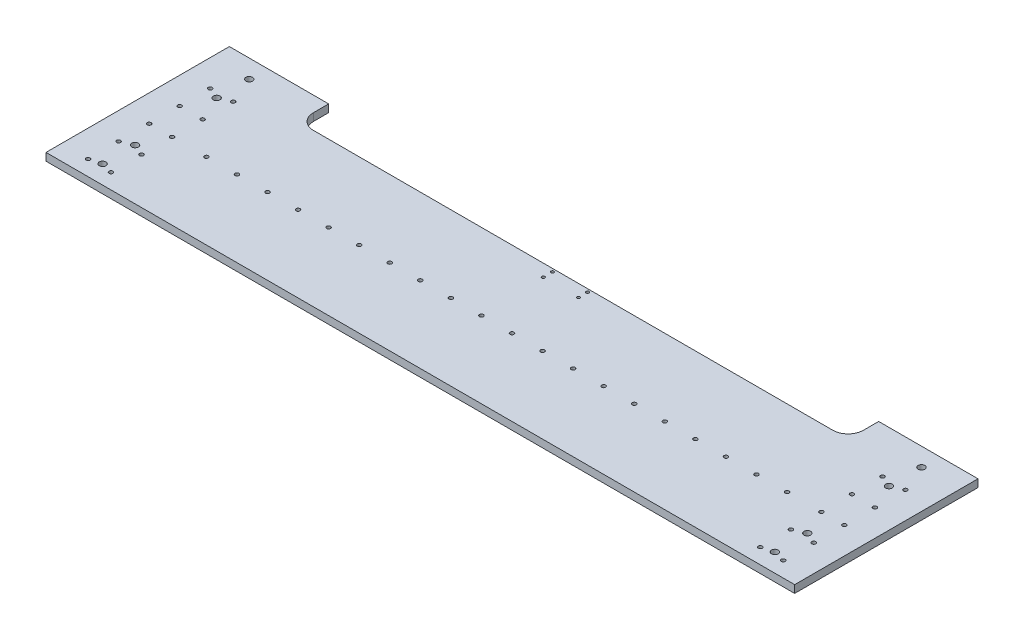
ISO-10303-21;
HEADER;
FILE_DESCRIPTION(('STEP AP214'),'2;1');
FILE_NAME('part.step','',(''),(''),'','','');
FILE_SCHEMA(('AUTOMOTIVE_DESIGN { 1 0 10303 214 1 1 1 1 }'));
ENDSEC;
DATA;
#1=APPLICATION_CONTEXT('core data for automotive mechanical design processes');
#2=APPLICATION_PROTOCOL_DEFINITION('international standard','automotive_design',2000,#1);
#3=PRODUCT_CONTEXT('',#1,'mechanical');
#4=PRODUCT('Part','Part','',(#3));
#5=PRODUCT_RELATED_PRODUCT_CATEGORY('part','',(#4));
#6=PRODUCT_DEFINITION_FORMATION('','',#4);
#7=PRODUCT_DEFINITION_CONTEXT('part definition',#1,'design');
#8=PRODUCT_DEFINITION('design','',#6,#7);
#9=PRODUCT_DEFINITION_SHAPE('','',#8);
#10=(LENGTH_UNIT() NAMED_UNIT(*) SI_UNIT(.MILLI.,.METRE.));
#11=(NAMED_UNIT(*) PLANE_ANGLE_UNIT() SI_UNIT($,.RADIAN.));
#12=(NAMED_UNIT(*) SI_UNIT($,.STERADIAN.) SOLID_ANGLE_UNIT());
#13=UNCERTAINTY_MEASURE_WITH_UNIT(LENGTH_MEASURE(1.E-05),#10,'distance_accuracy_value','');
#14=(GEOMETRIC_REPRESENTATION_CONTEXT(3) GLOBAL_UNCERTAINTY_ASSIGNED_CONTEXT((#13)) GLOBAL_UNIT_ASSIGNED_CONTEXT((#10,
#11,#12)) REPRESENTATION_CONTEXT('',''));
#15=CARTESIAN_POINT('',(0.,0.,0.));
#16=DIRECTION('',(0.,0.,1.));
#17=DIRECTION('',(1.,0.,0.));
#18=AXIS2_PLACEMENT_3D('',#15,#16,#17);
#19=CARTESIAN_POINT('',(0.,0.,0.));
#20=DIRECTION('',(0.,1.,0.));
#21=DIRECTION('',(0.,0.,1.));
#22=AXIS2_PLACEMENT_3D('',#19,#20,#21);
#23=PLANE('',#22);
#24=CARTESIAN_POINT('',(558.8,0.,-67.8942));
#25=DIRECTION('',(0.,-1.,0.));
#26=DIRECTION('',(0.,0.,-1.));
#27=AXIS2_PLACEMENT_3D('',#24,#25,#26);
#28=CIRCLE('',#27,5.55625000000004);
#29=CARTESIAN_POINT('',(558.8,0.,-73.4504500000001));
#30=VERTEX_POINT('',#29);
#31=EDGE_CURVE('E551',#30,#30,#28,.T.);
#32=ORIENTED_EDGE('',*,*,#31,.F.);
#33=EDGE_LOOP('',(#32));
#34=FACE_BOUND('',#33,.T.);
#35=CARTESIAN_POINT('',(558.8,0.,121.81205));
#36=DIRECTION('',(0.,-1.,0.));
#37=DIRECTION('',(0.,0.,-1.));
#38=AXIS2_PLACEMENT_3D('',#35,#36,#37);
#39=CIRCLE('',#38,5.55625000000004);
#40=CARTESIAN_POINT('',(558.8,0.,116.2558));
#41=VERTEX_POINT('',#40);
#42=EDGE_CURVE('E563',#41,#41,#39,.T.);
#43=ORIENTED_EDGE('',*,*,#42,.F.);
#44=EDGE_LOOP('',(#43));
#45=FACE_BOUND('',#44,.T.);
#46=CARTESIAN_POINT('',(-558.8,0.,-121.8692));
#47=DIRECTION('',(0.,-1.,0.));
#48=DIRECTION('',(0.,0.,-1.));
#49=AXIS2_PLACEMENT_3D('',#46,#47,#48);
#50=CIRCLE('',#49,5.55625000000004);
#51=CARTESIAN_POINT('',(-558.8,0.,-127.42545));
#52=VERTEX_POINT('',#51);
#53=EDGE_CURVE('E569',#52,#52,#50,.T.);
#54=ORIENTED_EDGE('',*,*,#53,.F.);
#55=EDGE_LOOP('',(#54));
#56=FACE_BOUND('',#55,.T.);
#57=CARTESIAN_POINT('',(-558.8,0.,-67.8942));
#58=DIRECTION('',(0.,-1.,0.));
#59=DIRECTION('',(0.,0.,-1.));
#60=AXIS2_PLACEMENT_3D('',#57,#58,#59);
#61=CIRCLE('',#60,5.55625000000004);
#62=CARTESIAN_POINT('',(-558.8,0.,-73.4504500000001));
#63=VERTEX_POINT('',#62);
#64=EDGE_CURVE('E575',#63,#63,#61,.T.);
#65=ORIENTED_EDGE('',*,*,#64,.F.);
#66=EDGE_LOOP('',(#65));
#67=FACE_BOUND('',#66,.T.);
#68=CARTESIAN_POINT('',(-558.8,0.,67.83705));
#69=DIRECTION('',(0.,-1.,0.));
#70=DIRECTION('',(0.,0.,-1.));
#71=AXIS2_PLACEMENT_3D('',#68,#69,#70);
#72=CIRCLE('',#71,5.55625000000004);
#73=CARTESIAN_POINT('',(-558.8,0.,62.2807999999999));
#74=VERTEX_POINT('',#73);
#75=EDGE_CURVE('E581',#74,#74,#72,.T.);
#76=ORIENTED_EDGE('',*,*,#75,.F.);
#77=EDGE_LOOP('',(#76));
#78=FACE_BOUND('',#77,.T.);
#79=CARTESIAN_POINT('',(-29.21,0.,-96.52));
#80=DIRECTION('',(0.,-1.,0.));
#81=DIRECTION('',(0.,0.,-1.));
#82=AXIS2_PLACEMENT_3D('',#79,#80,#81);
#83=CIRCLE('',#82,4.7625);
#84=CARTESIAN_POINT('',(-29.21,0.,-101.2825));
#85=VERTEX_POINT('',#84);
#86=EDGE_CURVE('E621',#85,#85,#83,.T.);
#87=ORIENTED_EDGE('',*,*,#86,.F.);
#88=EDGE_LOOP('',(#87));
#89=FACE_BOUND('',#88,.T.);
#90=CARTESIAN_POINT('',(-431.8,0.,25.4));
#91=DIRECTION('',(0.,-1.,0.));
#92=DIRECTION('',(0.,0.,-1.));
#93=AXIS2_PLACEMENT_3D('',#90,#91,#92);
#94=CIRCLE('',#93,5.55624999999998);
#95=CARTESIAN_POINT('',(-431.8,0.,19.84375));
#96=VERTEX_POINT('',#95);
#97=EDGE_CURVE('E633',#96,#96,#94,.T.);
#98=ORIENTED_EDGE('',*,*,#97,.F.);
#99=EDGE_LOOP('',(#98));
#100=FACE_BOUND('',#99,.T.);
#101=CARTESIAN_POINT('',(539.75,0.,127.));
#102=DIRECTION('',(0.,-1.,0.));
#103=DIRECTION('',(0.,0.,-1.));
#104=AXIS2_PLACEMENT_3D('',#101,#102,#103);
#105=CIRCLE('',#104,5.55625000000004);
#106=CARTESIAN_POINT('',(539.75,0.,121.44375));
#107=VERTEX_POINT('',#106);
#108=EDGE_CURVE('E657',#107,#107,#105,.T.);
#109=ORIENTED_EDGE('',*,*,#108,.F.);
#110=EDGE_LOOP('',(#109));
#111=FACE_BOUND('',#110,.T.);
#112=CARTESIAN_POINT('',(539.75,0.,25.4));
#113=DIRECTION('',(0.,-1.,0.));
#114=DIRECTION('',(0.,0.,-1.));
#115=AXIS2_PLACEMENT_3D('',#112,#113,#114);
#116=CIRCLE('',#115,5.55625000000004);
#117=CARTESIAN_POINT('',(539.75,0.,19.84375));
#118=VERTEX_POINT('',#117);
#119=EDGE_CURVE('E681',#118,#118,#116,.T.);
#120=ORIENTED_EDGE('',*,*,#119,.F.);
#121=EDGE_LOOP('',(#120));
#122=FACE_BOUND('',#121,.T.);
#123=CARTESIAN_POINT('',(577.85,0.,127.));
#124=DIRECTION('',(0.,-1.,0.));
#125=DIRECTION('',(0.,0.,-1.));
#126=AXIS2_PLACEMENT_3D('',#123,#124,#125);
#127=CIRCLE('',#126,5.55625000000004);
#128=CARTESIAN_POINT('',(577.85,0.,121.44375));
#129=VERTEX_POINT('',#128);
#130=EDGE_CURVE('E717',#129,#129,#127,.T.);
#131=ORIENTED_EDGE('',*,*,#130,.F.);
#132=EDGE_LOOP('',(#131));
#133=FACE_BOUND('',#132,.T.);
#134=CARTESIAN_POINT('',(-539.75,0.,127.));
#135=DIRECTION('',(0.,-1.,0.));
#136=DIRECTION('',(0.,0.,-1.));
#137=AXIS2_PLACEMENT_3D('',#134,#135,#136);
#138=CIRCLE('',#137,5.55625000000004);
#139=CARTESIAN_POINT('',(-539.75,0.,121.44375));
#140=VERTEX_POINT('',#139);
#141=EDGE_CURVE('E283',#140,#140,#138,.T.);
#142=ORIENTED_EDGE('',*,*,#141,.F.);
#143=EDGE_LOOP('',(#142));
#144=FACE_BOUND('',#143,.T.);
#145=CARTESIAN_POINT('',(-577.85,0.,127.));
#146=DIRECTION('',(0.,-1.,0.));
#147=DIRECTION('',(0.,0.,-1.));
#148=AXIS2_PLACEMENT_3D('',#145,#146,#147);
#149=CIRCLE('',#148,5.55625000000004);
#150=CARTESIAN_POINT('',(-577.85,0.,121.44375));
#151=VERTEX_POINT('',#150);
#152=EDGE_CURVE('E271',#151,#151,#149,.T.);
#153=ORIENTED_EDGE('',*,*,#152,.F.);
#154=EDGE_LOOP('',(#153));
#155=FACE_BOUND('',#154,.T.);
#156=CARTESIAN_POINT('',(-539.75,0.,76.2));
#157=DIRECTION('',(0.,-1.,0.));
#158=DIRECTION('',(0.,0.,-1.));
#159=AXIS2_PLACEMENT_3D('',#156,#157,#158);
#160=CIRCLE('',#159,5.55625000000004);
#161=CARTESIAN_POINT('',(-539.75,0.,70.6437499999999));
#162=VERTEX_POINT('',#161);
#163=EDGE_CURVE('E259',#162,#162,#160,.T.);
#164=ORIENTED_EDGE('',*,*,#163,.F.);
#165=EDGE_LOOP('',(#164));
#166=FACE_BOUND('',#165,.T.);
#167=CARTESIAN_POINT('',(-577.85,0.,76.2));
#168=DIRECTION('',(0.,-1.,0.));
#169=DIRECTION('',(0.,0.,-1.));
#170=AXIS2_PLACEMENT_3D('',#167,#168,#169);
#171=CIRCLE('',#170,5.55625000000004);
#172=CARTESIAN_POINT('',(-577.85,0.,70.6437499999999));
#173=VERTEX_POINT('',#172);
#174=EDGE_CURVE('E247',#173,#173,#171,.T.);
#175=ORIENTED_EDGE('',*,*,#174,.F.);
#176=EDGE_LOOP('',(#175));
#177=FACE_BOUND('',#176,.T.);
#178=CARTESIAN_POINT('',(-539.75,0.,25.4));
#179=DIRECTION('',(0.,-1.,0.));
#180=DIRECTION('',(0.,0.,-1.));
#181=AXIS2_PLACEMENT_3D('',#178,#179,#180);
#182=CIRCLE('',#181,5.55625000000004);
#183=CARTESIAN_POINT('',(-539.75,0.,19.84375));
#184=VERTEX_POINT('',#183);
#185=EDGE_CURVE('E235',#184,#184,#182,.T.);
#186=ORIENTED_EDGE('',*,*,#185,.F.);
#187=EDGE_LOOP('',(#186));
#188=FACE_BOUND('',#187,.T.);
#189=CARTESIAN_POINT('',(-577.85,0.,25.4));
#190=DIRECTION('',(0.,-1.,0.));
#191=DIRECTION('',(0.,0.,-1.));
#192=AXIS2_PLACEMENT_3D('',#189,#190,#191);
#193=CIRCLE('',#192,5.55625000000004);
#194=CARTESIAN_POINT('',(-577.85,0.,19.84375));
#195=VERTEX_POINT('',#194);
#196=EDGE_CURVE('E223',#195,#195,#193,.T.);
#197=ORIENTED_EDGE('',*,*,#196,.F.);
#198=EDGE_LOOP('',(#197));
#199=FACE_BOUND('',#198,.T.);
#200=CARTESIAN_POINT('',(-539.75,0.,-25.4));
#201=DIRECTION('',(0.,-1.,0.));
#202=DIRECTION('',(0.,0.,-1.));
#203=AXIS2_PLACEMENT_3D('',#200,#201,#202);
#204=CIRCLE('',#203,5.55625000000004);
#205=CARTESIAN_POINT('',(-539.75,0.,-30.95625));
#206=VERTEX_POINT('',#205);
#207=EDGE_CURVE('E211',#206,#206,#204,.T.);
#208=ORIENTED_EDGE('',*,*,#207,.F.);
#209=EDGE_LOOP('',(#208));
#210=FACE_BOUND('',#209,.T.);
#211=CARTESIAN_POINT('',(-577.85,0.,-25.4));
#212=DIRECTION('',(0.,-1.,0.));
#213=DIRECTION('',(0.,0.,-1.));
#214=AXIS2_PLACEMENT_3D('',#211,#212,#213);
#215=CIRCLE('',#214,5.55625000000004);
#216=CARTESIAN_POINT('',(-577.85,0.,-30.95625));
#217=VERTEX_POINT('',#216);
#218=EDGE_CURVE('E199',#217,#217,#215,.T.);
#219=ORIENTED_EDGE('',*,*,#218,.F.);
#220=EDGE_LOOP('',(#219));
#221=FACE_BOUND('',#220,.T.);
#222=DIRECTION('',(-1.,0.,0.));
#223=VECTOR('',#222,1.);
#224=CARTESIAN_POINT('',(-622.3,0.,-152.4));
#225=LINE('',#224,#223);
#226=CARTESIAN_POINT('',(-457.2,0.,-152.4));
#227=VERTEX_POINT('',#226);
#228=CARTESIAN_POINT('',(-622.3,0.,-152.4));
#229=VERTEX_POINT('',#228);
#230=EDGE_CURVE('E142',#227,#229,#225,.T.);
#231=ORIENTED_EDGE('',*,*,#230,.F.);
#232=DIRECTION('',(0.,0.,1.));
#233=VECTOR('',#232,1.);
#234=CARTESIAN_POINT('',(-457.2,0.,-152.4));
#235=LINE('',#234,#233);
#236=CARTESIAN_POINT('',(-457.2,0.,-127.));
#237=VERTEX_POINT('',#236);
#238=EDGE_CURVE('E124',#227,#237,#235,.T.);
#239=ORIENTED_EDGE('',*,*,#238,.T.);
#240=CARTESIAN_POINT('',(-431.8,0.,-127.));
#241=DIRECTION('',(0.,1.,0.));
#242=DIRECTION('',(0.,0.,1.));
#243=AXIS2_PLACEMENT_3D('',#240,#241,#242);
#244=CIRCLE('',#243,25.4);
#245=CARTESIAN_POINT('',(-431.8,0.,-101.6));
#246=VERTEX_POINT('',#245);
#247=EDGE_CURVE('E135',#237,#246,#244,.T.);
#248=ORIENTED_EDGE('',*,*,#247,.T.);
#249=DIRECTION('',(1.,0.,0.));
#250=VECTOR('',#249,1.);
#251=CARTESIAN_POINT('',(-431.8,0.,-101.6));
#252=LINE('',#251,#250);
#253=CARTESIAN_POINT('',(431.8,0.,-101.6));
#254=VERTEX_POINT('',#253);
#255=EDGE_CURVE('E48',#246,#254,#252,.T.);
#256=ORIENTED_EDGE('',*,*,#255,.T.);
#257=CARTESIAN_POINT('',(431.8,0.,-127.));
#258=DIRECTION('',(0.,1.,0.));
#259=DIRECTION('',(0.,0.,1.));
#260=AXIS2_PLACEMENT_3D('',#257,#258,#259);
#261=CIRCLE('',#260,25.4);
#262=CARTESIAN_POINT('',(457.2,0.,-127.));
#263=VERTEX_POINT('',#262);
#264=EDGE_CURVE('E152',#254,#263,#261,.T.);
#265=ORIENTED_EDGE('',*,*,#264,.T.);
#266=DIRECTION('',(0.,0.,-1.));
#267=VECTOR('',#266,1.);
#268=CARTESIAN_POINT('',(457.2,0.,-152.4));
#269=LINE('',#268,#267);
#270=CARTESIAN_POINT('',(457.2,0.,-152.4));
#271=VERTEX_POINT('',#270);
#272=EDGE_CURVE('E132',#263,#271,#269,.T.);
#273=ORIENTED_EDGE('',*,*,#272,.T.);
#274=CARTESIAN_POINT('',(622.3,0.,-152.4));
#275=VERTEX_POINT('',#274);
#276=EDGE_CURVE('E185',#275,#271,#225,.T.);
#277=ORIENTED_EDGE('',*,*,#276,.F.);
#278=DIRECTION('',(0.,0.,-1.));
#279=VECTOR('',#278,1.);
#280=CARTESIAN_POINT('',(622.3,0.,-152.4));
#281=LINE('',#280,#279);
#282=CARTESIAN_POINT('',(622.3,0.,152.4));
#283=VERTEX_POINT('',#282);
#284=EDGE_CURVE('E167',#283,#275,#281,.T.);
#285=ORIENTED_EDGE('',*,*,#284,.F.);
#286=DIRECTION('',(1.,0.,0.));
#287=VECTOR('',#286,1.);
#288=CARTESIAN_POINT('',(-622.3,0.,152.4));
#289=LINE('',#288,#287);
#290=CARTESIAN_POINT('',(-622.3,0.,152.4));
#291=VERTEX_POINT('',#290);
#292=EDGE_CURVE('E78',#291,#283,#289,.T.);
#293=ORIENTED_EDGE('',*,*,#292,.F.);
#294=DIRECTION('',(0.,0.,1.));
#295=VECTOR('',#294,1.);
#296=CARTESIAN_POINT('',(-622.3,0.,-152.4));
#297=LINE('',#296,#295);
#298=EDGE_CURVE('E188',#229,#291,#297,.T.);
#299=ORIENTED_EDGE('',*,*,#298,.F.);
#300=EDGE_LOOP('',(#231,#239,#248,#256,#265,#273,#277,#285,#293,#299));
#301=FACE_BOUND('',#300,.T.);
#302=CARTESIAN_POINT('',(-577.85,0.,-76.2));
#303=DIRECTION('',(0.,-1.,0.));
#304=DIRECTION('',(0.,0.,-1.));
#305=AXIS2_PLACEMENT_3D('',#302,#303,#304);
#306=CIRCLE('',#305,5.55625000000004);
#307=CARTESIAN_POINT('',(-577.85,0.,-81.7562500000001));
#308=VERTEX_POINT('',#307);
#309=EDGE_CURVE('E789',#308,#308,#306,.T.);
#310=ORIENTED_EDGE('',*,*,#309,.F.);
#311=EDGE_LOOP('',(#310));
#312=FACE_BOUND('',#311,.T.);
#313=CARTESIAN_POINT('',(-539.75,0.,-76.2));
#314=DIRECTION('',(0.,-1.,0.));
#315=DIRECTION('',(0.,0.,-1.));
#316=AXIS2_PLACEMENT_3D('',#313,#314,#315);
#317=CIRCLE('',#316,5.55625000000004);
#318=CARTESIAN_POINT('',(-539.75,0.,-81.7562500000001));
#319=VERTEX_POINT('',#318);
#320=EDGE_CURVE('E777',#319,#319,#317,.T.);
#321=ORIENTED_EDGE('',*,*,#320,.F.);
#322=EDGE_LOOP('',(#321));
#323=FACE_BOUND('',#322,.T.);
#324=CARTESIAN_POINT('',(577.85,0.,-76.2));
#325=DIRECTION('',(0.,-1.,0.));
#326=DIRECTION('',(0.,0.,-1.));
#327=AXIS2_PLACEMENT_3D('',#324,#325,#326);
#328=CIRCLE('',#327,5.55625000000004);
#329=CARTESIAN_POINT('',(577.85,0.,-81.7562500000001));
#330=VERTEX_POINT('',#329);
#331=EDGE_CURVE('E765',#330,#330,#328,.T.);
#332=ORIENTED_EDGE('',*,*,#331,.F.);
#333=EDGE_LOOP('',(#332));
#334=FACE_BOUND('',#333,.T.);
#335=CARTESIAN_POINT('',(577.85,0.,-25.4));
#336=DIRECTION('',(0.,-1.,0.));
#337=DIRECTION('',(0.,0.,-1.));
#338=AXIS2_PLACEMENT_3D('',#335,#336,#337);
#339=CIRCLE('',#338,5.55625000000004);
#340=CARTESIAN_POINT('',(577.85,0.,-30.95625));
#341=VERTEX_POINT('',#340);
#342=EDGE_CURVE('E753',#341,#341,#339,.T.);
#343=ORIENTED_EDGE('',*,*,#342,.F.);
#344=EDGE_LOOP('',(#343));
#345=FACE_BOUND('',#344,.T.);
#346=CARTESIAN_POINT('',(577.85,0.,25.4));
#347=DIRECTION('',(0.,-1.,0.));
#348=DIRECTION('',(0.,0.,-1.));
#349=AXIS2_PLACEMENT_3D('',#346,#347,#348);
#350=CIRCLE('',#349,5.55625000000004);
#351=CARTESIAN_POINT('',(577.85,0.,19.84375));
#352=VERTEX_POINT('',#351);
#353=EDGE_CURVE('E741',#352,#352,#350,.T.);
#354=ORIENTED_EDGE('',*,*,#353,.F.);
#355=EDGE_LOOP('',(#354));
#356=FACE_BOUND('',#355,.T.);
#357=CARTESIAN_POINT('',(577.85,0.,76.2));
#358=DIRECTION('',(0.,-1.,0.));
#359=DIRECTION('',(0.,0.,-1.));
#360=AXIS2_PLACEMENT_3D('',#357,#358,#359);
#361=CIRCLE('',#360,5.55625000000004);
#362=CARTESIAN_POINT('',(577.85,0.,70.6437499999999));
#363=VERTEX_POINT('',#362);
#364=EDGE_CURVE('E729',#363,#363,#361,.T.);
#365=ORIENTED_EDGE('',*,*,#364,.F.);
#366=EDGE_LOOP('',(#365));
#367=FACE_BOUND('',#366,.T.);
#368=CARTESIAN_POINT('',(539.75,0.,-76.2));
#369=DIRECTION('',(0.,-1.,0.));
#370=DIRECTION('',(0.,0.,-1.));
#371=AXIS2_PLACEMENT_3D('',#368,#369,#370);
#372=CIRCLE('',#371,5.55625000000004);
#373=CARTESIAN_POINT('',(539.75,0.,-81.7562500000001));
#374=VERTEX_POINT('',#373);
#375=EDGE_CURVE('E705',#374,#374,#372,.T.);
#376=ORIENTED_EDGE('',*,*,#375,.F.);
#377=EDGE_LOOP('',(#376));
#378=FACE_BOUND('',#377,.T.);
#379=CARTESIAN_POINT('',(539.75,0.,-25.4));
#380=DIRECTION('',(0.,-1.,0.));
#381=DIRECTION('',(0.,0.,-1.));
#382=AXIS2_PLACEMENT_3D('',#379,#380,#381);
#383=CIRCLE('',#382,5.55625000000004);
#384=CARTESIAN_POINT('',(539.75,0.,-30.95625));
#385=VERTEX_POINT('',#384);
#386=EDGE_CURVE('E693',#385,#385,#383,.T.);
#387=ORIENTED_EDGE('',*,*,#386,.F.);
#388=EDGE_LOOP('',(#387));
#389=FACE_BOUND('',#388,.T.);
#390=CARTESIAN_POINT('',(539.75,0.,76.2));
#391=DIRECTION('',(0.,-1.,0.));
#392=DIRECTION('',(0.,0.,-1.));
#393=AXIS2_PLACEMENT_3D('',#390,#391,#392);
#394=CIRCLE('',#393,5.55625000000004);
#395=CARTESIAN_POINT('',(539.75,0.,70.6437499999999));
#396=VERTEX_POINT('',#395);
#397=EDGE_CURVE('E669',#396,#396,#394,.T.);
#398=ORIENTED_EDGE('',*,*,#397,.F.);
#399=EDGE_LOOP('',(#398));
#400=FACE_BOUND('',#399,.T.);
#401=CARTESIAN_POINT('',(-482.6,0.,25.4));
#402=DIRECTION('',(0.,-1.,0.));
#403=DIRECTION('',(0.,0.,-1.));
#404=AXIS2_PLACEMENT_3D('',#401,#402,#403);
#405=CIRCLE('',#404,5.55624999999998);
#406=CARTESIAN_POINT('',(-482.6,0.,19.84375));
#407=VERTEX_POINT('',#406);
#408=EDGE_CURVE('E645',#407,#407,#405,.T.);
#409=ORIENTED_EDGE('',*,*,#408,.F.);
#410=EDGE_LOOP('',(#409));
#411=FACE_BOUND('',#410,.T.);
#412=CARTESIAN_POINT('',(-381.,0.,25.4));
#413=DIRECTION('',(0.,-1.,0.));
#414=DIRECTION('',(0.,0.,-1.));
#415=AXIS2_PLACEMENT_3D('',#412,#413,#414);
#416=CIRCLE('',#415,5.55624999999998);
#417=CARTESIAN_POINT('',(-381.,0.,19.84375));
#418=VERTEX_POINT('',#417);
#419=EDGE_CURVE('E295',#418,#418,#416,.T.);
#420=ORIENTED_EDGE('',*,*,#419,.F.);
#421=EDGE_LOOP('',(#420));
#422=FACE_BOUND('',#421,.T.);
#423=CARTESIAN_POINT('',(-330.2,0.,25.4));
#424=DIRECTION('',(0.,-1.,0.));
#425=DIRECTION('',(0.,0.,-1.));
#426=AXIS2_PLACEMENT_3D('',#423,#424,#425);
#427=CIRCLE('',#426,5.55624999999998);
#428=CARTESIAN_POINT('',(-330.2,0.,19.84375));
#429=VERTEX_POINT('',#428);
#430=EDGE_CURVE('E307',#429,#429,#427,.T.);
#431=ORIENTED_EDGE('',*,*,#430,.F.);
#432=EDGE_LOOP('',(#431));
#433=FACE_BOUND('',#432,.T.);
#434=CARTESIAN_POINT('',(-279.4,0.,25.4));
#435=DIRECTION('',(0.,-1.,0.));
#436=DIRECTION('',(0.,0.,-1.));
#437=AXIS2_PLACEMENT_3D('',#434,#435,#436);
#438=CIRCLE('',#437,5.55624999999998);
#439=CARTESIAN_POINT('',(-279.4,0.,19.84375));
#440=VERTEX_POINT('',#439);
#441=EDGE_CURVE('E319',#440,#440,#438,.T.);
#442=ORIENTED_EDGE('',*,*,#441,.F.);
#443=EDGE_LOOP('',(#442));
#444=FACE_BOUND('',#443,.T.);
#445=CARTESIAN_POINT('',(-228.6,0.,25.4));
#446=DIRECTION('',(0.,-1.,0.));
#447=DIRECTION('',(0.,0.,-1.));
#448=AXIS2_PLACEMENT_3D('',#445,#446,#447);
#449=CIRCLE('',#448,5.55624999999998);
#450=CARTESIAN_POINT('',(-228.6,0.,19.84375));
#451=VERTEX_POINT('',#450);
#452=EDGE_CURVE('E331',#451,#451,#449,.T.);
#453=ORIENTED_EDGE('',*,*,#452,.F.);
#454=EDGE_LOOP('',(#453));
#455=FACE_BOUND('',#454,.T.);
#456=CARTESIAN_POINT('',(-177.8,0.,25.4));
#457=DIRECTION('',(0.,-1.,0.));
#458=DIRECTION('',(0.,0.,-1.));
#459=AXIS2_PLACEMENT_3D('',#456,#457,#458);
#460=CIRCLE('',#459,5.55624999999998);
#461=CARTESIAN_POINT('',(-177.8,0.,19.84375));
#462=VERTEX_POINT('',#461);
#463=EDGE_CURVE('E343',#462,#462,#460,.T.);
#464=ORIENTED_EDGE('',*,*,#463,.F.);
#465=EDGE_LOOP('',(#464));
#466=FACE_BOUND('',#465,.T.);
#467=CARTESIAN_POINT('',(-127.,0.,25.4));
#468=DIRECTION('',(0.,-1.,0.));
#469=DIRECTION('',(0.,0.,-1.));
#470=AXIS2_PLACEMENT_3D('',#467,#468,#469);
#471=CIRCLE('',#470,5.55624999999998);
#472=CARTESIAN_POINT('',(-127.,0.,19.84375));
#473=VERTEX_POINT('',#472);
#474=EDGE_CURVE('E355',#473,#473,#471,.T.);
#475=ORIENTED_EDGE('',*,*,#474,.F.);
#476=EDGE_LOOP('',(#475));
#477=FACE_BOUND('',#476,.T.);
#478=CARTESIAN_POINT('',(-76.2000000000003,0.,25.4));
#479=DIRECTION('',(0.,-1.,0.));
#480=DIRECTION('',(0.,0.,-1.));
#481=AXIS2_PLACEMENT_3D('',#478,#479,#480);
#482=CIRCLE('',#481,5.55624999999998);
#483=CARTESIAN_POINT('',(-76.2000000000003,0.,19.84375));
#484=VERTEX_POINT('',#483);
#485=EDGE_CURVE('E367',#484,#484,#482,.T.);
#486=ORIENTED_EDGE('',*,*,#485,.F.);
#487=EDGE_LOOP('',(#486));
#488=FACE_BOUND('',#487,.T.);
#489=CARTESIAN_POINT('',(-25.4000000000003,0.,25.4));
#490=DIRECTION('',(0.,-1.,0.));
#491=DIRECTION('',(0.,0.,-1.));
#492=AXIS2_PLACEMENT_3D('',#489,#490,#491);
#493=CIRCLE('',#492,5.55624999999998);
#494=CARTESIAN_POINT('',(-25.4000000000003,0.,19.84375));
#495=VERTEX_POINT('',#494);
#496=EDGE_CURVE('E379',#495,#495,#493,.T.);
#497=ORIENTED_EDGE('',*,*,#496,.F.);
#498=EDGE_LOOP('',(#497));
#499=FACE_BOUND('',#498,.T.);
#500=CARTESIAN_POINT('',(25.3999999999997,0.,25.4));
#501=DIRECTION('',(0.,-1.,0.));
#502=DIRECTION('',(0.,0.,-1.));
#503=AXIS2_PLACEMENT_3D('',#500,#501,#502);
#504=CIRCLE('',#503,5.55624999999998);
#505=CARTESIAN_POINT('',(25.3999999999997,0.,19.84375));
#506=VERTEX_POINT('',#505);
#507=EDGE_CURVE('E391',#506,#506,#504,.T.);
#508=ORIENTED_EDGE('',*,*,#507,.F.);
#509=EDGE_LOOP('',(#508));
#510=FACE_BOUND('',#509,.T.);
#511=CARTESIAN_POINT('',(76.1999999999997,0.,25.4));
#512=DIRECTION('',(0.,-1.,0.));
#513=DIRECTION('',(0.,0.,-1.));
#514=AXIS2_PLACEMENT_3D('',#511,#512,#513);
#515=CIRCLE('',#514,5.55624999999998);
#516=CARTESIAN_POINT('',(76.1999999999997,0.,19.84375));
#517=VERTEX_POINT('',#516);
#518=EDGE_CURVE('E403',#517,#517,#515,.T.);
#519=ORIENTED_EDGE('',*,*,#518,.F.);
#520=EDGE_LOOP('',(#519));
#521=FACE_BOUND('',#520,.T.);
#522=CARTESIAN_POINT('',(127.,0.,25.4));
#523=DIRECTION('',(0.,-1.,0.));
#524=DIRECTION('',(0.,0.,-1.));
#525=AXIS2_PLACEMENT_3D('',#522,#523,#524);
#526=CIRCLE('',#525,5.55624999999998);
#527=CARTESIAN_POINT('',(127.,0.,19.84375));
#528=VERTEX_POINT('',#527);
#529=EDGE_CURVE('E415',#528,#528,#526,.T.);
#530=ORIENTED_EDGE('',*,*,#529,.F.);
#531=EDGE_LOOP('',(#530));
#532=FACE_BOUND('',#531,.T.);
#533=CARTESIAN_POINT('',(177.8,0.,25.4));
#534=DIRECTION('',(0.,-1.,0.));
#535=DIRECTION('',(0.,0.,-1.));
#536=AXIS2_PLACEMENT_3D('',#533,#534,#535);
#537=CIRCLE('',#536,5.55624999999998);
#538=CARTESIAN_POINT('',(177.8,0.,19.84375));
#539=VERTEX_POINT('',#538);
#540=EDGE_CURVE('E427',#539,#539,#537,.T.);
#541=ORIENTED_EDGE('',*,*,#540,.F.);
#542=EDGE_LOOP('',(#541));
#543=FACE_BOUND('',#542,.T.);
#544=CARTESIAN_POINT('',(228.6,0.,25.4));
#545=DIRECTION('',(0.,-1.,0.));
#546=DIRECTION('',(0.,0.,-1.));
#547=AXIS2_PLACEMENT_3D('',#544,#545,#546);
#548=CIRCLE('',#547,5.55624999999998);
#549=CARTESIAN_POINT('',(228.6,0.,19.84375));
#550=VERTEX_POINT('',#549);
#551=EDGE_CURVE('E439',#550,#550,#548,.T.);
#552=ORIENTED_EDGE('',*,*,#551,.F.);
#553=EDGE_LOOP('',(#552));
#554=FACE_BOUND('',#553,.T.);
#555=CARTESIAN_POINT('',(279.4,0.,25.4));
#556=DIRECTION('',(0.,-1.,0.));
#557=DIRECTION('',(0.,0.,-1.));
#558=AXIS2_PLACEMENT_3D('',#555,#556,#557);
#559=CIRCLE('',#558,5.55624999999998);
#560=CARTESIAN_POINT('',(279.4,0.,19.84375));
#561=VERTEX_POINT('',#560);
#562=EDGE_CURVE('E451',#561,#561,#559,.T.);
#563=ORIENTED_EDGE('',*,*,#562,.F.);
#564=EDGE_LOOP('',(#563));
#565=FACE_BOUND('',#564,.T.);
#566=CARTESIAN_POINT('',(330.2,0.,25.4));
#567=DIRECTION('',(0.,-1.,0.));
#568=DIRECTION('',(0.,0.,-1.));
#569=AXIS2_PLACEMENT_3D('',#566,#567,#568);
#570=CIRCLE('',#569,5.55624999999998);
#571=CARTESIAN_POINT('',(330.2,0.,19.84375));
#572=VERTEX_POINT('',#571);
#573=EDGE_CURVE('E463',#572,#572,#570,.T.);
#574=ORIENTED_EDGE('',*,*,#573,.F.);
#575=EDGE_LOOP('',(#574));
#576=FACE_BOUND('',#575,.T.);
#577=CARTESIAN_POINT('',(381.,0.,25.4));
#578=DIRECTION('',(0.,-1.,0.));
#579=DIRECTION('',(0.,0.,-1.));
#580=AXIS2_PLACEMENT_3D('',#577,#578,#579);
#581=CIRCLE('',#580,5.55624999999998);
#582=CARTESIAN_POINT('',(381.,0.,19.84375));
#583=VERTEX_POINT('',#582);
#584=EDGE_CURVE('E475',#583,#583,#581,.T.);
#585=ORIENTED_EDGE('',*,*,#584,.F.);
#586=EDGE_LOOP('',(#585));
#587=FACE_BOUND('',#586,.T.);
#588=CARTESIAN_POINT('',(431.8,0.,25.4));
#589=DIRECTION('',(0.,-1.,0.));
#590=DIRECTION('',(0.,0.,-1.));
#591=AXIS2_PLACEMENT_3D('',#588,#589,#590);
#592=CIRCLE('',#591,5.55624999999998);
#593=CARTESIAN_POINT('',(431.8,0.,19.84375));
#594=VERTEX_POINT('',#593);
#595=EDGE_CURVE('E487',#594,#594,#592,.T.);
#596=ORIENTED_EDGE('',*,*,#595,.F.);
#597=EDGE_LOOP('',(#596));
#598=FACE_BOUND('',#597,.T.);
#599=CARTESIAN_POINT('',(482.6,0.,25.4));
#600=DIRECTION('',(0.,-1.,0.));
#601=DIRECTION('',(0.,0.,-1.));
#602=AXIS2_PLACEMENT_3D('',#599,#600,#601);
#603=CIRCLE('',#602,5.55624999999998);
#604=CARTESIAN_POINT('',(482.6,0.,19.84375));
#605=VERTEX_POINT('',#604);
#606=EDGE_CURVE('E499',#605,#605,#603,.T.);
#607=ORIENTED_EDGE('',*,*,#606,.F.);
#608=EDGE_LOOP('',(#607));
#609=FACE_BOUND('',#608,.T.);
#610=CARTESIAN_POINT('',(29.21,0.,-96.52));
#611=DIRECTION('',(0.,-1.,0.));
#612=DIRECTION('',(0.,0.,-1.));
#613=AXIS2_PLACEMENT_3D('',#610,#611,#612);
#614=CIRCLE('',#613,4.7625);
#615=CARTESIAN_POINT('',(29.21,0.,-101.2825));
#616=VERTEX_POINT('',#615);
#617=EDGE_CURVE('E527',#616,#616,#614,.T.);
#618=ORIENTED_EDGE('',*,*,#617,.F.);
#619=EDGE_LOOP('',(#618));
#620=FACE_BOUND('',#619,.T.);
#621=CARTESIAN_POINT('',(29.21,0.,-81.28));
#622=DIRECTION('',(0.,-1.,0.));
#623=DIRECTION('',(0.,0.,-1.));
#624=AXIS2_PLACEMENT_3D('',#621,#622,#623);
#625=CIRCLE('',#624,4.7625);
#626=CARTESIAN_POINT('',(29.21,0.,-86.0425));
#627=VERTEX_POINT('',#626);
#628=EDGE_CURVE('E531',#627,#627,#625,.T.);
#629=ORIENTED_EDGE('',*,*,#628,.F.);
#630=EDGE_LOOP('',(#629));
#631=FACE_BOUND('',#630,.T.);
#632=CARTESIAN_POINT('',(-29.21,0.,-81.28));
#633=DIRECTION('',(0.,-1.,0.));
#634=DIRECTION('',(0.,0.,-1.));
#635=AXIS2_PLACEMENT_3D('',#632,#633,#634);
#636=CIRCLE('',#635,4.7625);
#637=CARTESIAN_POINT('',(-29.21,0.,-86.0425));
#638=VERTEX_POINT('',#637);
#639=EDGE_CURVE('E535',#638,#638,#636,.T.);
#640=ORIENTED_EDGE('',*,*,#639,.F.);
#641=EDGE_LOOP('',(#640));
#642=FACE_BOUND('',#641,.T.);
#643=CARTESIAN_POINT('',(-558.8,0.,121.81205));
#644=DIRECTION('',(0.,-1.,0.));
#645=DIRECTION('',(0.,0.,-1.));
#646=AXIS2_PLACEMENT_3D('',#643,#644,#645);
#647=CIRCLE('',#646,5.55625000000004);
#648=CARTESIAN_POINT('',(-558.8,0.,116.2558));
#649=VERTEX_POINT('',#648);
#650=EDGE_CURVE('E539',#649,#649,#647,.T.);
#651=ORIENTED_EDGE('',*,*,#650,.F.);
#652=EDGE_LOOP('',(#651));
#653=FACE_BOUND('',#652,.T.);
#654=CARTESIAN_POINT('',(558.8,0.,67.83705));
#655=DIRECTION('',(0.,-1.,0.));
#656=DIRECTION('',(0.,0.,-1.));
#657=AXIS2_PLACEMENT_3D('',#654,#655,#656);
#658=CIRCLE('',#657,5.55625000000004);
#659=CARTESIAN_POINT('',(558.8,0.,62.2807999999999));
#660=VERTEX_POINT('',#659);
#661=EDGE_CURVE('E543',#660,#660,#658,.T.);
#662=ORIENTED_EDGE('',*,*,#661,.F.);
#663=EDGE_LOOP('',(#662));
#664=FACE_BOUND('',#663,.T.);
#665=CARTESIAN_POINT('',(558.8,0.,-121.8692));
#666=DIRECTION('',(0.,-1.,0.));
#667=DIRECTION('',(0.,0.,-1.));
#668=AXIS2_PLACEMENT_3D('',#665,#666,#667);
#669=CIRCLE('',#668,5.55625000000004);
#670=CARTESIAN_POINT('',(558.8,0.,-127.42545));
#671=VERTEX_POINT('',#670);
#672=EDGE_CURVE('E546',#671,#671,#669,.T.);
#673=ORIENTED_EDGE('',*,*,#672,.F.);
#674=EDGE_LOOP('',(#673));
#675=FACE_BOUND('',#674,.T.);
#676=ADVANCED_FACE('F33',(#34,#45,#56,#67,#78,#89,#100,#111,#122,#133,#144,#155,#166,#177,#188,
#199,#210,#221,#301,#312,#323,#334,#345,#356,#367,#378,#389,#400,#411,#422,#433,#444,#455,#466,
#477,#488,#499,#510,#521,#532,#543,#554,#565,#576,#587,#598,#609,#620,#631,#642,#653,#664,#675),
#23,.F.);
#677=CARTESIAN_POINT('',(0.,12.7,0.));
#678=DIRECTION('',(0.,1.,0.));
#679=DIRECTION('',(0.,0.,1.));
#680=AXIS2_PLACEMENT_3D('',#677,#678,#679);
#681=PLANE('',#680);
#682=CARTESIAN_POINT('',(558.8,12.7,-67.8942));
#683=DIRECTION('',(0.,-1.,0.));
#684=DIRECTION('',(0.,0.,-1.));
#685=AXIS2_PLACEMENT_3D('',#682,#683,#684);
#686=CIRCLE('',#685,5.55625000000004);
#687=CARTESIAN_POINT('',(558.8,12.7,-73.4504500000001));
#688=VERTEX_POINT('',#687);
#689=EDGE_CURVE('E556',#688,#688,#686,.T.);
#690=ORIENTED_EDGE('',*,*,#689,.T.);
#691=EDGE_LOOP('',(#690));
#692=FACE_BOUND('',#691,.T.);
#693=CARTESIAN_POINT('',(558.8,12.7,121.81205));
#694=DIRECTION('',(0.,-1.,0.));
#695=DIRECTION('',(0.,0.,-1.));
#696=AXIS2_PLACEMENT_3D('',#693,#694,#695);
#697=CIRCLE('',#696,5.55625000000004);
#698=CARTESIAN_POINT('',(558.8,12.7,116.2558));
#699=VERTEX_POINT('',#698);
#700=EDGE_CURVE('E566',#699,#699,#697,.T.);
#701=ORIENTED_EDGE('',*,*,#700,.T.);
#702=EDGE_LOOP('',(#701));
#703=FACE_BOUND('',#702,.T.);
#704=CARTESIAN_POINT('',(-558.8,12.7,-121.8692));
#705=DIRECTION('',(0.,-1.,0.));
#706=DIRECTION('',(0.,0.,-1.));
#707=AXIS2_PLACEMENT_3D('',#704,#705,#706);
#708=CIRCLE('',#707,5.55625000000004);
#709=CARTESIAN_POINT('',(-558.8,12.7,-127.42545));
#710=VERTEX_POINT('',#709);
#711=EDGE_CURVE('E572',#710,#710,#708,.T.);
#712=ORIENTED_EDGE('',*,*,#711,.T.);
#713=EDGE_LOOP('',(#712));
#714=FACE_BOUND('',#713,.T.);
#715=CARTESIAN_POINT('',(-558.8,12.7,-67.8942));
#716=DIRECTION('',(0.,-1.,0.));
#717=DIRECTION('',(0.,0.,-1.));
#718=AXIS2_PLACEMENT_3D('',#715,#716,#717);
#719=CIRCLE('',#718,5.55625000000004);
#720=CARTESIAN_POINT('',(-558.8,12.7,-73.4504500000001));
#721=VERTEX_POINT('',#720);
#722=EDGE_CURVE('E578',#721,#721,#719,.T.);
#723=ORIENTED_EDGE('',*,*,#722,.T.);
#724=EDGE_LOOP('',(#723));
#725=FACE_BOUND('',#724,.T.);
#726=CARTESIAN_POINT('',(-558.8,12.7,67.83705));
#727=DIRECTION('',(0.,-1.,0.));
#728=DIRECTION('',(0.,0.,-1.));
#729=AXIS2_PLACEMENT_3D('',#726,#727,#728);
#730=CIRCLE('',#729,5.55625000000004);
#731=CARTESIAN_POINT('',(-558.8,12.7,62.2807999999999));
#732=VERTEX_POINT('',#731);
#733=EDGE_CURVE('E584',#732,#732,#730,.T.);
#734=ORIENTED_EDGE('',*,*,#733,.T.);
#735=EDGE_LOOP('',(#734));
#736=FACE_BOUND('',#735,.T.);
#737=CARTESIAN_POINT('',(-558.8,12.7,121.81205));
#738=DIRECTION('',(0.,-1.,0.));
#739=DIRECTION('',(0.,0.,-1.));
#740=AXIS2_PLACEMENT_3D('',#737,#738,#739);
#741=CIRCLE('',#740,5.55625000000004);
#742=CARTESIAN_POINT('',(-558.8,12.7,116.2558));
#743=VERTEX_POINT('',#742);
#744=EDGE_CURVE('E588',#743,#743,#741,.T.);
#745=ORIENTED_EDGE('',*,*,#744,.T.);
#746=EDGE_LOOP('',(#745));
#747=FACE_BOUND('',#746,.T.);
#748=CARTESIAN_POINT('',(-29.21,12.7,-81.28));
#749=DIRECTION('',(0.,-1.,0.));
#750=DIRECTION('',(0.,0.,-1.));
#751=AXIS2_PLACEMENT_3D('',#748,#749,#750);
#752=CIRCLE('',#751,2.4892);
#753=CARTESIAN_POINT('',(-29.21,12.7,-83.7692));
#754=VERTEX_POINT('',#753);
#755=EDGE_CURVE('E598',#754,#754,#752,.T.);
#756=ORIENTED_EDGE('',*,*,#755,.T.);
#757=EDGE_LOOP('',(#756));
#758=FACE_BOUND('',#757,.T.);
#759=CARTESIAN_POINT('',(29.21,12.7,-81.28));
#760=DIRECTION('',(0.,-1.,0.));
#761=DIRECTION('',(0.,0.,-1.));
#762=AXIS2_PLACEMENT_3D('',#759,#760,#761);
#763=CIRCLE('',#762,2.4892);
#764=CARTESIAN_POINT('',(29.21,12.7,-83.7692));
#765=VERTEX_POINT('',#764);
#766=EDGE_CURVE('E608',#765,#765,#763,.T.);
#767=ORIENTED_EDGE('',*,*,#766,.T.);
#768=EDGE_LOOP('',(#767));
#769=FACE_BOUND('',#768,.T.);
#770=CARTESIAN_POINT('',(29.21,12.7,-96.52));
#771=DIRECTION('',(0.,-1.,0.));
#772=DIRECTION('',(0.,0.,-1.));
#773=AXIS2_PLACEMENT_3D('',#770,#771,#772);
#774=CIRCLE('',#773,2.4892);
#775=CARTESIAN_POINT('',(29.21,12.7,-99.0092));
#776=VERTEX_POINT('',#775);
#777=EDGE_CURVE('E618',#776,#776,#774,.T.);
#778=ORIENTED_EDGE('',*,*,#777,.T.);
#779=EDGE_LOOP('',(#778));
#780=FACE_BOUND('',#779,.T.);
#781=CARTESIAN_POINT('',(482.6,12.7,25.4));
#782=DIRECTION('',(0.,-1.,0.));
#783=DIRECTION('',(0.,0.,-1.));
#784=AXIS2_PLACEMENT_3D('',#781,#782,#783);
#785=CIRCLE('',#784,3.26389999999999);
#786=CARTESIAN_POINT('',(482.6,12.7,22.1361));
#787=VERTEX_POINT('',#786);
#788=EDGE_CURVE('E502',#787,#787,#785,.T.);
#789=ORIENTED_EDGE('',*,*,#788,.T.);
#790=EDGE_LOOP('',(#789));
#791=FACE_BOUND('',#790,.T.);
#792=CARTESIAN_POINT('',(431.8,12.7,25.4));
#793=DIRECTION('',(0.,-1.,0.));
#794=DIRECTION('',(0.,0.,-1.));
#795=AXIS2_PLACEMENT_3D('',#792,#793,#794);
#796=CIRCLE('',#795,3.26389999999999);
#797=CARTESIAN_POINT('',(431.8,12.7,22.1361));
#798=VERTEX_POINT('',#797);
#799=EDGE_CURVE('E490',#798,#798,#796,.T.);
#800=ORIENTED_EDGE('',*,*,#799,.T.);
#801=EDGE_LOOP('',(#800));
#802=FACE_BOUND('',#801,.T.);
#803=CARTESIAN_POINT('',(381.,12.7,25.4));
#804=DIRECTION('',(0.,-1.,0.));
#805=DIRECTION('',(0.,0.,-1.));
#806=AXIS2_PLACEMENT_3D('',#803,#804,#805);
#807=CIRCLE('',#806,3.26389999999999);
#808=CARTESIAN_POINT('',(381.,12.7,22.1361));
#809=VERTEX_POINT('',#808);
#810=EDGE_CURVE('E478',#809,#809,#807,.T.);
#811=ORIENTED_EDGE('',*,*,#810,.T.);
#812=EDGE_LOOP('',(#811));
#813=FACE_BOUND('',#812,.T.);
#814=CARTESIAN_POINT('',(330.2,12.7,25.4));
#815=DIRECTION('',(0.,-1.,0.));
#816=DIRECTION('',(0.,0.,-1.));
#817=AXIS2_PLACEMENT_3D('',#814,#815,#816);
#818=CIRCLE('',#817,3.26389999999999);
#819=CARTESIAN_POINT('',(330.2,12.7,22.1361));
#820=VERTEX_POINT('',#819);
#821=EDGE_CURVE('E466',#820,#820,#818,.T.);
#822=ORIENTED_EDGE('',*,*,#821,.T.);
#823=EDGE_LOOP('',(#822));
#824=FACE_BOUND('',#823,.T.);
#825=CARTESIAN_POINT('',(279.4,12.7,25.4));
#826=DIRECTION('',(0.,-1.,0.));
#827=DIRECTION('',(0.,0.,-1.));
#828=AXIS2_PLACEMENT_3D('',#825,#826,#827);
#829=CIRCLE('',#828,3.26389999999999);
#830=CARTESIAN_POINT('',(279.4,12.7,22.1361));
#831=VERTEX_POINT('',#830);
#832=EDGE_CURVE('E454',#831,#831,#829,.T.);
#833=ORIENTED_EDGE('',*,*,#832,.T.);
#834=EDGE_LOOP('',(#833));
#835=FACE_BOUND('',#834,.T.);
#836=CARTESIAN_POINT('',(228.6,12.7,25.4));
#837=DIRECTION('',(0.,-1.,0.));
#838=DIRECTION('',(0.,0.,-1.));
#839=AXIS2_PLACEMENT_3D('',#836,#837,#838);
#840=CIRCLE('',#839,3.26389999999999);
#841=CARTESIAN_POINT('',(228.6,12.7,22.1361));
#842=VERTEX_POINT('',#841);
#843=EDGE_CURVE('E442',#842,#842,#840,.T.);
#844=ORIENTED_EDGE('',*,*,#843,.T.);
#845=EDGE_LOOP('',(#844));
#846=FACE_BOUND('',#845,.T.);
#847=CARTESIAN_POINT('',(177.8,12.7,25.4));
#848=DIRECTION('',(0.,-1.,0.));
#849=DIRECTION('',(0.,0.,-1.));
#850=AXIS2_PLACEMENT_3D('',#847,#848,#849);
#851=CIRCLE('',#850,3.26389999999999);
#852=CARTESIAN_POINT('',(177.8,12.7,22.1361));
#853=VERTEX_POINT('',#852);
#854=EDGE_CURVE('E430',#853,#853,#851,.T.);
#855=ORIENTED_EDGE('',*,*,#854,.T.);
#856=EDGE_LOOP('',(#855));
#857=FACE_BOUND('',#856,.T.);
#858=CARTESIAN_POINT('',(127.,12.7,25.4));
#859=DIRECTION('',(0.,-1.,0.));
#860=DIRECTION('',(0.,0.,-1.));
#861=AXIS2_PLACEMENT_3D('',#858,#859,#860);
#862=CIRCLE('',#861,3.26389999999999);
#863=CARTESIAN_POINT('',(127.,12.7,22.1361));
#864=VERTEX_POINT('',#863);
#865=EDGE_CURVE('E418',#864,#864,#862,.T.);
#866=ORIENTED_EDGE('',*,*,#865,.T.);
#867=EDGE_LOOP('',(#866));
#868=FACE_BOUND('',#867,.T.);
#869=CARTESIAN_POINT('',(76.1999999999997,12.7,25.4));
#870=DIRECTION('',(0.,-1.,0.));
#871=DIRECTION('',(0.,0.,-1.));
#872=AXIS2_PLACEMENT_3D('',#869,#870,#871);
#873=CIRCLE('',#872,3.26389999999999);
#874=CARTESIAN_POINT('',(76.1999999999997,12.7,22.1361));
#875=VERTEX_POINT('',#874);
#876=EDGE_CURVE('E406',#875,#875,#873,.T.);
#877=ORIENTED_EDGE('',*,*,#876,.T.);
#878=EDGE_LOOP('',(#877));
#879=FACE_BOUND('',#878,.T.);
#880=CARTESIAN_POINT('',(25.3999999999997,12.7,25.4));
#881=DIRECTION('',(0.,-1.,0.));
#882=DIRECTION('',(0.,0.,-1.));
#883=AXIS2_PLACEMENT_3D('',#880,#881,#882);
#884=CIRCLE('',#883,3.26389999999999);
#885=CARTESIAN_POINT('',(25.3999999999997,12.7,22.1361));
#886=VERTEX_POINT('',#885);
#887=EDGE_CURVE('E394',#886,#886,#884,.T.);
#888=ORIENTED_EDGE('',*,*,#887,.T.);
#889=EDGE_LOOP('',(#888));
#890=FACE_BOUND('',#889,.T.);
#891=CARTESIAN_POINT('',(-25.4000000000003,12.7,25.4));
#892=DIRECTION('',(0.,-1.,0.));
#893=DIRECTION('',(0.,0.,-1.));
#894=AXIS2_PLACEMENT_3D('',#891,#892,#893);
#895=CIRCLE('',#894,3.26389999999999);
#896=CARTESIAN_POINT('',(-25.4000000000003,12.7,22.1361));
#897=VERTEX_POINT('',#896);
#898=EDGE_CURVE('E382',#897,#897,#895,.T.);
#899=ORIENTED_EDGE('',*,*,#898,.T.);
#900=EDGE_LOOP('',(#899));
#901=FACE_BOUND('',#900,.T.);
#902=CARTESIAN_POINT('',(-76.2000000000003,12.7,25.4));
#903=DIRECTION('',(0.,-1.,0.));
#904=DIRECTION('',(0.,0.,-1.));
#905=AXIS2_PLACEMENT_3D('',#902,#903,#904);
#906=CIRCLE('',#905,3.26389999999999);
#907=CARTESIAN_POINT('',(-76.2000000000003,12.7,22.1361));
#908=VERTEX_POINT('',#907);
#909=EDGE_CURVE('E370',#908,#908,#906,.T.);
#910=ORIENTED_EDGE('',*,*,#909,.T.);
#911=EDGE_LOOP('',(#910));
#912=FACE_BOUND('',#911,.T.);
#913=CARTESIAN_POINT('',(-127.,12.7,25.4));
#914=DIRECTION('',(0.,-1.,0.));
#915=DIRECTION('',(0.,0.,-1.));
#916=AXIS2_PLACEMENT_3D('',#913,#914,#915);
#917=CIRCLE('',#916,3.26389999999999);
#918=CARTESIAN_POINT('',(-127.,12.7,22.1361));
#919=VERTEX_POINT('',#918);
#920=EDGE_CURVE('E358',#919,#919,#917,.T.);
#921=ORIENTED_EDGE('',*,*,#920,.T.);
#922=EDGE_LOOP('',(#921));
#923=FACE_BOUND('',#922,.T.);
#924=CARTESIAN_POINT('',(-177.8,12.7,25.4));
#925=DIRECTION('',(0.,-1.,0.));
#926=DIRECTION('',(0.,0.,-1.));
#927=AXIS2_PLACEMENT_3D('',#924,#925,#926);
#928=CIRCLE('',#927,3.26389999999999);
#929=CARTESIAN_POINT('',(-177.8,12.7,22.1361));
#930=VERTEX_POINT('',#929);
#931=EDGE_CURVE('E346',#930,#930,#928,.T.);
#932=ORIENTED_EDGE('',*,*,#931,.T.);
#933=EDGE_LOOP('',(#932));
#934=FACE_BOUND('',#933,.T.);
#935=CARTESIAN_POINT('',(-228.6,12.7,25.4));
#936=DIRECTION('',(0.,-1.,0.));
#937=DIRECTION('',(0.,0.,-1.));
#938=AXIS2_PLACEMENT_3D('',#935,#936,#937);
#939=CIRCLE('',#938,3.26389999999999);
#940=CARTESIAN_POINT('',(-228.6,12.7,22.1361));
#941=VERTEX_POINT('',#940);
#942=EDGE_CURVE('E334',#941,#941,#939,.T.);
#943=ORIENTED_EDGE('',*,*,#942,.T.);
#944=EDGE_LOOP('',(#943));
#945=FACE_BOUND('',#944,.T.);
#946=CARTESIAN_POINT('',(-279.4,12.7,25.4));
#947=DIRECTION('',(0.,-1.,0.));
#948=DIRECTION('',(0.,0.,-1.));
#949=AXIS2_PLACEMENT_3D('',#946,#947,#948);
#950=CIRCLE('',#949,3.26389999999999);
#951=CARTESIAN_POINT('',(-279.4,12.7,22.1361));
#952=VERTEX_POINT('',#951);
#953=EDGE_CURVE('E322',#952,#952,#950,.T.);
#954=ORIENTED_EDGE('',*,*,#953,.T.);
#955=EDGE_LOOP('',(#954));
#956=FACE_BOUND('',#955,.T.);
#957=CARTESIAN_POINT('',(-330.2,12.7,25.4));
#958=DIRECTION('',(0.,-1.,0.));
#959=DIRECTION('',(0.,0.,-1.));
#960=AXIS2_PLACEMENT_3D('',#957,#958,#959);
#961=CIRCLE('',#960,3.26389999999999);
#962=CARTESIAN_POINT('',(-330.2,12.7,22.1361));
#963=VERTEX_POINT('',#962);
#964=EDGE_CURVE('E310',#963,#963,#961,.T.);
#965=ORIENTED_EDGE('',*,*,#964,.T.);
#966=EDGE_LOOP('',(#965));
#967=FACE_BOUND('',#966,.T.);
#968=CARTESIAN_POINT('',(-381.,12.7,25.4));
#969=DIRECTION('',(0.,-1.,0.));
#970=DIRECTION('',(0.,0.,-1.));
#971=AXIS2_PLACEMENT_3D('',#968,#969,#970);
#972=CIRCLE('',#971,3.26389999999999);
#973=CARTESIAN_POINT('',(-381.,12.7,22.1361));
#974=VERTEX_POINT('',#973);
#975=EDGE_CURVE('E298',#974,#974,#972,.T.);
#976=ORIENTED_EDGE('',*,*,#975,.T.);
#977=EDGE_LOOP('',(#976));
#978=FACE_BOUND('',#977,.T.);
#979=CARTESIAN_POINT('',(-482.6,12.7,25.4));
#980=DIRECTION('',(0.,-1.,0.));
#981=DIRECTION('',(0.,0.,-1.));
#982=AXIS2_PLACEMENT_3D('',#979,#980,#981);
#983=CIRCLE('',#982,3.26389999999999);
#984=CARTESIAN_POINT('',(-482.6,12.7,22.1361));
#985=VERTEX_POINT('',#984);
#986=EDGE_CURVE('E654',#985,#985,#983,.T.);
#987=ORIENTED_EDGE('',*,*,#986,.T.);
#988=EDGE_LOOP('',(#987));
#989=FACE_BOUND('',#988,.T.);
#990=CARTESIAN_POINT('',(-539.75,12.7,127.));
#991=DIRECTION('',(0.,-1.,0.));
#992=DIRECTION('',(0.,0.,-1.));
#993=AXIS2_PLACEMENT_3D('',#990,#991,#992);
#994=CIRCLE('',#993,3.26389999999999);
#995=CARTESIAN_POINT('',(-539.75,12.7,123.7361));
#996=VERTEX_POINT('',#995);
#997=EDGE_CURVE('E286',#996,#996,#994,.T.);
#998=ORIENTED_EDGE('',*,*,#997,.T.);
#999=EDGE_LOOP('',(#998));
#1000=FACE_BOUND('',#999,.T.);
#1001=CARTESIAN_POINT('',(-577.85,12.7,127.));
#1002=DIRECTION('',(0.,-1.,0.));
#1003=DIRECTION('',(0.,0.,-1.));
#1004=AXIS2_PLACEMENT_3D('',#1001,#1002,#1003);
#1005=CIRCLE('',#1004,3.26389999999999);
#1006=CARTESIAN_POINT('',(-577.85,12.7,123.7361));
#1007=VERTEX_POINT('',#1006);
#1008=EDGE_CURVE('E274',#1007,#1007,#1005,.T.);
#1009=ORIENTED_EDGE('',*,*,#1008,.T.);
#1010=EDGE_LOOP('',(#1009));
#1011=FACE_BOUND('',#1010,.T.);
#1012=CARTESIAN_POINT('',(-539.75,12.7,76.2));
#1013=DIRECTION('',(0.,-1.,0.));
#1014=DIRECTION('',(0.,0.,-1.));
#1015=AXIS2_PLACEMENT_3D('',#1012,#1013,#1014);
#1016=CIRCLE('',#1015,3.26389999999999);
#1017=CARTESIAN_POINT('',(-539.75,12.7,72.9361));
#1018=VERTEX_POINT('',#1017);
#1019=EDGE_CURVE('E262',#1018,#1018,#1016,.T.);
#1020=ORIENTED_EDGE('',*,*,#1019,.T.);
#1021=EDGE_LOOP('',(#1020));
#1022=FACE_BOUND('',#1021,.T.);
#1023=CARTESIAN_POINT('',(-577.85,12.7,76.2));
#1024=DIRECTION('',(0.,-1.,0.));
#1025=DIRECTION('',(0.,0.,-1.));
#1026=AXIS2_PLACEMENT_3D('',#1023,#1024,#1025);
#1027=CIRCLE('',#1026,3.26389999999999);
#1028=CARTESIAN_POINT('',(-577.85,12.7,72.9361));
#1029=VERTEX_POINT('',#1028);
#1030=EDGE_CURVE('E250',#1029,#1029,#1027,.T.);
#1031=ORIENTED_EDGE('',*,*,#1030,.T.);
#1032=EDGE_LOOP('',(#1031));
#1033=FACE_BOUND('',#1032,.T.);
#1034=CARTESIAN_POINT('',(-539.75,12.7,25.4));
#1035=DIRECTION('',(0.,-1.,0.));
#1036=DIRECTION('',(0.,0.,-1.));
#1037=AXIS2_PLACEMENT_3D('',#1034,#1035,#1036);
#1038=CIRCLE('',#1037,3.26389999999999);
#1039=CARTESIAN_POINT('',(-539.75,12.7,22.1361));
#1040=VERTEX_POINT('',#1039);
#1041=EDGE_CURVE('E238',#1040,#1040,#1038,.T.);
#1042=ORIENTED_EDGE('',*,*,#1041,.T.);
#1043=EDGE_LOOP('',(#1042));
#1044=FACE_BOUND('',#1043,.T.);
#1045=CARTESIAN_POINT('',(-577.85,12.7,25.4));
#1046=DIRECTION('',(0.,-1.,0.));
#1047=DIRECTION('',(0.,0.,-1.));
#1048=AXIS2_PLACEMENT_3D('',#1045,#1046,#1047);
#1049=CIRCLE('',#1048,3.26389999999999);
#1050=CARTESIAN_POINT('',(-577.85,12.7,22.1361));
#1051=VERTEX_POINT('',#1050);
#1052=EDGE_CURVE('E226',#1051,#1051,#1049,.T.);
#1053=ORIENTED_EDGE('',*,*,#1052,.T.);
#1054=EDGE_LOOP('',(#1053));
#1055=FACE_BOUND('',#1054,.T.);
#1056=CARTESIAN_POINT('',(-539.75,12.7,-25.4));
#1057=DIRECTION('',(0.,-1.,0.));
#1058=DIRECTION('',(0.,0.,-1.));
#1059=AXIS2_PLACEMENT_3D('',#1056,#1057,#1058);
#1060=CIRCLE('',#1059,3.26389999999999);
#1061=CARTESIAN_POINT('',(-539.75,12.7,-28.6639));
#1062=VERTEX_POINT('',#1061);
#1063=EDGE_CURVE('E214',#1062,#1062,#1060,.T.);
#1064=ORIENTED_EDGE('',*,*,#1063,.T.);
#1065=EDGE_LOOP('',(#1064));
#1066=FACE_BOUND('',#1065,.T.);
#1067=CARTESIAN_POINT('',(-577.85,12.7,-25.4));
#1068=DIRECTION('',(0.,-1.,0.));
#1069=DIRECTION('',(0.,0.,-1.));
#1070=AXIS2_PLACEMENT_3D('',#1067,#1068,#1069);
#1071=CIRCLE('',#1070,3.26389999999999);
#1072=CARTESIAN_POINT('',(-577.85,12.7,-28.6639));
#1073=VERTEX_POINT('',#1072);
#1074=EDGE_CURVE('E202',#1073,#1073,#1071,.T.);
#1075=ORIENTED_EDGE('',*,*,#1074,.T.);
#1076=EDGE_LOOP('',(#1075));
#1077=FACE_BOUND('',#1076,.T.);
#1078=DIRECTION('',(0.,0.,1.));
#1079=VECTOR('',#1078,1.);
#1080=CARTESIAN_POINT('',(-457.2,12.7,-152.4));
#1081=LINE('',#1080,#1079);
#1082=CARTESIAN_POINT('',(-457.2,12.7,-152.4));
#1083=VERTEX_POINT('',#1082);
#1084=CARTESIAN_POINT('',(-457.2,12.7,-127.));
#1085=VERTEX_POINT('',#1084);
#1086=EDGE_CURVE('E127',#1083,#1085,#1081,.T.);
#1087=ORIENTED_EDGE('',*,*,#1086,.F.);
#1088=DIRECTION('',(-1.,0.,0.));
#1089=VECTOR('',#1088,1.);
#1090=CARTESIAN_POINT('',(-622.3,12.7,-152.4));
#1091=LINE('',#1090,#1089);
#1092=CARTESIAN_POINT('',(-622.3,12.7,-152.4));
#1093=VERTEX_POINT('',#1092);
#1094=EDGE_CURVE('E177',#1083,#1093,#1091,.T.);
#1095=ORIENTED_EDGE('',*,*,#1094,.T.);
#1096=DIRECTION('',(0.,0.,1.));
#1097=VECTOR('',#1096,1.);
#1098=CARTESIAN_POINT('',(-622.3,12.7,-152.4));
#1099=LINE('',#1098,#1097);
#1100=CARTESIAN_POINT('',(-622.3,12.7,152.4));
#1101=VERTEX_POINT('',#1100);
#1102=EDGE_CURVE('E179',#1093,#1101,#1099,.T.);
#1103=ORIENTED_EDGE('',*,*,#1102,.T.);
#1104=DIRECTION('',(1.,0.,0.));
#1105=VECTOR('',#1104,1.);
#1106=CARTESIAN_POINT('',(-622.3,12.7,152.4));
#1107=LINE('',#1106,#1105);
#1108=CARTESIAN_POINT('',(622.3,12.7,152.4));
#1109=VERTEX_POINT('',#1108);
#1110=EDGE_CURVE('E57',#1101,#1109,#1107,.T.);
#1111=ORIENTED_EDGE('',*,*,#1110,.T.);
#1112=DIRECTION('',(0.,0.,-1.));
#1113=VECTOR('',#1112,1.);
#1114=CARTESIAN_POINT('',(622.3,12.7,-152.4));
#1115=LINE('',#1114,#1113);
#1116=CARTESIAN_POINT('',(622.3,12.7,-152.4));
#1117=VERTEX_POINT('',#1116);
#1118=EDGE_CURVE('E175',#1109,#1117,#1115,.T.);
#1119=ORIENTED_EDGE('',*,*,#1118,.T.);
#1120=CARTESIAN_POINT('',(457.2,12.7,-152.4));
#1121=VERTEX_POINT('',#1120);
#1122=EDGE_CURVE('E86',#1117,#1121,#1091,.T.);
#1123=ORIENTED_EDGE('',*,*,#1122,.T.);
#1124=DIRECTION('',(0.,0.,-1.));
#1125=VECTOR('',#1124,1.);
#1126=CARTESIAN_POINT('',(457.2,12.7,-152.4));
#1127=LINE('',#1126,#1125);
#1128=CARTESIAN_POINT('',(457.2,12.7,-127.));
#1129=VERTEX_POINT('',#1128);
#1130=EDGE_CURVE('E143',#1129,#1121,#1127,.T.);
#1131=ORIENTED_EDGE('',*,*,#1130,.F.);
#1132=CARTESIAN_POINT('',(431.8,12.7,-127.));
#1133=DIRECTION('',(0.,1.,0.));
#1134=DIRECTION('',(0.,0.,1.));
#1135=AXIS2_PLACEMENT_3D('',#1132,#1133,#1134);
#1136=CIRCLE('',#1135,25.4);
#1137=CARTESIAN_POINT('',(431.8,12.7,-101.6));
#1138=VERTEX_POINT('',#1137);
#1139=EDGE_CURVE('E145',#1138,#1129,#1136,.T.);
#1140=ORIENTED_EDGE('',*,*,#1139,.F.);
#1141=DIRECTION('',(1.,0.,0.));
#1142=VECTOR('',#1141,1.);
#1143=CARTESIAN_POINT('',(-431.8,12.7,-101.6));
#1144=LINE('',#1143,#1142);
#1145=CARTESIAN_POINT('',(-431.8,12.7,-101.6));
#1146=VERTEX_POINT('',#1145);
#1147=EDGE_CURVE('E160',#1146,#1138,#1144,.T.);
#1148=ORIENTED_EDGE('',*,*,#1147,.F.);
#1149=CARTESIAN_POINT('',(-431.8,12.7,-127.));
#1150=DIRECTION('',(0.,1.,0.));
#1151=DIRECTION('',(0.,0.,1.));
#1152=AXIS2_PLACEMENT_3D('',#1149,#1150,#1151);
#1153=CIRCLE('',#1152,25.4);
#1154=EDGE_CURVE('E158',#1085,#1146,#1153,.T.);
#1155=ORIENTED_EDGE('',*,*,#1154,.F.);
#1156=EDGE_LOOP('',(#1087,#1095,#1103,#1111,#1119,#1123,#1131,#1140,#1148,#1155));
#1157=FACE_BOUND('',#1156,.T.);
#1158=CARTESIAN_POINT('',(-577.85,12.7,-76.2));
#1159=DIRECTION('',(0.,-1.,0.));
#1160=DIRECTION('',(0.,0.,-1.));
#1161=AXIS2_PLACEMENT_3D('',#1158,#1159,#1160);
#1162=CIRCLE('',#1161,3.26389999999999);
#1163=CARTESIAN_POINT('',(-577.85,12.7,-79.4639));
#1164=VERTEX_POINT('',#1163);
#1165=EDGE_CURVE('E148',#1164,#1164,#1162,.T.);
#1166=ORIENTED_EDGE('',*,*,#1165,.T.);
#1167=EDGE_LOOP('',(#1166));
#1168=FACE_BOUND('',#1167,.T.);
#1169=CARTESIAN_POINT('',(-539.75,12.7,-76.2));
#1170=DIRECTION('',(0.,-1.,0.));
#1171=DIRECTION('',(0.,0.,-1.));
#1172=AXIS2_PLACEMENT_3D('',#1169,#1170,#1171);
#1173=CIRCLE('',#1172,3.26389999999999);
#1174=CARTESIAN_POINT('',(-539.75,12.7,-79.4639));
#1175=VERTEX_POINT('',#1174);
#1176=EDGE_CURVE('E780',#1175,#1175,#1173,.T.);
#1177=ORIENTED_EDGE('',*,*,#1176,.T.);
#1178=EDGE_LOOP('',(#1177));
#1179=FACE_BOUND('',#1178,.T.);
#1180=CARTESIAN_POINT('',(577.85,12.7,-76.2));
#1181=DIRECTION('',(0.,-1.,0.));
#1182=DIRECTION('',(0.,0.,-1.));
#1183=AXIS2_PLACEMENT_3D('',#1180,#1181,#1182);
#1184=CIRCLE('',#1183,3.26389999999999);
#1185=CARTESIAN_POINT('',(577.85,12.7,-79.4639));
#1186=VERTEX_POINT('',#1185);
#1187=EDGE_CURVE('E774',#1186,#1186,#1184,.T.);
#1188=ORIENTED_EDGE('',*,*,#1187,.T.);
#1189=EDGE_LOOP('',(#1188));
#1190=FACE_BOUND('',#1189,.T.);
#1191=CARTESIAN_POINT('',(577.85,12.7,-25.4));
#1192=DIRECTION('',(0.,-1.,0.));
#1193=DIRECTION('',(0.,0.,-1.));
#1194=AXIS2_PLACEMENT_3D('',#1191,#1192,#1193);
#1195=CIRCLE('',#1194,3.26389999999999);
#1196=CARTESIAN_POINT('',(577.85,12.7,-28.6639));
#1197=VERTEX_POINT('',#1196);
#1198=EDGE_CURVE('E762',#1197,#1197,#1195,.T.);
#1199=ORIENTED_EDGE('',*,*,#1198,.T.);
#1200=EDGE_LOOP('',(#1199));
#1201=FACE_BOUND('',#1200,.T.);
#1202=CARTESIAN_POINT('',(577.85,12.7,25.4));
#1203=DIRECTION('',(0.,-1.,0.));
#1204=DIRECTION('',(0.,0.,-1.));
#1205=AXIS2_PLACEMENT_3D('',#1202,#1203,#1204);
#1206=CIRCLE('',#1205,3.26389999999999);
#1207=CARTESIAN_POINT('',(577.85,12.7,22.1361));
#1208=VERTEX_POINT('',#1207);
#1209=EDGE_CURVE('E750',#1208,#1208,#1206,.T.);
#1210=ORIENTED_EDGE('',*,*,#1209,.T.);
#1211=EDGE_LOOP('',(#1210));
#1212=FACE_BOUND('',#1211,.T.);
#1213=CARTESIAN_POINT('',(577.85,12.7,76.2));
#1214=DIRECTION('',(0.,-1.,0.));
#1215=DIRECTION('',(0.,0.,-1.));
#1216=AXIS2_PLACEMENT_3D('',#1213,#1214,#1215);
#1217=CIRCLE('',#1216,3.26389999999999);
#1218=CARTESIAN_POINT('',(577.85,12.7,72.9361));
#1219=VERTEX_POINT('',#1218);
#1220=EDGE_CURVE('E738',#1219,#1219,#1217,.T.);
#1221=ORIENTED_EDGE('',*,*,#1220,.T.);
#1222=EDGE_LOOP('',(#1221));
#1223=FACE_BOUND('',#1222,.T.);
#1224=CARTESIAN_POINT('',(577.85,12.7,127.));
#1225=DIRECTION('',(0.,-1.,0.));
#1226=DIRECTION('',(0.,0.,-1.));
#1227=AXIS2_PLACEMENT_3D('',#1224,#1225,#1226);
#1228=CIRCLE('',#1227,3.26389999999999);
#1229=CARTESIAN_POINT('',(577.85,12.7,123.7361));
#1230=VERTEX_POINT('',#1229);
#1231=EDGE_CURVE('E726',#1230,#1230,#1228,.T.);
#1232=ORIENTED_EDGE('',*,*,#1231,.T.);
#1233=EDGE_LOOP('',(#1232));
#1234=FACE_BOUND('',#1233,.T.);
#1235=CARTESIAN_POINT('',(539.75,12.7,-76.2));
#1236=DIRECTION('',(0.,-1.,0.));
#1237=DIRECTION('',(0.,0.,-1.));
#1238=AXIS2_PLACEMENT_3D('',#1235,#1236,#1237);
#1239=CIRCLE('',#1238,3.26389999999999);
#1240=CARTESIAN_POINT('',(539.75,12.7,-79.4639));
#1241=VERTEX_POINT('',#1240);
#1242=EDGE_CURVE('E714',#1241,#1241,#1239,.T.);
#1243=ORIENTED_EDGE('',*,*,#1242,.T.);
#1244=EDGE_LOOP('',(#1243));
#1245=FACE_BOUND('',#1244,.T.);
#1246=CARTESIAN_POINT('',(539.75,12.7,-25.4));
#1247=DIRECTION('',(0.,-1.,0.));
#1248=DIRECTION('',(0.,0.,-1.));
#1249=AXIS2_PLACEMENT_3D('',#1246,#1247,#1248);
#1250=CIRCLE('',#1249,3.26389999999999);
#1251=CARTESIAN_POINT('',(539.75,12.7,-28.6639));
#1252=VERTEX_POINT('',#1251);
#1253=EDGE_CURVE('E702',#1252,#1252,#1250,.T.);
#1254=ORIENTED_EDGE('',*,*,#1253,.T.);
#1255=EDGE_LOOP('',(#1254));
#1256=FACE_BOUND('',#1255,.T.);
#1257=CARTESIAN_POINT('',(539.75,12.7,25.4));
#1258=DIRECTION('',(0.,-1.,0.));
#1259=DIRECTION('',(0.,0.,-1.));
#1260=AXIS2_PLACEMENT_3D('',#1257,#1258,#1259);
#1261=CIRCLE('',#1260,3.26389999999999);
#1262=CARTESIAN_POINT('',(539.75,12.7,22.1361));
#1263=VERTEX_POINT('',#1262);
#1264=EDGE_CURVE('E690',#1263,#1263,#1261,.T.);
#1265=ORIENTED_EDGE('',*,*,#1264,.T.);
#1266=EDGE_LOOP('',(#1265));
#1267=FACE_BOUND('',#1266,.T.);
#1268=CARTESIAN_POINT('',(539.75,12.7,76.2));
#1269=DIRECTION('',(0.,-1.,0.));
#1270=DIRECTION('',(0.,0.,-1.));
#1271=AXIS2_PLACEMENT_3D('',#1268,#1269,#1270);
#1272=CIRCLE('',#1271,3.26389999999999);
#1273=CARTESIAN_POINT('',(539.75,12.7,72.9361));
#1274=VERTEX_POINT('',#1273);
#1275=EDGE_CURVE('E678',#1274,#1274,#1272,.T.);
#1276=ORIENTED_EDGE('',*,*,#1275,.T.);
#1277=EDGE_LOOP('',(#1276));
#1278=FACE_BOUND('',#1277,.T.);
#1279=CARTESIAN_POINT('',(539.75,12.7,127.));
#1280=DIRECTION('',(0.,-1.,0.));
#1281=DIRECTION('',(0.,0.,-1.));
#1282=AXIS2_PLACEMENT_3D('',#1279,#1280,#1281);
#1283=CIRCLE('',#1282,3.26389999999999);
#1284=CARTESIAN_POINT('',(539.75,12.7,123.7361));
#1285=VERTEX_POINT('',#1284);
#1286=EDGE_CURVE('E666',#1285,#1285,#1283,.T.);
#1287=ORIENTED_EDGE('',*,*,#1286,.T.);
#1288=EDGE_LOOP('',(#1287));
#1289=FACE_BOUND('',#1288,.T.);
#1290=CARTESIAN_POINT('',(-431.8,12.7,25.4));
#1291=DIRECTION('',(0.,-1.,0.));
#1292=DIRECTION('',(0.,0.,-1.));
#1293=AXIS2_PLACEMENT_3D('',#1290,#1291,#1292);
#1294=CIRCLE('',#1293,3.26389999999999);
#1295=CARTESIAN_POINT('',(-431.8,12.7,22.1361));
#1296=VERTEX_POINT('',#1295);
#1297=EDGE_CURVE('E636',#1296,#1296,#1294,.T.);
#1298=ORIENTED_EDGE('',*,*,#1297,.T.);
#1299=EDGE_LOOP('',(#1298));
#1300=FACE_BOUND('',#1299,.T.);
#1301=CARTESIAN_POINT('',(-29.21,12.7,-96.52));
#1302=DIRECTION('',(0.,-1.,0.));
#1303=DIRECTION('',(0.,0.,-1.));
#1304=AXIS2_PLACEMENT_3D('',#1301,#1302,#1303);
#1305=CIRCLE('',#1304,2.4892);
#1306=CARTESIAN_POINT('',(-29.21,12.7,-99.0092));
#1307=VERTEX_POINT('',#1306);
#1308=EDGE_CURVE('E630',#1307,#1307,#1305,.T.);
#1309=ORIENTED_EDGE('',*,*,#1308,.T.);
#1310=EDGE_LOOP('',(#1309));
#1311=FACE_BOUND('',#1310,.T.);
#1312=CARTESIAN_POINT('',(558.8,12.7,67.83705));
#1313=DIRECTION('',(0.,-1.,0.));
#1314=DIRECTION('',(0.,0.,-1.));
#1315=AXIS2_PLACEMENT_3D('',#1312,#1313,#1314);
#1316=CIRCLE('',#1315,5.55625000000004);
#1317=CARTESIAN_POINT('',(558.8,12.7,62.2807999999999));
#1318=VERTEX_POINT('',#1317);
#1319=EDGE_CURVE('E560',#1318,#1318,#1316,.T.);
#1320=ORIENTED_EDGE('',*,*,#1319,.T.);
#1321=EDGE_LOOP('',(#1320));
#1322=FACE_BOUND('',#1321,.T.);
#1323=CARTESIAN_POINT('',(558.8,12.7,-121.8692));
#1324=DIRECTION('',(0.,-1.,0.));
#1325=DIRECTION('',(0.,0.,-1.));
#1326=AXIS2_PLACEMENT_3D('',#1323,#1324,#1325);
#1327=CIRCLE('',#1326,5.55625000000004);
#1328=CARTESIAN_POINT('',(558.8,12.7,-127.42545));
#1329=VERTEX_POINT('',#1328);
#1330=EDGE_CURVE('E548',#1329,#1329,#1327,.T.);
#1331=ORIENTED_EDGE('',*,*,#1330,.T.);
#1332=EDGE_LOOP('',(#1331));
#1333=FACE_BOUND('',#1332,.T.);
#1334=ADVANCED_FACE('F521',(#692,#703,#714,#725,#736,#747,#758,#769,#780,#791,#802,#813,#824,
#835,#846,#857,#868,#879,#890,#901,#912,#923,#934,#945,#956,#967,#978,#989,#1000,#1011,#1022,
#1033,#1044,#1055,#1066,#1077,#1157,#1168,#1179,#1190,#1201,#1212,#1223,#1234,#1245,#1256,#1267,
#1278,#1289,#1300,#1311,#1322,#1333),#681,.T.);
#1335=CARTESIAN_POINT('',(-622.3,12.7,-152.4));
#1336=DIRECTION('',(0.,0.,1.));
#1337=DIRECTION('',(1.,0.,0.));
#1338=AXIS2_PLACEMENT_3D('',#1335,#1336,#1337);
#1339=PLANE('',#1338);
#1340=ORIENTED_EDGE('',*,*,#1094,.F.);
#1341=DIRECTION('',(0.,1.,0.));
#1342=VECTOR('',#1341,1.);
#1343=CARTESIAN_POINT('',(-457.2,0.,-152.4));
#1344=LINE('',#1343,#1342);
#1345=EDGE_CURVE('E165',#227,#1083,#1344,.T.);
#1346=ORIENTED_EDGE('',*,*,#1345,.F.);
#1347=ORIENTED_EDGE('',*,*,#230,.T.);
#1348=DIRECTION('',(0.,-1.,0.));
#1349=VECTOR('',#1348,1.);
#1350=CARTESIAN_POINT('',(-622.3,12.7,-152.4));
#1351=LINE('',#1350,#1349);
#1352=EDGE_CURVE('E194',#1093,#229,#1351,.T.);
#1353=ORIENTED_EDGE('',*,*,#1352,.F.);
#1354=EDGE_LOOP('',(#1340,#1346,#1347,#1353));
#1355=FACE_BOUND('',#1354,.T.);
#1356=ADVANCED_FACE('F832',(#1355),#1339,.F.);
#1357=CARTESIAN_POINT('',(622.3,12.7,-152.4));
#1358=DIRECTION('',(-1.,0.,0.));
#1359=DIRECTION('',(0.,0.,1.));
#1360=AXIS2_PLACEMENT_3D('',#1357,#1358,#1359);
#1361=PLANE('',#1360);
#1362=ORIENTED_EDGE('',*,*,#284,.T.);
#1363=DIRECTION('',(0.,-1.,0.));
#1364=VECTOR('',#1363,1.);
#1365=CARTESIAN_POINT('',(622.3,12.7,-152.4));
#1366=LINE('',#1365,#1364);
#1367=EDGE_CURVE('E197',#1117,#275,#1366,.T.);
#1368=ORIENTED_EDGE('',*,*,#1367,.F.);
#1369=ORIENTED_EDGE('',*,*,#1118,.F.);
#1370=DIRECTION('',(0.,-1.,0.));
#1371=VECTOR('',#1370,1.);
#1372=CARTESIAN_POINT('',(622.3,12.7,152.4));
#1373=LINE('',#1372,#1371);
#1374=EDGE_CURVE('E182',#1109,#283,#1373,.T.);
#1375=ORIENTED_EDGE('',*,*,#1374,.T.);
#1376=EDGE_LOOP('',(#1362,#1368,#1369,#1375));
#1377=FACE_BOUND('',#1376,.T.);
#1378=ADVANCED_FACE('F844',(#1377),#1361,.F.);
#1379=ORIENTED_EDGE('',*,*,#276,.T.);
#1380=DIRECTION('',(0.,1.,0.));
#1381=VECTOR('',#1380,1.);
#1382=CARTESIAN_POINT('',(457.2,0.,-152.4));
#1383=LINE('',#1382,#1381);
#1384=EDGE_CURVE('E168',#271,#1121,#1383,.T.);
#1385=ORIENTED_EDGE('',*,*,#1384,.T.);
#1386=ORIENTED_EDGE('',*,*,#1122,.F.);
#1387=ORIENTED_EDGE('',*,*,#1367,.T.);
#1388=EDGE_LOOP('',(#1379,#1385,#1386,#1387));
#1389=FACE_BOUND('',#1388,.T.);
#1390=ADVANCED_FACE('F840',(#1389),#1339,.F.);
#1391=CARTESIAN_POINT('',(-622.3,12.7,-152.4));
#1392=DIRECTION('',(1.,0.,0.));
#1393=DIRECTION('',(0.,0.,-1.));
#1394=AXIS2_PLACEMENT_3D('',#1391,#1392,#1393);
#1395=PLANE('',#1394);
#1396=ORIENTED_EDGE('',*,*,#298,.T.);
#1397=DIRECTION('',(0.,-1.,0.));
#1398=VECTOR('',#1397,1.);
#1399=CARTESIAN_POINT('',(-622.3,12.7,152.4));
#1400=LINE('',#1399,#1398);
#1401=EDGE_CURVE('E192',#1101,#291,#1400,.T.);
#1402=ORIENTED_EDGE('',*,*,#1401,.F.);
#1403=ORIENTED_EDGE('',*,*,#1102,.F.);
#1404=ORIENTED_EDGE('',*,*,#1352,.T.);
#1405=EDGE_LOOP('',(#1396,#1402,#1403,#1404));
#1406=FACE_BOUND('',#1405,.T.);
#1407=ADVANCED_FACE('F837',(#1406),#1395,.F.);
#1408=CARTESIAN_POINT('',(-622.3,12.7,152.4));
#1409=DIRECTION('',(0.,0.,-1.));
#1410=DIRECTION('',(-1.,0.,0.));
#1411=AXIS2_PLACEMENT_3D('',#1408,#1409,#1410);
#1412=PLANE('',#1411);
#1413=ORIENTED_EDGE('',*,*,#292,.T.);
#1414=ORIENTED_EDGE('',*,*,#1374,.F.);
#1415=ORIENTED_EDGE('',*,*,#1110,.F.);
#1416=ORIENTED_EDGE('',*,*,#1401,.T.);
#1417=EDGE_LOOP('',(#1413,#1414,#1415,#1416));
#1418=FACE_BOUND('',#1417,.T.);
#1419=ADVANCED_FACE('F830',(#1418),#1412,.F.);
#1420=CARTESIAN_POINT('',(-457.2,0.,-152.4));
#1421=DIRECTION('',(-1.,0.,0.));
#1422=DIRECTION('',(0.,0.,1.));
#1423=AXIS2_PLACEMENT_3D('',#1420,#1421,#1422);
#1424=PLANE('',#1423);
#1425=ORIENTED_EDGE('',*,*,#1086,.T.);
#1426=DIRECTION('',(0.,1.,0.));
#1427=VECTOR('',#1426,1.);
#1428=CARTESIAN_POINT('',(-457.2,0.,-127.));
#1429=LINE('',#1428,#1427);
#1430=EDGE_CURVE('E120',#237,#1085,#1429,.T.);
#1431=ORIENTED_EDGE('',*,*,#1430,.F.);
#1432=ORIENTED_EDGE('',*,*,#238,.F.);
#1433=ORIENTED_EDGE('',*,*,#1345,.T.);
#1434=EDGE_LOOP('',(#1425,#1431,#1432,#1433));
#1435=FACE_BOUND('',#1434,.T.);
#1436=ADVANCED_FACE('F122',(#1435),#1424,.F.);
#1437=CARTESIAN_POINT('',(457.2,0.,-152.4));
#1438=DIRECTION('',(1.,0.,0.));
#1439=DIRECTION('',(0.,0.,-1.));
#1440=AXIS2_PLACEMENT_3D('',#1437,#1438,#1439);
#1441=PLANE('',#1440);
#1442=ORIENTED_EDGE('',*,*,#1130,.T.);
#1443=ORIENTED_EDGE('',*,*,#1384,.F.);
#1444=ORIENTED_EDGE('',*,*,#272,.F.);
#1445=DIRECTION('',(0.,1.,0.));
#1446=VECTOR('',#1445,1.);
#1447=CARTESIAN_POINT('',(457.2,0.,-127.));
#1448=LINE('',#1447,#1446);
#1449=EDGE_CURVE('E170',#263,#1129,#1448,.T.);
#1450=ORIENTED_EDGE('',*,*,#1449,.T.);
#1451=EDGE_LOOP('',(#1442,#1443,#1444,#1450));
#1452=FACE_BOUND('',#1451,.T.);
#1453=ADVANCED_FACE('F818',(#1452),#1441,.F.);
#1454=CARTESIAN_POINT('',(431.8,0.,-127.));
#1455=DIRECTION('',(0.,1.,0.));
#1456=DIRECTION('',(0.,0.,1.));
#1457=AXIS2_PLACEMENT_3D('',#1454,#1455,#1456);
#1458=CYLINDRICAL_SURFACE('',#1457,25.4);
#1459=ORIENTED_EDGE('',*,*,#1139,.T.);
#1460=ORIENTED_EDGE('',*,*,#1449,.F.);
#1461=ORIENTED_EDGE('',*,*,#264,.F.);
#1462=DIRECTION('',(0.,1.,0.));
#1463=VECTOR('',#1462,1.);
#1464=CARTESIAN_POINT('',(431.8,0.,-101.6));
#1465=LINE('',#1464,#1463);
#1466=EDGE_CURVE('E172',#254,#1138,#1465,.T.);
#1467=ORIENTED_EDGE('',*,*,#1466,.T.);
#1468=EDGE_LOOP('',(#1459,#1460,#1461,#1467));
#1469=FACE_BOUND('',#1468,.T.);
#1470=ADVANCED_FACE('F821',(#1469),#1458,.F.);
#1471=CARTESIAN_POINT('',(-431.8,0.,-101.6));
#1472=DIRECTION('',(0.,0.,1.));
#1473=DIRECTION('',(1.,0.,0.));
#1474=AXIS2_PLACEMENT_3D('',#1471,#1472,#1473);
#1475=PLANE('',#1474);
#1476=ORIENTED_EDGE('',*,*,#1147,.T.);
#1477=ORIENTED_EDGE('',*,*,#1466,.F.);
#1478=ORIENTED_EDGE('',*,*,#255,.F.);
#1479=DIRECTION('',(0.,1.,0.));
#1480=VECTOR('',#1479,1.);
#1481=CARTESIAN_POINT('',(-431.8,0.,-101.6));
#1482=LINE('',#1481,#1480);
#1483=EDGE_CURVE('E131',#246,#1146,#1482,.T.);
#1484=ORIENTED_EDGE('',*,*,#1483,.T.);
#1485=EDGE_LOOP('',(#1476,#1477,#1478,#1484));
#1486=FACE_BOUND('',#1485,.T.);
#1487=ADVANCED_FACE('F814',(#1486),#1475,.F.);
#1488=CARTESIAN_POINT('',(-431.8,0.,-127.));
#1489=DIRECTION('',(0.,1.,0.));
#1490=DIRECTION('',(0.,0.,1.));
#1491=AXIS2_PLACEMENT_3D('',#1488,#1489,#1490);
#1492=CYLINDRICAL_SURFACE('',#1491,25.4);
#1493=ORIENTED_EDGE('',*,*,#1154,.T.);
#1494=ORIENTED_EDGE('',*,*,#1483,.F.);
#1495=ORIENTED_EDGE('',*,*,#247,.F.);
#1496=ORIENTED_EDGE('',*,*,#1430,.T.);
#1497=EDGE_LOOP('',(#1493,#1494,#1495,#1496));
#1498=FACE_BOUND('',#1497,.T.);
#1499=ADVANCED_FACE('F136',(#1498),#1492,.F.);
#1500=CARTESIAN_POINT('',(-577.85,0.,-76.2));
#1501=DIRECTION('',(0.,-1.,0.));
#1502=DIRECTION('',(0.,0.,-1.));
#1503=AXIS2_PLACEMENT_3D('',#1500,#1501,#1502);
#1504=CYLINDRICAL_SURFACE('',#1503,3.26389999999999);
#1505=ORIENTED_EDGE('',*,*,#1165,.F.);
#1506=EDGE_LOOP('',(#1505));
#1507=FACE_BOUND('',#1506,.T.);
#1508=CARTESIAN_POINT('',(-577.85,6.35,-76.2));
#1509=DIRECTION('',(0.,-1.,0.));
#1510=DIRECTION('',(0.,0.,-1.));
#1511=AXIS2_PLACEMENT_3D('',#1508,#1509,#1510);
#1512=CIRCLE('',#1511,3.26389999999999);
#1513=CARTESIAN_POINT('',(-577.85,6.35,-79.4639));
#1514=VERTEX_POINT('',#1513);
#1515=EDGE_CURVE('E794',#1514,#1514,#1512,.T.);
#1516=ORIENTED_EDGE('',*,*,#1515,.T.);
#1517=EDGE_LOOP('',(#1516));
#1518=FACE_BOUND('',#1517,.T.);
#1519=ADVANCED_FACE('F803',(#1507,#1518),#1504,.F.);
#1520=CARTESIAN_POINT('',(-574.5861,6.35,-76.2));
#1521=DIRECTION('',(0.,1.,0.));
#1522=DIRECTION('',(0.,0.,1.));
#1523=AXIS2_PLACEMENT_3D('',#1520,#1521,#1522);
#1524=PLANE('',#1523);
#1525=ORIENTED_EDGE('',*,*,#1515,.F.);
#1526=EDGE_LOOP('',(#1525));
#1527=FACE_BOUND('',#1526,.T.);
#1528=CARTESIAN_POINT('',(-577.85,6.35,-76.2));
#1529=DIRECTION('',(0.,-1.,0.));
#1530=DIRECTION('',(0.,0.,-1.));
#1531=AXIS2_PLACEMENT_3D('',#1528,#1529,#1530);
#1532=CIRCLE('',#1531,5.55625000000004);
#1533=CARTESIAN_POINT('',(-577.85,6.35,-81.7562500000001));
#1534=VERTEX_POINT('',#1533);
#1535=EDGE_CURVE('E792',#1534,#1534,#1532,.T.);
#1536=ORIENTED_EDGE('',*,*,#1535,.T.);
#1537=EDGE_LOOP('',(#1536));
#1538=FACE_BOUND('',#1537,.T.);
#1539=ADVANCED_FACE('F805',(#1527,#1538),#1524,.F.);
#1540=CARTESIAN_POINT('',(-577.85,0.,-76.2));
#1541=DIRECTION('',(0.,-1.,0.));
#1542=DIRECTION('',(0.,0.,-1.));
#1543=AXIS2_PLACEMENT_3D('',#1540,#1541,#1542);
#1544=CYLINDRICAL_SURFACE('',#1543,5.55625000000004);
#1545=ORIENTED_EDGE('',*,*,#1535,.F.);
#1546=EDGE_LOOP('',(#1545));
#1547=FACE_BOUND('',#1546,.T.);
#1548=ORIENTED_EDGE('',*,*,#309,.T.);
#1549=EDGE_LOOP('',(#1548));
#1550=FACE_BOUND('',#1549,.T.);
#1551=ADVANCED_FACE('F811',(#1547,#1550),#1544,.F.);
#1552=CARTESIAN_POINT('',(-539.75,0.,-76.2));
#1553=DIRECTION('',(0.,-1.,0.));
#1554=DIRECTION('',(0.,0.,-1.));
#1555=AXIS2_PLACEMENT_3D('',#1552,#1553,#1554);
#1556=CYLINDRICAL_SURFACE('',#1555,3.26389999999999);
#1557=ORIENTED_EDGE('',*,*,#1176,.F.);
#1558=EDGE_LOOP('',(#1557));
#1559=FACE_BOUND('',#1558,.T.);
#1560=CARTESIAN_POINT('',(-539.75,6.35,-76.2));
#1561=DIRECTION('',(0.,-1.,0.));
#1562=DIRECTION('',(0.,0.,-1.));
#1563=AXIS2_PLACEMENT_3D('',#1560,#1561,#1562);
#1564=CIRCLE('',#1563,3.26389999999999);
#1565=CARTESIAN_POINT('',(-539.75,6.35,-79.4639));
#1566=VERTEX_POINT('',#1565);
#1567=EDGE_CURVE('E786',#1566,#1566,#1564,.T.);
#1568=ORIENTED_EDGE('',*,*,#1567,.T.);
#1569=EDGE_LOOP('',(#1568));
#1570=FACE_BOUND('',#1569,.T.);
#1571=ADVANCED_FACE('F1285',(#1559,#1570),#1556,.F.);
#1572=CARTESIAN_POINT('',(-536.4861,6.35,-76.2));
#1573=DIRECTION('',(0.,1.,0.));
#1574=DIRECTION('',(0.,0.,1.));
#1575=AXIS2_PLACEMENT_3D('',#1572,#1573,#1574);
#1576=PLANE('',#1575);
#1577=ORIENTED_EDGE('',*,*,#1567,.F.);
#1578=EDGE_LOOP('',(#1577));
#1579=FACE_BOUND('',#1578,.T.);
#1580=CARTESIAN_POINT('',(-539.75,6.35,-76.2));
#1581=DIRECTION('',(0.,-1.,0.));
#1582=DIRECTION('',(0.,0.,-1.));
#1583=AXIS2_PLACEMENT_3D('',#1580,#1581,#1582);
#1584=CIRCLE('',#1583,5.55625000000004);
#1585=CARTESIAN_POINT('',(-539.75,6.35,-81.7562500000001));
#1586=VERTEX_POINT('',#1585);
#1587=EDGE_CURVE('E783',#1586,#1586,#1584,.T.);
#1588=ORIENTED_EDGE('',*,*,#1587,.T.);
#1589=EDGE_LOOP('',(#1588));
#1590=FACE_BOUND('',#1589,.T.);
#1591=ADVANCED_FACE('F1294',(#1579,#1590),#1576,.F.);
#1592=CARTESIAN_POINT('',(-539.75,0.,-76.2));
#1593=DIRECTION('',(0.,-1.,0.));
#1594=DIRECTION('',(0.,0.,-1.));
#1595=AXIS2_PLACEMENT_3D('',#1592,#1593,#1594);
#1596=CYLINDRICAL_SURFACE('',#1595,5.55625000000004);
#1597=ORIENTED_EDGE('',*,*,#1587,.F.);
#1598=EDGE_LOOP('',(#1597));
#1599=FACE_BOUND('',#1598,.T.);
#1600=ORIENTED_EDGE('',*,*,#320,.T.);
#1601=EDGE_LOOP('',(#1600));
#1602=FACE_BOUND('',#1601,.T.);
#1603=ADVANCED_FACE('F860',(#1599,#1602),#1596,.F.);
#1604=CARTESIAN_POINT('',(-577.85,0.,-25.4));
#1605=DIRECTION('',(0.,-1.,0.));
#1606=DIRECTION('',(0.,0.,-1.));
#1607=AXIS2_PLACEMENT_3D('',#1604,#1605,#1606);
#1608=CYLINDRICAL_SURFACE('',#1607,5.55625000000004);
#1609=CARTESIAN_POINT('',(-577.85,6.35,-25.4));
#1610=DIRECTION('',(0.,-1.,0.));
#1611=DIRECTION('',(0.,0.,-1.));
#1612=AXIS2_PLACEMENT_3D('',#1609,#1610,#1611);
#1613=CIRCLE('',#1612,5.55625000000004);
#1614=CARTESIAN_POINT('',(-577.85,6.35,-30.95625));
#1615=VERTEX_POINT('',#1614);
#1616=EDGE_CURVE('E208',#1615,#1615,#1613,.T.);
#1617=ORIENTED_EDGE('',*,*,#1616,.F.);
#1618=EDGE_LOOP('',(#1617));
#1619=FACE_BOUND('',#1618,.T.);
#1620=ORIENTED_EDGE('',*,*,#218,.T.);
#1621=EDGE_LOOP('',(#1620));
#1622=FACE_BOUND('',#1621,.T.);
#1623=ADVANCED_FACE('F856',(#1619,#1622),#1608,.F.);
#1624=CARTESIAN_POINT('',(-574.5861,6.35,-25.4));
#1625=DIRECTION('',(0.,1.,0.));
#1626=DIRECTION('',(0.,0.,1.));
#1627=AXIS2_PLACEMENT_3D('',#1624,#1625,#1626);
#1628=PLANE('',#1627);
#1629=CARTESIAN_POINT('',(-577.85,6.35,-25.4));
#1630=DIRECTION('',(0.,-1.,0.));
#1631=DIRECTION('',(0.,0.,-1.));
#1632=AXIS2_PLACEMENT_3D('',#1629,#1630,#1631);
#1633=CIRCLE('',#1632,3.26389999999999);
#1634=CARTESIAN_POINT('',(-577.85,6.35,-28.6639));
#1635=VERTEX_POINT('',#1634);
#1636=EDGE_CURVE('E205',#1635,#1635,#1633,.T.);
#1637=ORIENTED_EDGE('',*,*,#1636,.F.);
#1638=EDGE_LOOP('',(#1637));
#1639=FACE_BOUND('',#1638,.T.);
#1640=ORIENTED_EDGE('',*,*,#1616,.T.);
#1641=EDGE_LOOP('',(#1640));
#1642=FACE_BOUND('',#1641,.T.);
#1643=ADVANCED_FACE('F852',(#1639,#1642),#1628,.F.);
#1644=CARTESIAN_POINT('',(-577.85,0.,-25.4));
#1645=DIRECTION('',(0.,-1.,0.));
#1646=DIRECTION('',(0.,0.,-1.));
#1647=AXIS2_PLACEMENT_3D('',#1644,#1645,#1646);
#1648=CYLINDRICAL_SURFACE('',#1647,3.26389999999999);
#1649=ORIENTED_EDGE('',*,*,#1074,.F.);
#1650=EDGE_LOOP('',(#1649));
#1651=FACE_BOUND('',#1650,.T.);
#1652=ORIENTED_EDGE('',*,*,#1636,.T.);
#1653=EDGE_LOOP('',(#1652));
#1654=FACE_BOUND('',#1653,.T.);
#1655=ADVANCED_FACE('F848',(#1651,#1654),#1648,.F.);
#1656=CARTESIAN_POINT('',(-539.75,0.,-25.4));
#1657=DIRECTION('',(0.,-1.,0.));
#1658=DIRECTION('',(0.,0.,-1.));
#1659=AXIS2_PLACEMENT_3D('',#1656,#1657,#1658);
#1660=CYLINDRICAL_SURFACE('',#1659,5.55625000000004);
#1661=CARTESIAN_POINT('',(-539.75,6.35,-25.4));
#1662=DIRECTION('',(0.,-1.,0.));
#1663=DIRECTION('',(0.,0.,-1.));
#1664=AXIS2_PLACEMENT_3D('',#1661,#1662,#1663);
#1665=CIRCLE('',#1664,5.55625000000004);
#1666=CARTESIAN_POINT('',(-539.75,6.35,-30.95625));
#1667=VERTEX_POINT('',#1666);
#1668=EDGE_CURVE('E220',#1667,#1667,#1665,.T.);
#1669=ORIENTED_EDGE('',*,*,#1668,.F.);
#1670=EDGE_LOOP('',(#1669));
#1671=FACE_BOUND('',#1670,.T.);
#1672=ORIENTED_EDGE('',*,*,#207,.T.);
#1673=EDGE_LOOP('',(#1672));
#1674=FACE_BOUND('',#1673,.T.);
#1675=ADVANCED_FACE('F851',(#1671,#1674),#1660,.F.);
#1676=CARTESIAN_POINT('',(-536.4861,6.35,-25.4));
#1677=DIRECTION('',(0.,1.,0.));
#1678=DIRECTION('',(0.,0.,1.));
#1679=AXIS2_PLACEMENT_3D('',#1676,#1677,#1678);
#1680=PLANE('',#1679);
#1681=CARTESIAN_POINT('',(-539.75,6.35,-25.4));
#1682=DIRECTION('',(0.,-1.,0.));
#1683=DIRECTION('',(0.,0.,-1.));
#1684=AXIS2_PLACEMENT_3D('',#1681,#1682,#1683);
#1685=CIRCLE('',#1684,3.26389999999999);
#1686=CARTESIAN_POINT('',(-539.75,6.35,-28.6639));
#1687=VERTEX_POINT('',#1686);
#1688=EDGE_CURVE('E217',#1687,#1687,#1685,.T.);
#1689=ORIENTED_EDGE('',*,*,#1688,.F.);
#1690=EDGE_LOOP('',(#1689));
#1691=FACE_BOUND('',#1690,.T.);
#1692=ORIENTED_EDGE('',*,*,#1668,.T.);
#1693=EDGE_LOOP('',(#1692));
#1694=FACE_BOUND('',#1693,.T.);
#1695=ADVANCED_FACE('F866',(#1691,#1694),#1680,.F.);
#1696=CARTESIAN_POINT('',(-539.75,0.,-25.4));
#1697=DIRECTION('',(0.,-1.,0.));
#1698=DIRECTION('',(0.,0.,-1.));
#1699=AXIS2_PLACEMENT_3D('',#1696,#1697,#1698);
#1700=CYLINDRICAL_SURFACE('',#1699,3.26389999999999);
#1701=ORIENTED_EDGE('',*,*,#1063,.F.);
#1702=EDGE_LOOP('',(#1701));
#1703=FACE_BOUND('',#1702,.T.);
#1704=ORIENTED_EDGE('',*,*,#1688,.T.);
#1705=EDGE_LOOP('',(#1704));
#1706=FACE_BOUND('',#1705,.T.);
#1707=ADVANCED_FACE('F862',(#1703,#1706),#1700,.F.);
#1708=CARTESIAN_POINT('',(-577.85,0.,25.4));
#1709=DIRECTION('',(0.,-1.,0.));
#1710=DIRECTION('',(0.,0.,-1.));
#1711=AXIS2_PLACEMENT_3D('',#1708,#1709,#1710);
#1712=CYLINDRICAL_SURFACE('',#1711,5.55625000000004);
#1713=CARTESIAN_POINT('',(-577.85,6.35,25.4));
#1714=DIRECTION('',(0.,-1.,0.));
#1715=DIRECTION('',(0.,0.,-1.));
#1716=AXIS2_PLACEMENT_3D('',#1713,#1714,#1715);
#1717=CIRCLE('',#1716,5.55625000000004);
#1718=CARTESIAN_POINT('',(-577.85,6.35,19.84375));
#1719=VERTEX_POINT('',#1718);
#1720=EDGE_CURVE('E232',#1719,#1719,#1717,.T.);
#1721=ORIENTED_EDGE('',*,*,#1720,.F.);
#1722=EDGE_LOOP('',(#1721));
#1723=FACE_BOUND('',#1722,.T.);
#1724=ORIENTED_EDGE('',*,*,#196,.T.);
#1725=EDGE_LOOP('',(#1724));
#1726=FACE_BOUND('',#1725,.T.);
#1727=ADVANCED_FACE('F865',(#1723,#1726),#1712,.F.);
#1728=CARTESIAN_POINT('',(-574.5861,6.35,25.4));
#1729=DIRECTION('',(0.,1.,0.));
#1730=DIRECTION('',(0.,0.,1.));
#1731=AXIS2_PLACEMENT_3D('',#1728,#1729,#1730);
#1732=PLANE('',#1731);
#1733=CARTESIAN_POINT('',(-577.85,6.35,25.4));
#1734=DIRECTION('',(0.,-1.,0.));
#1735=DIRECTION('',(0.,0.,-1.));
#1736=AXIS2_PLACEMENT_3D('',#1733,#1734,#1735);
#1737=CIRCLE('',#1736,3.26389999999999);
#1738=CARTESIAN_POINT('',(-577.85,6.35,22.1361));
#1739=VERTEX_POINT('',#1738);
#1740=EDGE_CURVE('E229',#1739,#1739,#1737,.T.);
#1741=ORIENTED_EDGE('',*,*,#1740,.F.);
#1742=EDGE_LOOP('',(#1741));
#1743=FACE_BOUND('',#1742,.T.);
#1744=ORIENTED_EDGE('',*,*,#1720,.T.);
#1745=EDGE_LOOP('',(#1744));
#1746=FACE_BOUND('',#1745,.T.);
#1747=ADVANCED_FACE('F878',(#1743,#1746),#1732,.F.);
#1748=CARTESIAN_POINT('',(-577.85,0.,25.4));
#1749=DIRECTION('',(0.,-1.,0.));
#1750=DIRECTION('',(0.,0.,-1.));
#1751=AXIS2_PLACEMENT_3D('',#1748,#1749,#1750);
#1752=CYLINDRICAL_SURFACE('',#1751,3.26389999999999);
#1753=ORIENTED_EDGE('',*,*,#1052,.F.);
#1754=EDGE_LOOP('',(#1753));
#1755=FACE_BOUND('',#1754,.T.);
#1756=ORIENTED_EDGE('',*,*,#1740,.T.);
#1757=EDGE_LOOP('',(#1756));
#1758=FACE_BOUND('',#1757,.T.);
#1759=ADVANCED_FACE('F874',(#1755,#1758),#1752,.F.);
#1760=CARTESIAN_POINT('',(-539.75,0.,25.4));
#1761=DIRECTION('',(0.,-1.,0.));
#1762=DIRECTION('',(0.,0.,-1.));
#1763=AXIS2_PLACEMENT_3D('',#1760,#1761,#1762);
#1764=CYLINDRICAL_SURFACE('',#1763,5.55625000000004);
#1765=CARTESIAN_POINT('',(-539.75,6.35,25.4));
#1766=DIRECTION('',(0.,-1.,0.));
#1767=DIRECTION('',(0.,0.,-1.));
#1768=AXIS2_PLACEMENT_3D('',#1765,#1766,#1767);
#1769=CIRCLE('',#1768,5.55625000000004);
#1770=CARTESIAN_POINT('',(-539.75,6.35,19.84375));
#1771=VERTEX_POINT('',#1770);
#1772=EDGE_CURVE('E244',#1771,#1771,#1769,.T.);
#1773=ORIENTED_EDGE('',*,*,#1772,.F.);
#1774=EDGE_LOOP('',(#1773));
#1775=FACE_BOUND('',#1774,.T.);
#1776=ORIENTED_EDGE('',*,*,#185,.T.);
#1777=EDGE_LOOP('',(#1776));
#1778=FACE_BOUND('',#1777,.T.);
#1779=ADVANCED_FACE('F877',(#1775,#1778),#1764,.F.);
#1780=CARTESIAN_POINT('',(-536.4861,6.35,25.4));
#1781=DIRECTION('',(0.,1.,0.));
#1782=DIRECTION('',(0.,0.,1.));
#1783=AXIS2_PLACEMENT_3D('',#1780,#1781,#1782);
#1784=PLANE('',#1783);
#1785=CARTESIAN_POINT('',(-539.75,6.35,25.4));
#1786=DIRECTION('',(0.,-1.,0.));
#1787=DIRECTION('',(0.,0.,-1.));
#1788=AXIS2_PLACEMENT_3D('',#1785,#1786,#1787);
#1789=CIRCLE('',#1788,3.26389999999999);
#1790=CARTESIAN_POINT('',(-539.75,6.35,22.1361));
#1791=VERTEX_POINT('',#1790);
#1792=EDGE_CURVE('E241',#1791,#1791,#1789,.T.);
#1793=ORIENTED_EDGE('',*,*,#1792,.F.);
#1794=EDGE_LOOP('',(#1793));
#1795=FACE_BOUND('',#1794,.T.);
#1796=ORIENTED_EDGE('',*,*,#1772,.T.);
#1797=EDGE_LOOP('',(#1796));
#1798=FACE_BOUND('',#1797,.T.);
#1799=ADVANCED_FACE('F890',(#1795,#1798),#1784,.F.);
#1800=CARTESIAN_POINT('',(-539.75,0.,25.4));
#1801=DIRECTION('',(0.,-1.,0.));
#1802=DIRECTION('',(0.,0.,-1.));
#1803=AXIS2_PLACEMENT_3D('',#1800,#1801,#1802);
#1804=CYLINDRICAL_SURFACE('',#1803,3.26389999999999);
#1805=ORIENTED_EDGE('',*,*,#1041,.F.);
#1806=EDGE_LOOP('',(#1805));
#1807=FACE_BOUND('',#1806,.T.);
#1808=ORIENTED_EDGE('',*,*,#1792,.T.);
#1809=EDGE_LOOP('',(#1808));
#1810=FACE_BOUND('',#1809,.T.);
#1811=ADVANCED_FACE('F886',(#1807,#1810),#1804,.F.);
#1812=CARTESIAN_POINT('',(-577.85,0.,76.2));
#1813=DIRECTION('',(0.,-1.,0.));
#1814=DIRECTION('',(0.,0.,-1.));
#1815=AXIS2_PLACEMENT_3D('',#1812,#1813,#1814);
#1816=CYLINDRICAL_SURFACE('',#1815,5.55625000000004);
#1817=CARTESIAN_POINT('',(-577.85,6.35,76.2));
#1818=DIRECTION('',(0.,-1.,0.));
#1819=DIRECTION('',(0.,0.,-1.));
#1820=AXIS2_PLACEMENT_3D('',#1817,#1818,#1819);
#1821=CIRCLE('',#1820,5.55625000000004);
#1822=CARTESIAN_POINT('',(-577.85,6.35,70.6437499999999));
#1823=VERTEX_POINT('',#1822);
#1824=EDGE_CURVE('E256',#1823,#1823,#1821,.T.);
#1825=ORIENTED_EDGE('',*,*,#1824,.F.);
#1826=EDGE_LOOP('',(#1825));
#1827=FACE_BOUND('',#1826,.T.);
#1828=ORIENTED_EDGE('',*,*,#174,.T.);
#1829=EDGE_LOOP('',(#1828));
#1830=FACE_BOUND('',#1829,.T.);
#1831=ADVANCED_FACE('F889',(#1827,#1830),#1816,.F.);
#1832=CARTESIAN_POINT('',(-574.5861,6.35,76.2));
#1833=DIRECTION('',(0.,1.,0.));
#1834=DIRECTION('',(0.,0.,1.));
#1835=AXIS2_PLACEMENT_3D('',#1832,#1833,#1834);
#1836=PLANE('',#1835);
#1837=CARTESIAN_POINT('',(-577.85,6.35,76.2));
#1838=DIRECTION('',(0.,-1.,0.));
#1839=DIRECTION('',(0.,0.,-1.));
#1840=AXIS2_PLACEMENT_3D('',#1837,#1838,#1839);
#1841=CIRCLE('',#1840,3.26389999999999);
#1842=CARTESIAN_POINT('',(-577.85,6.35,72.9361));
#1843=VERTEX_POINT('',#1842);
#1844=EDGE_CURVE('E253',#1843,#1843,#1841,.T.);
#1845=ORIENTED_EDGE('',*,*,#1844,.F.);
#1846=EDGE_LOOP('',(#1845));
#1847=FACE_BOUND('',#1846,.T.);
#1848=ORIENTED_EDGE('',*,*,#1824,.T.);
#1849=EDGE_LOOP('',(#1848));
#1850=FACE_BOUND('',#1849,.T.);
#1851=ADVANCED_FACE('F902',(#1847,#1850),#1836,.F.);
#1852=CARTESIAN_POINT('',(-577.85,0.,76.2));
#1853=DIRECTION('',(0.,-1.,0.));
#1854=DIRECTION('',(0.,0.,-1.));
#1855=AXIS2_PLACEMENT_3D('',#1852,#1853,#1854);
#1856=CYLINDRICAL_SURFACE('',#1855,3.26389999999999);
#1857=ORIENTED_EDGE('',*,*,#1030,.F.);
#1858=EDGE_LOOP('',(#1857));
#1859=FACE_BOUND('',#1858,.T.);
#1860=ORIENTED_EDGE('',*,*,#1844,.T.);
#1861=EDGE_LOOP('',(#1860));
#1862=FACE_BOUND('',#1861,.T.);
#1863=ADVANCED_FACE('F898',(#1859,#1862),#1856,.F.);
#1864=CARTESIAN_POINT('',(-539.75,0.,76.2));
#1865=DIRECTION('',(0.,-1.,0.));
#1866=DIRECTION('',(0.,0.,-1.));
#1867=AXIS2_PLACEMENT_3D('',#1864,#1865,#1866);
#1868=CYLINDRICAL_SURFACE('',#1867,5.55625000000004);
#1869=CARTESIAN_POINT('',(-539.75,6.35,76.2));
#1870=DIRECTION('',(0.,-1.,0.));
#1871=DIRECTION('',(0.,0.,-1.));
#1872=AXIS2_PLACEMENT_3D('',#1869,#1870,#1871);
#1873=CIRCLE('',#1872,5.55625000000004);
#1874=CARTESIAN_POINT('',(-539.75,6.35,70.6437499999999));
#1875=VERTEX_POINT('',#1874);
#1876=EDGE_CURVE('E268',#1875,#1875,#1873,.T.);
#1877=ORIENTED_EDGE('',*,*,#1876,.F.);
#1878=EDGE_LOOP('',(#1877));
#1879=FACE_BOUND('',#1878,.T.);
#1880=ORIENTED_EDGE('',*,*,#163,.T.);
#1881=EDGE_LOOP('',(#1880));
#1882=FACE_BOUND('',#1881,.T.);
#1883=ADVANCED_FACE('F901',(#1879,#1882),#1868,.F.);
#1884=CARTESIAN_POINT('',(-536.4861,6.35,76.2));
#1885=DIRECTION('',(0.,1.,0.));
#1886=DIRECTION('',(0.,0.,1.));
#1887=AXIS2_PLACEMENT_3D('',#1884,#1885,#1886);
#1888=PLANE('',#1887);
#1889=CARTESIAN_POINT('',(-539.75,6.35,76.2));
#1890=DIRECTION('',(0.,-1.,0.));
#1891=DIRECTION('',(0.,0.,-1.));
#1892=AXIS2_PLACEMENT_3D('',#1889,#1890,#1891);
#1893=CIRCLE('',#1892,3.26389999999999);
#1894=CARTESIAN_POINT('',(-539.75,6.35,72.9361));
#1895=VERTEX_POINT('',#1894);
#1896=EDGE_CURVE('E265',#1895,#1895,#1893,.T.);
#1897=ORIENTED_EDGE('',*,*,#1896,.F.);
#1898=EDGE_LOOP('',(#1897));
#1899=FACE_BOUND('',#1898,.T.);
#1900=ORIENTED_EDGE('',*,*,#1876,.T.);
#1901=EDGE_LOOP('',(#1900));
#1902=FACE_BOUND('',#1901,.T.);
#1903=ADVANCED_FACE('F914',(#1899,#1902),#1888,.F.);
#1904=CARTESIAN_POINT('',(-539.75,0.,76.2));
#1905=DIRECTION('',(0.,-1.,0.));
#1906=DIRECTION('',(0.,0.,-1.));
#1907=AXIS2_PLACEMENT_3D('',#1904,#1905,#1906);
#1908=CYLINDRICAL_SURFACE('',#1907,3.26389999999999);
#1909=ORIENTED_EDGE('',*,*,#1019,.F.);
#1910=EDGE_LOOP('',(#1909));
#1911=FACE_BOUND('',#1910,.T.);
#1912=ORIENTED_EDGE('',*,*,#1896,.T.);
#1913=EDGE_LOOP('',(#1912));
#1914=FACE_BOUND('',#1913,.T.);
#1915=ADVANCED_FACE('F910',(#1911,#1914),#1908,.F.);
#1916=CARTESIAN_POINT('',(-577.85,0.,127.));
#1917=DIRECTION('',(0.,-1.,0.));
#1918=DIRECTION('',(0.,0.,-1.));
#1919=AXIS2_PLACEMENT_3D('',#1916,#1917,#1918);
#1920=CYLINDRICAL_SURFACE('',#1919,5.55625000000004);
#1921=CARTESIAN_POINT('',(-577.85,6.35,127.));
#1922=DIRECTION('',(0.,-1.,0.));
#1923=DIRECTION('',(0.,0.,-1.));
#1924=AXIS2_PLACEMENT_3D('',#1921,#1922,#1923);
#1925=CIRCLE('',#1924,5.55625000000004);
#1926=CARTESIAN_POINT('',(-577.85,6.35,121.44375));
#1927=VERTEX_POINT('',#1926);
#1928=EDGE_CURVE('E280',#1927,#1927,#1925,.T.);
#1929=ORIENTED_EDGE('',*,*,#1928,.F.);
#1930=EDGE_LOOP('',(#1929));
#1931=FACE_BOUND('',#1930,.T.);
#1932=ORIENTED_EDGE('',*,*,#152,.T.);
#1933=EDGE_LOOP('',(#1932));
#1934=FACE_BOUND('',#1933,.T.);
#1935=ADVANCED_FACE('F913',(#1931,#1934),#1920,.F.);
#1936=CARTESIAN_POINT('',(-574.5861,6.35,127.));
#1937=DIRECTION('',(0.,1.,0.));
#1938=DIRECTION('',(0.,0.,1.));
#1939=AXIS2_PLACEMENT_3D('',#1936,#1937,#1938);
#1940=PLANE('',#1939);
#1941=CARTESIAN_POINT('',(-577.85,6.35,127.));
#1942=DIRECTION('',(0.,-1.,0.));
#1943=DIRECTION('',(0.,0.,-1.));
#1944=AXIS2_PLACEMENT_3D('',#1941,#1942,#1943);
#1945=CIRCLE('',#1944,3.26389999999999);
#1946=CARTESIAN_POINT('',(-577.85,6.35,123.7361));
#1947=VERTEX_POINT('',#1946);
#1948=EDGE_CURVE('E277',#1947,#1947,#1945,.T.);
#1949=ORIENTED_EDGE('',*,*,#1948,.F.);
#1950=EDGE_LOOP('',(#1949));
#1951=FACE_BOUND('',#1950,.T.);
#1952=ORIENTED_EDGE('',*,*,#1928,.T.);
#1953=EDGE_LOOP('',(#1952));
#1954=FACE_BOUND('',#1953,.T.);
#1955=ADVANCED_FACE('F926',(#1951,#1954),#1940,.F.);
#1956=CARTESIAN_POINT('',(-577.85,0.,127.));
#1957=DIRECTION('',(0.,-1.,0.));
#1958=DIRECTION('',(0.,0.,-1.));
#1959=AXIS2_PLACEMENT_3D('',#1956,#1957,#1958);
#1960=CYLINDRICAL_SURFACE('',#1959,3.26389999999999);
#1961=ORIENTED_EDGE('',*,*,#1008,.F.);
#1962=EDGE_LOOP('',(#1961));
#1963=FACE_BOUND('',#1962,.T.);
#1964=ORIENTED_EDGE('',*,*,#1948,.T.);
#1965=EDGE_LOOP('',(#1964));
#1966=FACE_BOUND('',#1965,.T.);
#1967=ADVANCED_FACE('F922',(#1963,#1966),#1960,.F.);
#1968=CARTESIAN_POINT('',(-539.75,0.,127.));
#1969=DIRECTION('',(0.,-1.,0.));
#1970=DIRECTION('',(0.,0.,-1.));
#1971=AXIS2_PLACEMENT_3D('',#1968,#1969,#1970);
#1972=CYLINDRICAL_SURFACE('',#1971,5.55625000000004);
#1973=CARTESIAN_POINT('',(-539.75,6.35,127.));
#1974=DIRECTION('',(0.,-1.,0.));
#1975=DIRECTION('',(0.,0.,-1.));
#1976=AXIS2_PLACEMENT_3D('',#1973,#1974,#1975);
#1977=CIRCLE('',#1976,5.55625000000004);
#1978=CARTESIAN_POINT('',(-539.75,6.35,121.44375));
#1979=VERTEX_POINT('',#1978);
#1980=EDGE_CURVE('E292',#1979,#1979,#1977,.T.);
#1981=ORIENTED_EDGE('',*,*,#1980,.F.);
#1982=EDGE_LOOP('',(#1981));
#1983=FACE_BOUND('',#1982,.T.);
#1984=ORIENTED_EDGE('',*,*,#141,.T.);
#1985=EDGE_LOOP('',(#1984));
#1986=FACE_BOUND('',#1985,.T.);
#1987=ADVANCED_FACE('F925',(#1983,#1986),#1972,.F.);
#1988=CARTESIAN_POINT('',(-536.4861,6.35,127.));
#1989=DIRECTION('',(0.,1.,0.));
#1990=DIRECTION('',(0.,0.,1.));
#1991=AXIS2_PLACEMENT_3D('',#1988,#1989,#1990);
#1992=PLANE('',#1991);
#1993=CARTESIAN_POINT('',(-539.75,6.35,127.));
#1994=DIRECTION('',(0.,-1.,0.));
#1995=DIRECTION('',(0.,0.,-1.));
#1996=AXIS2_PLACEMENT_3D('',#1993,#1994,#1995);
#1997=CIRCLE('',#1996,3.26389999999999);
#1998=CARTESIAN_POINT('',(-539.75,6.35,123.7361));
#1999=VERTEX_POINT('',#1998);
#2000=EDGE_CURVE('E289',#1999,#1999,#1997,.T.);
#2001=ORIENTED_EDGE('',*,*,#2000,.F.);
#2002=EDGE_LOOP('',(#2001));
#2003=FACE_BOUND('',#2002,.T.);
#2004=ORIENTED_EDGE('',*,*,#1980,.T.);
#2005=EDGE_LOOP('',(#2004));
#2006=FACE_BOUND('',#2005,.T.);
#2007=ADVANCED_FACE('F938',(#2003,#2006),#1992,.F.);
#2008=CARTESIAN_POINT('',(-539.75,0.,127.));
#2009=DIRECTION('',(0.,-1.,0.));
#2010=DIRECTION('',(0.,0.,-1.));
#2011=AXIS2_PLACEMENT_3D('',#2008,#2009,#2010);
#2012=CYLINDRICAL_SURFACE('',#2011,3.26389999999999);
#2013=ORIENTED_EDGE('',*,*,#997,.F.);
#2014=EDGE_LOOP('',(#2013));
#2015=FACE_BOUND('',#2014,.T.);
#2016=ORIENTED_EDGE('',*,*,#2000,.T.);
#2017=EDGE_LOOP('',(#2016));
#2018=FACE_BOUND('',#2017,.T.);
#2019=ADVANCED_FACE('F934',(#2015,#2018),#2012,.F.);
#2020=CARTESIAN_POINT('',(577.85,0.,-76.2));
#2021=DIRECTION('',(0.,-1.,0.));
#2022=DIRECTION('',(0.,0.,-1.));
#2023=AXIS2_PLACEMENT_3D('',#2020,#2021,#2022);
#2024=CYLINDRICAL_SURFACE('',#2023,3.26389999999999);
#2025=ORIENTED_EDGE('',*,*,#1187,.F.);
#2026=EDGE_LOOP('',(#2025));
#2027=FACE_BOUND('',#2026,.T.);
#2028=CARTESIAN_POINT('',(577.85,6.35,-76.2));
#2029=DIRECTION('',(0.,-1.,0.));
#2030=DIRECTION('',(0.,0.,-1.));
#2031=AXIS2_PLACEMENT_3D('',#2028,#2029,#2030);
#2032=CIRCLE('',#2031,3.26389999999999);
#2033=CARTESIAN_POINT('',(577.85,6.35,-79.4639));
#2034=VERTEX_POINT('',#2033);
#2035=EDGE_CURVE('E771',#2034,#2034,#2032,.T.);
#2036=ORIENTED_EDGE('',*,*,#2035,.T.);
#2037=EDGE_LOOP('',(#2036));
#2038=FACE_BOUND('',#2037,.T.);
#2039=ADVANCED_FACE('F937',(#2027,#2038),#2024,.F.);
#2040=CARTESIAN_POINT('',(581.1139,6.35,-76.2));
#2041=DIRECTION('',(0.,1.,0.));
#2042=DIRECTION('',(0.,0.,1.));
#2043=AXIS2_PLACEMENT_3D('',#2040,#2041,#2042);
#2044=PLANE('',#2043);
#2045=ORIENTED_EDGE('',*,*,#2035,.F.);
#2046=EDGE_LOOP('',(#2045));
#2047=FACE_BOUND('',#2046,.T.);
#2048=CARTESIAN_POINT('',(577.85,6.35,-76.2));
#2049=DIRECTION('',(0.,-1.,0.));
#2050=DIRECTION('',(0.,0.,-1.));
#2051=AXIS2_PLACEMENT_3D('',#2048,#2049,#2050);
#2052=CIRCLE('',#2051,5.55625000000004);
#2053=CARTESIAN_POINT('',(577.85,6.35,-81.7562500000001));
#2054=VERTEX_POINT('',#2053);
#2055=EDGE_CURVE('E768',#2054,#2054,#2052,.T.);
#2056=ORIENTED_EDGE('',*,*,#2055,.T.);
#2057=EDGE_LOOP('',(#2056));
#2058=FACE_BOUND('',#2057,.T.);
#2059=ADVANCED_FACE('F1466',(#2047,#2058),#2044,.F.);
#2060=CARTESIAN_POINT('',(577.85,0.,-76.2));
#2061=DIRECTION('',(0.,-1.,0.));
#2062=DIRECTION('',(0.,0.,-1.));
#2063=AXIS2_PLACEMENT_3D('',#2060,#2061,#2062);
#2064=CYLINDRICAL_SURFACE('',#2063,5.55625000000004);
#2065=ORIENTED_EDGE('',*,*,#2055,.F.);
#2066=EDGE_LOOP('',(#2065));
#2067=FACE_BOUND('',#2066,.T.);
#2068=ORIENTED_EDGE('',*,*,#331,.T.);
#2069=EDGE_LOOP('',(#2068));
#2070=FACE_BOUND('',#2069,.T.);
#2071=ADVANCED_FACE('F1476',(#2067,#2070),#2064,.F.);
#2072=CARTESIAN_POINT('',(577.85,0.,-25.4));
#2073=DIRECTION('',(0.,-1.,0.));
#2074=DIRECTION('',(0.,0.,-1.));
#2075=AXIS2_PLACEMENT_3D('',#2072,#2073,#2074);
#2076=CYLINDRICAL_SURFACE('',#2075,3.26389999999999);
#2077=ORIENTED_EDGE('',*,*,#1198,.F.);
#2078=EDGE_LOOP('',(#2077));
#2079=FACE_BOUND('',#2078,.T.);
#2080=CARTESIAN_POINT('',(577.85,6.35,-25.4));
#2081=DIRECTION('',(0.,-1.,0.));
#2082=DIRECTION('',(0.,0.,-1.));
#2083=AXIS2_PLACEMENT_3D('',#2080,#2081,#2082);
#2084=CIRCLE('',#2083,3.26389999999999);
#2085=CARTESIAN_POINT('',(577.85,6.35,-28.6639));
#2086=VERTEX_POINT('',#2085);
#2087=EDGE_CURVE('E759',#2086,#2086,#2084,.T.);
#2088=ORIENTED_EDGE('',*,*,#2087,.T.);
#2089=EDGE_LOOP('',(#2088));
#2090=FACE_BOUND('',#2089,.T.);
#2091=ADVANCED_FACE('F1486',(#2079,#2090),#2076,.F.);
#2092=CARTESIAN_POINT('',(581.1139,6.35,-25.4));
#2093=DIRECTION('',(0.,1.,0.));
#2094=DIRECTION('',(0.,0.,1.));
#2095=AXIS2_PLACEMENT_3D('',#2092,#2093,#2094);
#2096=PLANE('',#2095);
#2097=ORIENTED_EDGE('',*,*,#2087,.F.);
#2098=EDGE_LOOP('',(#2097));
#2099=FACE_BOUND('',#2098,.T.);
#2100=CARTESIAN_POINT('',(577.85,6.35,-25.4));
#2101=DIRECTION('',(0.,-1.,0.));
#2102=DIRECTION('',(0.,0.,-1.));
#2103=AXIS2_PLACEMENT_3D('',#2100,#2101,#2102);
#2104=CIRCLE('',#2103,5.55625000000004);
#2105=CARTESIAN_POINT('',(577.85,6.35,-30.95625));
#2106=VERTEX_POINT('',#2105);
#2107=EDGE_CURVE('E756',#2106,#2106,#2104,.T.);
#2108=ORIENTED_EDGE('',*,*,#2107,.T.);
#2109=EDGE_LOOP('',(#2108));
#2110=FACE_BOUND('',#2109,.T.);
#2111=ADVANCED_FACE('F1496',(#2099,#2110),#2096,.F.);
#2112=CARTESIAN_POINT('',(577.85,0.,-25.4));
#2113=DIRECTION('',(0.,-1.,0.));
#2114=DIRECTION('',(0.,0.,-1.));
#2115=AXIS2_PLACEMENT_3D('',#2112,#2113,#2114);
#2116=CYLINDRICAL_SURFACE('',#2115,5.55625000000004);
#2117=ORIENTED_EDGE('',*,*,#2107,.F.);
#2118=EDGE_LOOP('',(#2117));
#2119=FACE_BOUND('',#2118,.T.);
#2120=ORIENTED_EDGE('',*,*,#342,.T.);
#2121=EDGE_LOOP('',(#2120));
#2122=FACE_BOUND('',#2121,.T.);
#2123=ADVANCED_FACE('F1506',(#2119,#2122),#2116,.F.);
#2124=CARTESIAN_POINT('',(577.85,0.,25.4));
#2125=DIRECTION('',(0.,-1.,0.));
#2126=DIRECTION('',(0.,0.,-1.));
#2127=AXIS2_PLACEMENT_3D('',#2124,#2125,#2126);
#2128=CYLINDRICAL_SURFACE('',#2127,3.26389999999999);
#2129=ORIENTED_EDGE('',*,*,#1209,.F.);
#2130=EDGE_LOOP('',(#2129));
#2131=FACE_BOUND('',#2130,.T.);
#2132=CARTESIAN_POINT('',(577.85,6.35,25.4));
#2133=DIRECTION('',(0.,-1.,0.));
#2134=DIRECTION('',(0.,0.,-1.));
#2135=AXIS2_PLACEMENT_3D('',#2132,#2133,#2134);
#2136=CIRCLE('',#2135,3.26389999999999);
#2137=CARTESIAN_POINT('',(577.85,6.35,22.1361));
#2138=VERTEX_POINT('',#2137);
#2139=EDGE_CURVE('E747',#2138,#2138,#2136,.T.);
#2140=ORIENTED_EDGE('',*,*,#2139,.T.);
#2141=EDGE_LOOP('',(#2140));
#2142=FACE_BOUND('',#2141,.T.);
#2143=ADVANCED_FACE('F1516',(#2131,#2142),#2128,.F.);
#2144=CARTESIAN_POINT('',(581.1139,6.35,25.4));
#2145=DIRECTION('',(0.,1.,0.));
#2146=DIRECTION('',(0.,0.,1.));
#2147=AXIS2_PLACEMENT_3D('',#2144,#2145,#2146);
#2148=PLANE('',#2147);
#2149=ORIENTED_EDGE('',*,*,#2139,.F.);
#2150=EDGE_LOOP('',(#2149));
#2151=FACE_BOUND('',#2150,.T.);
#2152=CARTESIAN_POINT('',(577.85,6.35,25.4));
#2153=DIRECTION('',(0.,-1.,0.));
#2154=DIRECTION('',(0.,0.,-1.));
#2155=AXIS2_PLACEMENT_3D('',#2152,#2153,#2154);
#2156=CIRCLE('',#2155,5.55625000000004);
#2157=CARTESIAN_POINT('',(577.85,6.35,19.84375));
#2158=VERTEX_POINT('',#2157);
#2159=EDGE_CURVE('E744',#2158,#2158,#2156,.T.);
#2160=ORIENTED_EDGE('',*,*,#2159,.T.);
#2161=EDGE_LOOP('',(#2160));
#2162=FACE_BOUND('',#2161,.T.);
#2163=ADVANCED_FACE('F1526',(#2151,#2162),#2148,.F.);
#2164=CARTESIAN_POINT('',(577.85,0.,25.4));
#2165=DIRECTION('',(0.,-1.,0.));
#2166=DIRECTION('',(0.,0.,-1.));
#2167=AXIS2_PLACEMENT_3D('',#2164,#2165,#2166);
#2168=CYLINDRICAL_SURFACE('',#2167,5.55625000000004);
#2169=ORIENTED_EDGE('',*,*,#2159,.F.);
#2170=EDGE_LOOP('',(#2169));
#2171=FACE_BOUND('',#2170,.T.);
#2172=ORIENTED_EDGE('',*,*,#353,.T.);
#2173=EDGE_LOOP('',(#2172));
#2174=FACE_BOUND('',#2173,.T.);
#2175=ADVANCED_FACE('F1536',(#2171,#2174),#2168,.F.);
#2176=CARTESIAN_POINT('',(577.85,0.,76.2));
#2177=DIRECTION('',(0.,-1.,0.));
#2178=DIRECTION('',(0.,0.,-1.));
#2179=AXIS2_PLACEMENT_3D('',#2176,#2177,#2178);
#2180=CYLINDRICAL_SURFACE('',#2179,3.26389999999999);
#2181=ORIENTED_EDGE('',*,*,#1220,.F.);
#2182=EDGE_LOOP('',(#2181));
#2183=FACE_BOUND('',#2182,.T.);
#2184=CARTESIAN_POINT('',(577.85,6.35,76.2));
#2185=DIRECTION('',(0.,-1.,0.));
#2186=DIRECTION('',(0.,0.,-1.));
#2187=AXIS2_PLACEMENT_3D('',#2184,#2185,#2186);
#2188=CIRCLE('',#2187,3.26389999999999);
#2189=CARTESIAN_POINT('',(577.85,6.35,72.9361));
#2190=VERTEX_POINT('',#2189);
#2191=EDGE_CURVE('E735',#2190,#2190,#2188,.T.);
#2192=ORIENTED_EDGE('',*,*,#2191,.T.);
#2193=EDGE_LOOP('',(#2192));
#2194=FACE_BOUND('',#2193,.T.);
#2195=ADVANCED_FACE('F1546',(#2183,#2194),#2180,.F.);
#2196=CARTESIAN_POINT('',(581.1139,6.35,76.2));
#2197=DIRECTION('',(0.,1.,0.));
#2198=DIRECTION('',(0.,0.,1.));
#2199=AXIS2_PLACEMENT_3D('',#2196,#2197,#2198);
#2200=PLANE('',#2199);
#2201=ORIENTED_EDGE('',*,*,#2191,.F.);
#2202=EDGE_LOOP('',(#2201));
#2203=FACE_BOUND('',#2202,.T.);
#2204=CARTESIAN_POINT('',(577.85,6.35,76.2));
#2205=DIRECTION('',(0.,-1.,0.));
#2206=DIRECTION('',(0.,0.,-1.));
#2207=AXIS2_PLACEMENT_3D('',#2204,#2205,#2206);
#2208=CIRCLE('',#2207,5.55625000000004);
#2209=CARTESIAN_POINT('',(577.85,6.35,70.6437499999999));
#2210=VERTEX_POINT('',#2209);
#2211=EDGE_CURVE('E732',#2210,#2210,#2208,.T.);
#2212=ORIENTED_EDGE('',*,*,#2211,.T.);
#2213=EDGE_LOOP('',(#2212));
#2214=FACE_BOUND('',#2213,.T.);
#2215=ADVANCED_FACE('F1556',(#2203,#2214),#2200,.F.);
#2216=CARTESIAN_POINT('',(577.85,0.,76.2));
#2217=DIRECTION('',(0.,-1.,0.));
#2218=DIRECTION('',(0.,0.,-1.));
#2219=AXIS2_PLACEMENT_3D('',#2216,#2217,#2218);
#2220=CYLINDRICAL_SURFACE('',#2219,5.55625000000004);
#2221=ORIENTED_EDGE('',*,*,#2211,.F.);
#2222=EDGE_LOOP('',(#2221));
#2223=FACE_BOUND('',#2222,.T.);
#2224=ORIENTED_EDGE('',*,*,#364,.T.);
#2225=EDGE_LOOP('',(#2224));
#2226=FACE_BOUND('',#2225,.T.);
#2227=ADVANCED_FACE('F1566',(#2223,#2226),#2220,.F.);
#2228=CARTESIAN_POINT('',(577.85,0.,127.));
#2229=DIRECTION('',(0.,-1.,0.));
#2230=DIRECTION('',(0.,0.,-1.));
#2231=AXIS2_PLACEMENT_3D('',#2228,#2229,#2230);
#2232=CYLINDRICAL_SURFACE('',#2231,3.26389999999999);
#2233=ORIENTED_EDGE('',*,*,#1231,.F.);
#2234=EDGE_LOOP('',(#2233));
#2235=FACE_BOUND('',#2234,.T.);
#2236=CARTESIAN_POINT('',(577.85,6.35,127.));
#2237=DIRECTION('',(0.,-1.,0.));
#2238=DIRECTION('',(0.,0.,-1.));
#2239=AXIS2_PLACEMENT_3D('',#2236,#2237,#2238);
#2240=CIRCLE('',#2239,3.26389999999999);
#2241=CARTESIAN_POINT('',(577.85,6.35,123.7361));
#2242=VERTEX_POINT('',#2241);
#2243=EDGE_CURVE('E723',#2242,#2242,#2240,.T.);
#2244=ORIENTED_EDGE('',*,*,#2243,.T.);
#2245=EDGE_LOOP('',(#2244));
#2246=FACE_BOUND('',#2245,.T.);
#2247=ADVANCED_FACE('F1576',(#2235,#2246),#2232,.F.);
#2248=CARTESIAN_POINT('',(581.1139,6.35,127.));
#2249=DIRECTION('',(0.,1.,0.));
#2250=DIRECTION('',(0.,0.,1.));
#2251=AXIS2_PLACEMENT_3D('',#2248,#2249,#2250);
#2252=PLANE('',#2251);
#2253=ORIENTED_EDGE('',*,*,#2243,.F.);
#2254=EDGE_LOOP('',(#2253));
#2255=FACE_BOUND('',#2254,.T.);
#2256=CARTESIAN_POINT('',(577.85,6.35,127.));
#2257=DIRECTION('',(0.,-1.,0.));
#2258=DIRECTION('',(0.,0.,-1.));
#2259=AXIS2_PLACEMENT_3D('',#2256,#2257,#2258);
#2260=CIRCLE('',#2259,5.55625000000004);
#2261=CARTESIAN_POINT('',(577.85,6.35,121.44375));
#2262=VERTEX_POINT('',#2261);
#2263=EDGE_CURVE('E720',#2262,#2262,#2260,.T.);
#2264=ORIENTED_EDGE('',*,*,#2263,.T.);
#2265=EDGE_LOOP('',(#2264));
#2266=FACE_BOUND('',#2265,.T.);
#2267=ADVANCED_FACE('F1586',(#2255,#2266),#2252,.F.);
#2268=CARTESIAN_POINT('',(577.85,0.,127.));
#2269=DIRECTION('',(0.,-1.,0.));
#2270=DIRECTION('',(0.,0.,-1.));
#2271=AXIS2_PLACEMENT_3D('',#2268,#2269,#2270);
#2272=CYLINDRICAL_SURFACE('',#2271,5.55625000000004);
#2273=ORIENTED_EDGE('',*,*,#2263,.F.);
#2274=EDGE_LOOP('',(#2273));
#2275=FACE_BOUND('',#2274,.T.);
#2276=ORIENTED_EDGE('',*,*,#130,.T.);
#2277=EDGE_LOOP('',(#2276));
#2278=FACE_BOUND('',#2277,.T.);
#2279=ADVANCED_FACE('F1596',(#2275,#2278),#2272,.F.);
#2280=CARTESIAN_POINT('',(539.75,0.,-76.2));
#2281=DIRECTION('',(0.,-1.,0.));
#2282=DIRECTION('',(0.,0.,-1.));
#2283=AXIS2_PLACEMENT_3D('',#2280,#2281,#2282);
#2284=CYLINDRICAL_SURFACE('',#2283,3.26389999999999);
#2285=ORIENTED_EDGE('',*,*,#1242,.F.);
#2286=EDGE_LOOP('',(#2285));
#2287=FACE_BOUND('',#2286,.T.);
#2288=CARTESIAN_POINT('',(539.75,6.35,-76.2));
#2289=DIRECTION('',(0.,-1.,0.));
#2290=DIRECTION('',(0.,0.,-1.));
#2291=AXIS2_PLACEMENT_3D('',#2288,#2289,#2290);
#2292=CIRCLE('',#2291,3.26389999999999);
#2293=CARTESIAN_POINT('',(539.75,6.35,-79.4639));
#2294=VERTEX_POINT('',#2293);
#2295=EDGE_CURVE('E711',#2294,#2294,#2292,.T.);
#2296=ORIENTED_EDGE('',*,*,#2295,.T.);
#2297=EDGE_LOOP('',(#2296));
#2298=FACE_BOUND('',#2297,.T.);
#2299=ADVANCED_FACE('F1606',(#2287,#2298),#2284,.F.);
#2300=CARTESIAN_POINT('',(543.0139,6.35,-76.2));
#2301=DIRECTION('',(0.,1.,0.));
#2302=DIRECTION('',(0.,0.,1.));
#2303=AXIS2_PLACEMENT_3D('',#2300,#2301,#2302);
#2304=PLANE('',#2303);
#2305=ORIENTED_EDGE('',*,*,#2295,.F.);
#2306=EDGE_LOOP('',(#2305));
#2307=FACE_BOUND('',#2306,.T.);
#2308=CARTESIAN_POINT('',(539.75,6.35,-76.2));
#2309=DIRECTION('',(0.,-1.,0.));
#2310=DIRECTION('',(0.,0.,-1.));
#2311=AXIS2_PLACEMENT_3D('',#2308,#2309,#2310);
#2312=CIRCLE('',#2311,5.55625000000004);
#2313=CARTESIAN_POINT('',(539.75,6.35,-81.7562500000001));
#2314=VERTEX_POINT('',#2313);
#2315=EDGE_CURVE('E708',#2314,#2314,#2312,.T.);
#2316=ORIENTED_EDGE('',*,*,#2315,.T.);
#2317=EDGE_LOOP('',(#2316));
#2318=FACE_BOUND('',#2317,.T.);
#2319=ADVANCED_FACE('F1616',(#2307,#2318),#2304,.F.);
#2320=CARTESIAN_POINT('',(539.75,0.,-76.2));
#2321=DIRECTION('',(0.,-1.,0.));
#2322=DIRECTION('',(0.,0.,-1.));
#2323=AXIS2_PLACEMENT_3D('',#2320,#2321,#2322);
#2324=CYLINDRICAL_SURFACE('',#2323,5.55625000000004);
#2325=ORIENTED_EDGE('',*,*,#2315,.F.);
#2326=EDGE_LOOP('',(#2325));
#2327=FACE_BOUND('',#2326,.T.);
#2328=ORIENTED_EDGE('',*,*,#375,.T.);
#2329=EDGE_LOOP('',(#2328));
#2330=FACE_BOUND('',#2329,.T.);
#2331=ADVANCED_FACE('F1626',(#2327,#2330),#2324,.F.);
#2332=CARTESIAN_POINT('',(539.75,0.,-25.4));
#2333=DIRECTION('',(0.,-1.,0.));
#2334=DIRECTION('',(0.,0.,-1.));
#2335=AXIS2_PLACEMENT_3D('',#2332,#2333,#2334);
#2336=CYLINDRICAL_SURFACE('',#2335,3.26389999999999);
#2337=ORIENTED_EDGE('',*,*,#1253,.F.);
#2338=EDGE_LOOP('',(#2337));
#2339=FACE_BOUND('',#2338,.T.);
#2340=CARTESIAN_POINT('',(539.75,6.35,-25.4));
#2341=DIRECTION('',(0.,-1.,0.));
#2342=DIRECTION('',(0.,0.,-1.));
#2343=AXIS2_PLACEMENT_3D('',#2340,#2341,#2342);
#2344=CIRCLE('',#2343,3.26389999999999);
#2345=CARTESIAN_POINT('',(539.75,6.35,-28.6639));
#2346=VERTEX_POINT('',#2345);
#2347=EDGE_CURVE('E699',#2346,#2346,#2344,.T.);
#2348=ORIENTED_EDGE('',*,*,#2347,.T.);
#2349=EDGE_LOOP('',(#2348));
#2350=FACE_BOUND('',#2349,.T.);
#2351=ADVANCED_FACE('F1636',(#2339,#2350),#2336,.F.);
#2352=CARTESIAN_POINT('',(543.0139,6.35,-25.4));
#2353=DIRECTION('',(0.,1.,0.));
#2354=DIRECTION('',(0.,0.,1.));
#2355=AXIS2_PLACEMENT_3D('',#2352,#2353,#2354);
#2356=PLANE('',#2355);
#2357=ORIENTED_EDGE('',*,*,#2347,.F.);
#2358=EDGE_LOOP('',(#2357));
#2359=FACE_BOUND('',#2358,.T.);
#2360=CARTESIAN_POINT('',(539.75,6.35,-25.4));
#2361=DIRECTION('',(0.,-1.,0.));
#2362=DIRECTION('',(0.,0.,-1.));
#2363=AXIS2_PLACEMENT_3D('',#2360,#2361,#2362);
#2364=CIRCLE('',#2363,5.55625000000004);
#2365=CARTESIAN_POINT('',(539.75,6.35,-30.95625));
#2366=VERTEX_POINT('',#2365);
#2367=EDGE_CURVE('E696',#2366,#2366,#2364,.T.);
#2368=ORIENTED_EDGE('',*,*,#2367,.T.);
#2369=EDGE_LOOP('',(#2368));
#2370=FACE_BOUND('',#2369,.T.);
#2371=ADVANCED_FACE('F1646',(#2359,#2370),#2356,.F.);
#2372=CARTESIAN_POINT('',(539.75,0.,-25.4));
#2373=DIRECTION('',(0.,-1.,0.));
#2374=DIRECTION('',(0.,0.,-1.));
#2375=AXIS2_PLACEMENT_3D('',#2372,#2373,#2374);
#2376=CYLINDRICAL_SURFACE('',#2375,5.55625000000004);
#2377=ORIENTED_EDGE('',*,*,#2367,.F.);
#2378=EDGE_LOOP('',(#2377));
#2379=FACE_BOUND('',#2378,.T.);
#2380=ORIENTED_EDGE('',*,*,#386,.T.);
#2381=EDGE_LOOP('',(#2380));
#2382=FACE_BOUND('',#2381,.T.);
#2383=ADVANCED_FACE('F1656',(#2379,#2382),#2376,.F.);
#2384=CARTESIAN_POINT('',(539.75,0.,25.4));
#2385=DIRECTION('',(0.,-1.,0.));
#2386=DIRECTION('',(0.,0.,-1.));
#2387=AXIS2_PLACEMENT_3D('',#2384,#2385,#2386);
#2388=CYLINDRICAL_SURFACE('',#2387,3.26389999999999);
#2389=ORIENTED_EDGE('',*,*,#1264,.F.);
#2390=EDGE_LOOP('',(#2389));
#2391=FACE_BOUND('',#2390,.T.);
#2392=CARTESIAN_POINT('',(539.75,6.35,25.4));
#2393=DIRECTION('',(0.,-1.,0.));
#2394=DIRECTION('',(0.,0.,-1.));
#2395=AXIS2_PLACEMENT_3D('',#2392,#2393,#2394);
#2396=CIRCLE('',#2395,3.26389999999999);
#2397=CARTESIAN_POINT('',(539.75,6.35,22.1361));
#2398=VERTEX_POINT('',#2397);
#2399=EDGE_CURVE('E687',#2398,#2398,#2396,.T.);
#2400=ORIENTED_EDGE('',*,*,#2399,.T.);
#2401=EDGE_LOOP('',(#2400));
#2402=FACE_BOUND('',#2401,.T.);
#2403=ADVANCED_FACE('F1666',(#2391,#2402),#2388,.F.);
#2404=CARTESIAN_POINT('',(543.0139,6.35,25.4));
#2405=DIRECTION('',(0.,1.,0.));
#2406=DIRECTION('',(0.,0.,1.));
#2407=AXIS2_PLACEMENT_3D('',#2404,#2405,#2406);
#2408=PLANE('',#2407);
#2409=ORIENTED_EDGE('',*,*,#2399,.F.);
#2410=EDGE_LOOP('',(#2409));
#2411=FACE_BOUND('',#2410,.T.);
#2412=CARTESIAN_POINT('',(539.75,6.35,25.4));
#2413=DIRECTION('',(0.,-1.,0.));
#2414=DIRECTION('',(0.,0.,-1.));
#2415=AXIS2_PLACEMENT_3D('',#2412,#2413,#2414);
#2416=CIRCLE('',#2415,5.55625000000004);
#2417=CARTESIAN_POINT('',(539.75,6.35,19.84375));
#2418=VERTEX_POINT('',#2417);
#2419=EDGE_CURVE('E684',#2418,#2418,#2416,.T.);
#2420=ORIENTED_EDGE('',*,*,#2419,.T.);
#2421=EDGE_LOOP('',(#2420));
#2422=FACE_BOUND('',#2421,.T.);
#2423=ADVANCED_FACE('F1676',(#2411,#2422),#2408,.F.);
#2424=CARTESIAN_POINT('',(539.75,0.,25.4));
#2425=DIRECTION('',(0.,-1.,0.));
#2426=DIRECTION('',(0.,0.,-1.));
#2427=AXIS2_PLACEMENT_3D('',#2424,#2425,#2426);
#2428=CYLINDRICAL_SURFACE('',#2427,5.55625000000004);
#2429=ORIENTED_EDGE('',*,*,#2419,.F.);
#2430=EDGE_LOOP('',(#2429));
#2431=FACE_BOUND('',#2430,.T.);
#2432=ORIENTED_EDGE('',*,*,#119,.T.);
#2433=EDGE_LOOP('',(#2432));
#2434=FACE_BOUND('',#2433,.T.);
#2435=ADVANCED_FACE('F1686',(#2431,#2434),#2428,.F.);
#2436=CARTESIAN_POINT('',(539.75,0.,76.2));
#2437=DIRECTION('',(0.,-1.,0.));
#2438=DIRECTION('',(0.,0.,-1.));
#2439=AXIS2_PLACEMENT_3D('',#2436,#2437,#2438);
#2440=CYLINDRICAL_SURFACE('',#2439,3.26389999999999);
#2441=ORIENTED_EDGE('',*,*,#1275,.F.);
#2442=EDGE_LOOP('',(#2441));
#2443=FACE_BOUND('',#2442,.T.);
#2444=CARTESIAN_POINT('',(539.75,6.35,76.2));
#2445=DIRECTION('',(0.,-1.,0.));
#2446=DIRECTION('',(0.,0.,-1.));
#2447=AXIS2_PLACEMENT_3D('',#2444,#2445,#2446);
#2448=CIRCLE('',#2447,3.26389999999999);
#2449=CARTESIAN_POINT('',(539.75,6.35,72.9361));
#2450=VERTEX_POINT('',#2449);
#2451=EDGE_CURVE('E675',#2450,#2450,#2448,.T.);
#2452=ORIENTED_EDGE('',*,*,#2451,.T.);
#2453=EDGE_LOOP('',(#2452));
#2454=FACE_BOUND('',#2453,.T.);
#2455=ADVANCED_FACE('F1696',(#2443,#2454),#2440,.F.);
#2456=CARTESIAN_POINT('',(543.0139,6.35,76.2));
#2457=DIRECTION('',(0.,1.,0.));
#2458=DIRECTION('',(0.,0.,1.));
#2459=AXIS2_PLACEMENT_3D('',#2456,#2457,#2458);
#2460=PLANE('',#2459);
#2461=ORIENTED_EDGE('',*,*,#2451,.F.);
#2462=EDGE_LOOP('',(#2461));
#2463=FACE_BOUND('',#2462,.T.);
#2464=CARTESIAN_POINT('',(539.75,6.35,76.2));
#2465=DIRECTION('',(0.,-1.,0.));
#2466=DIRECTION('',(0.,0.,-1.));
#2467=AXIS2_PLACEMENT_3D('',#2464,#2465,#2466);
#2468=CIRCLE('',#2467,5.55625000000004);
#2469=CARTESIAN_POINT('',(539.75,6.35,70.6437499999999));
#2470=VERTEX_POINT('',#2469);
#2471=EDGE_CURVE('E672',#2470,#2470,#2468,.T.);
#2472=ORIENTED_EDGE('',*,*,#2471,.T.);
#2473=EDGE_LOOP('',(#2472));
#2474=FACE_BOUND('',#2473,.T.);
#2475=ADVANCED_FACE('F1706',(#2463,#2474),#2460,.F.);
#2476=CARTESIAN_POINT('',(539.75,0.,76.2));
#2477=DIRECTION('',(0.,-1.,0.));
#2478=DIRECTION('',(0.,0.,-1.));
#2479=AXIS2_PLACEMENT_3D('',#2476,#2477,#2478);
#2480=CYLINDRICAL_SURFACE('',#2479,5.55625000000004);
#2481=ORIENTED_EDGE('',*,*,#2471,.F.);
#2482=EDGE_LOOP('',(#2481));
#2483=FACE_BOUND('',#2482,.T.);
#2484=ORIENTED_EDGE('',*,*,#397,.T.);
#2485=EDGE_LOOP('',(#2484));
#2486=FACE_BOUND('',#2485,.T.);
#2487=ADVANCED_FACE('F1716',(#2483,#2486),#2480,.F.);
#2488=CARTESIAN_POINT('',(539.75,0.,127.));
#2489=DIRECTION('',(0.,-1.,0.));
#2490=DIRECTION('',(0.,0.,-1.));
#2491=AXIS2_PLACEMENT_3D('',#2488,#2489,#2490);
#2492=CYLINDRICAL_SURFACE('',#2491,3.26389999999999);
#2493=ORIENTED_EDGE('',*,*,#1286,.F.);
#2494=EDGE_LOOP('',(#2493));
#2495=FACE_BOUND('',#2494,.T.);
#2496=CARTESIAN_POINT('',(539.75,6.35,127.));
#2497=DIRECTION('',(0.,-1.,0.));
#2498=DIRECTION('',(0.,0.,-1.));
#2499=AXIS2_PLACEMENT_3D('',#2496,#2497,#2498);
#2500=CIRCLE('',#2499,3.26389999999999);
#2501=CARTESIAN_POINT('',(539.75,6.35,123.7361));
#2502=VERTEX_POINT('',#2501);
#2503=EDGE_CURVE('E663',#2502,#2502,#2500,.T.);
#2504=ORIENTED_EDGE('',*,*,#2503,.T.);
#2505=EDGE_LOOP('',(#2504));
#2506=FACE_BOUND('',#2505,.T.);
#2507=ADVANCED_FACE('F1726',(#2495,#2506),#2492,.F.);
#2508=CARTESIAN_POINT('',(543.0139,6.35,127.));
#2509=DIRECTION('',(0.,1.,0.));
#2510=DIRECTION('',(0.,0.,1.));
#2511=AXIS2_PLACEMENT_3D('',#2508,#2509,#2510);
#2512=PLANE('',#2511);
#2513=ORIENTED_EDGE('',*,*,#2503,.F.);
#2514=EDGE_LOOP('',(#2513));
#2515=FACE_BOUND('',#2514,.T.);
#2516=CARTESIAN_POINT('',(539.75,6.35,127.));
#2517=DIRECTION('',(0.,-1.,0.));
#2518=DIRECTION('',(0.,0.,-1.));
#2519=AXIS2_PLACEMENT_3D('',#2516,#2517,#2518);
#2520=CIRCLE('',#2519,5.55625000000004);
#2521=CARTESIAN_POINT('',(539.75,6.35,121.44375));
#2522=VERTEX_POINT('',#2521);
#2523=EDGE_CURVE('E660',#2522,#2522,#2520,.T.);
#2524=ORIENTED_EDGE('',*,*,#2523,.T.);
#2525=EDGE_LOOP('',(#2524));
#2526=FACE_BOUND('',#2525,.T.);
#2527=ADVANCED_FACE('F1736',(#2515,#2526),#2512,.F.);
#2528=CARTESIAN_POINT('',(539.75,0.,127.));
#2529=DIRECTION('',(0.,-1.,0.));
#2530=DIRECTION('',(0.,0.,-1.));
#2531=AXIS2_PLACEMENT_3D('',#2528,#2529,#2530);
#2532=CYLINDRICAL_SURFACE('',#2531,5.55625000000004);
#2533=ORIENTED_EDGE('',*,*,#2523,.F.);
#2534=EDGE_LOOP('',(#2533));
#2535=FACE_BOUND('',#2534,.T.);
#2536=ORIENTED_EDGE('',*,*,#108,.T.);
#2537=EDGE_LOOP('',(#2536));
#2538=FACE_BOUND('',#2537,.T.);
#2539=ADVANCED_FACE('F1746',(#2535,#2538),#2532,.F.);
#2540=CARTESIAN_POINT('',(-482.6,0.,25.4));
#2541=DIRECTION('',(0.,-1.,0.));
#2542=DIRECTION('',(0.,0.,-1.));
#2543=AXIS2_PLACEMENT_3D('',#2540,#2541,#2542);
#2544=CYLINDRICAL_SURFACE('',#2543,3.26389999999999);
#2545=ORIENTED_EDGE('',*,*,#986,.F.);
#2546=EDGE_LOOP('',(#2545));
#2547=FACE_BOUND('',#2546,.T.);
#2548=CARTESIAN_POINT('',(-482.6,6.35,25.4));
#2549=DIRECTION('',(0.,-1.,0.));
#2550=DIRECTION('',(0.,0.,-1.));
#2551=AXIS2_PLACEMENT_3D('',#2548,#2549,#2550);
#2552=CIRCLE('',#2551,3.26389999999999);
#2553=CARTESIAN_POINT('',(-482.6,6.35,22.1361));
#2554=VERTEX_POINT('',#2553);
#2555=EDGE_CURVE('E651',#2554,#2554,#2552,.T.);
#2556=ORIENTED_EDGE('',*,*,#2555,.T.);
#2557=EDGE_LOOP('',(#2556));
#2558=FACE_BOUND('',#2557,.T.);
#2559=ADVANCED_FACE('F1756',(#2547,#2558),#2544,.F.);
#2560=CARTESIAN_POINT('',(-479.3361,6.35,25.4));
#2561=DIRECTION('',(0.,1.,0.));
#2562=DIRECTION('',(0.,0.,1.));
#2563=AXIS2_PLACEMENT_3D('',#2560,#2561,#2562);
#2564=PLANE('',#2563);
#2565=ORIENTED_EDGE('',*,*,#2555,.F.);
#2566=EDGE_LOOP('',(#2565));
#2567=FACE_BOUND('',#2566,.T.);
#2568=CARTESIAN_POINT('',(-482.6,6.35,25.4));
#2569=DIRECTION('',(0.,-1.,0.));
#2570=DIRECTION('',(0.,0.,-1.));
#2571=AXIS2_PLACEMENT_3D('',#2568,#2569,#2570);
#2572=CIRCLE('',#2571,5.55624999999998);
#2573=CARTESIAN_POINT('',(-482.6,6.35,19.84375));
#2574=VERTEX_POINT('',#2573);
#2575=EDGE_CURVE('E648',#2574,#2574,#2572,.T.);
#2576=ORIENTED_EDGE('',*,*,#2575,.T.);
#2577=EDGE_LOOP('',(#2576));
#2578=FACE_BOUND('',#2577,.T.);
#2579=ADVANCED_FACE('F1766',(#2567,#2578),#2564,.F.);
#2580=CARTESIAN_POINT('',(-482.6,0.,25.4));
#2581=DIRECTION('',(0.,-1.,0.));
#2582=DIRECTION('',(0.,0.,-1.));
#2583=AXIS2_PLACEMENT_3D('',#2580,#2581,#2582);
#2584=CYLINDRICAL_SURFACE('',#2583,5.55624999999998);
#2585=ORIENTED_EDGE('',*,*,#2575,.F.);
#2586=EDGE_LOOP('',(#2585));
#2587=FACE_BOUND('',#2586,.T.);
#2588=ORIENTED_EDGE('',*,*,#408,.T.);
#2589=EDGE_LOOP('',(#2588));
#2590=FACE_BOUND('',#2589,.T.);
#2591=ADVANCED_FACE('F1776',(#2587,#2590),#2584,.F.);
#2592=CARTESIAN_POINT('',(-431.8,0.,25.4));
#2593=DIRECTION('',(0.,-1.,0.));
#2594=DIRECTION('',(0.,0.,-1.));
#2595=AXIS2_PLACEMENT_3D('',#2592,#2593,#2594);
#2596=CYLINDRICAL_SURFACE('',#2595,3.26389999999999);
#2597=ORIENTED_EDGE('',*,*,#1297,.F.);
#2598=EDGE_LOOP('',(#2597));
#2599=FACE_BOUND('',#2598,.T.);
#2600=CARTESIAN_POINT('',(-431.8,6.35,25.4));
#2601=DIRECTION('',(0.,-1.,0.));
#2602=DIRECTION('',(0.,0.,-1.));
#2603=AXIS2_PLACEMENT_3D('',#2600,#2601,#2602);
#2604=CIRCLE('',#2603,3.26389999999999);
#2605=CARTESIAN_POINT('',(-431.8,6.35,22.1361));
#2606=VERTEX_POINT('',#2605);
#2607=EDGE_CURVE('E642',#2606,#2606,#2604,.T.);
#2608=ORIENTED_EDGE('',*,*,#2607,.T.);
#2609=EDGE_LOOP('',(#2608));
#2610=FACE_BOUND('',#2609,.T.);
#2611=ADVANCED_FACE('F1786',(#2599,#2610),#2596,.F.);
#2612=CARTESIAN_POINT('',(-428.5361,6.35,25.4));
#2613=DIRECTION('',(0.,1.,0.));
#2614=DIRECTION('',(0.,0.,1.));
#2615=AXIS2_PLACEMENT_3D('',#2612,#2613,#2614);
#2616=PLANE('',#2615);
#2617=ORIENTED_EDGE('',*,*,#2607,.F.);
#2618=EDGE_LOOP('',(#2617));
#2619=FACE_BOUND('',#2618,.T.);
#2620=CARTESIAN_POINT('',(-431.8,6.35,25.4));
#2621=DIRECTION('',(0.,-1.,0.));
#2622=DIRECTION('',(0.,0.,-1.));
#2623=AXIS2_PLACEMENT_3D('',#2620,#2621,#2622);
#2624=CIRCLE('',#2623,5.55624999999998);
#2625=CARTESIAN_POINT('',(-431.8,6.35,19.84375));
#2626=VERTEX_POINT('',#2625);
#2627=EDGE_CURVE('E639',#2626,#2626,#2624,.T.);
#2628=ORIENTED_EDGE('',*,*,#2627,.T.);
#2629=EDGE_LOOP('',(#2628));
#2630=FACE_BOUND('',#2629,.T.);
#2631=ADVANCED_FACE('F1796',(#2619,#2630),#2616,.F.);
#2632=CARTESIAN_POINT('',(-431.8,0.,25.4));
#2633=DIRECTION('',(0.,-1.,0.));
#2634=DIRECTION('',(0.,0.,-1.));
#2635=AXIS2_PLACEMENT_3D('',#2632,#2633,#2634);
#2636=CYLINDRICAL_SURFACE('',#2635,5.55624999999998);
#2637=ORIENTED_EDGE('',*,*,#2627,.F.);
#2638=EDGE_LOOP('',(#2637));
#2639=FACE_BOUND('',#2638,.T.);
#2640=ORIENTED_EDGE('',*,*,#97,.T.);
#2641=EDGE_LOOP('',(#2640));
#2642=FACE_BOUND('',#2641,.T.);
#2643=ADVANCED_FACE('F958',(#2639,#2642),#2636,.F.);
#2644=CARTESIAN_POINT('',(-381.,0.,25.4));
#2645=DIRECTION('',(0.,-1.,0.));
#2646=DIRECTION('',(0.,0.,-1.));
#2647=AXIS2_PLACEMENT_3D('',#2644,#2645,#2646);
#2648=CYLINDRICAL_SURFACE('',#2647,5.55624999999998);
#2649=CARTESIAN_POINT('',(-381.,6.35,25.4));
#2650=DIRECTION('',(0.,-1.,0.));
#2651=DIRECTION('',(0.,0.,-1.));
#2652=AXIS2_PLACEMENT_3D('',#2649,#2650,#2651);
#2653=CIRCLE('',#2652,5.55624999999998);
#2654=CARTESIAN_POINT('',(-381.,6.35,19.84375));
#2655=VERTEX_POINT('',#2654);
#2656=EDGE_CURVE('E304',#2655,#2655,#2653,.T.);
#2657=ORIENTED_EDGE('',*,*,#2656,.F.);
#2658=EDGE_LOOP('',(#2657));
#2659=FACE_BOUND('',#2658,.T.);
#2660=ORIENTED_EDGE('',*,*,#419,.T.);
#2661=EDGE_LOOP('',(#2660));
#2662=FACE_BOUND('',#2661,.T.);
#2663=ADVANCED_FACE('F954',(#2659,#2662),#2648,.F.);
#2664=CARTESIAN_POINT('',(-377.7361,6.35,25.4));
#2665=DIRECTION('',(0.,1.,0.));
#2666=DIRECTION('',(0.,0.,1.));
#2667=AXIS2_PLACEMENT_3D('',#2664,#2665,#2666);
#2668=PLANE('',#2667);
#2669=CARTESIAN_POINT('',(-381.,6.35,25.4));
#2670=DIRECTION('',(0.,-1.,0.));
#2671=DIRECTION('',(0.,0.,-1.));
#2672=AXIS2_PLACEMENT_3D('',#2669,#2670,#2671);
#2673=CIRCLE('',#2672,3.26389999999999);
#2674=CARTESIAN_POINT('',(-381.,6.35,22.1361));
#2675=VERTEX_POINT('',#2674);
#2676=EDGE_CURVE('E301',#2675,#2675,#2673,.T.);
#2677=ORIENTED_EDGE('',*,*,#2676,.F.);
#2678=EDGE_LOOP('',(#2677));
#2679=FACE_BOUND('',#2678,.T.);
#2680=ORIENTED_EDGE('',*,*,#2656,.T.);
#2681=EDGE_LOOP('',(#2680));
#2682=FACE_BOUND('',#2681,.T.);
#2683=ADVANCED_FACE('F950',(#2679,#2682),#2668,.F.);
#2684=CARTESIAN_POINT('',(-381.,0.,25.4));
#2685=DIRECTION('',(0.,-1.,0.));
#2686=DIRECTION('',(0.,0.,-1.));
#2687=AXIS2_PLACEMENT_3D('',#2684,#2685,#2686);
#2688=CYLINDRICAL_SURFACE('',#2687,3.26389999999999);
#2689=ORIENTED_EDGE('',*,*,#975,.F.);
#2690=EDGE_LOOP('',(#2689));
#2691=FACE_BOUND('',#2690,.T.);
#2692=ORIENTED_EDGE('',*,*,#2676,.T.);
#2693=EDGE_LOOP('',(#2692));
#2694=FACE_BOUND('',#2693,.T.);
#2695=ADVANCED_FACE('F946',(#2691,#2694),#2688,.F.);
#2696=CARTESIAN_POINT('',(-330.2,0.,25.4));
#2697=DIRECTION('',(0.,-1.,0.));
#2698=DIRECTION('',(0.,0.,-1.));
#2699=AXIS2_PLACEMENT_3D('',#2696,#2697,#2698);
#2700=CYLINDRICAL_SURFACE('',#2699,5.55624999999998);
#2701=CARTESIAN_POINT('',(-330.2,6.35,25.4));
#2702=DIRECTION('',(0.,-1.,0.));
#2703=DIRECTION('',(0.,0.,-1.));
#2704=AXIS2_PLACEMENT_3D('',#2701,#2702,#2703);
#2705=CIRCLE('',#2704,5.55624999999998);
#2706=CARTESIAN_POINT('',(-330.2,6.35,19.84375));
#2707=VERTEX_POINT('',#2706);
#2708=EDGE_CURVE('E316',#2707,#2707,#2705,.T.);
#2709=ORIENTED_EDGE('',*,*,#2708,.F.);
#2710=EDGE_LOOP('',(#2709));
#2711=FACE_BOUND('',#2710,.T.);
#2712=ORIENTED_EDGE('',*,*,#430,.T.);
#2713=EDGE_LOOP('',(#2712));
#2714=FACE_BOUND('',#2713,.T.);
#2715=ADVANCED_FACE('F949',(#2711,#2714),#2700,.F.);
#2716=CARTESIAN_POINT('',(-326.9361,6.35,25.4));
#2717=DIRECTION('',(0.,1.,0.));
#2718=DIRECTION('',(0.,0.,1.));
#2719=AXIS2_PLACEMENT_3D('',#2716,#2717,#2718);
#2720=PLANE('',#2719);
#2721=CARTESIAN_POINT('',(-330.2,6.35,25.4));
#2722=DIRECTION('',(0.,-1.,0.));
#2723=DIRECTION('',(0.,0.,-1.));
#2724=AXIS2_PLACEMENT_3D('',#2721,#2722,#2723);
#2725=CIRCLE('',#2724,3.26389999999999);
#2726=CARTESIAN_POINT('',(-330.2,6.35,22.1361));
#2727=VERTEX_POINT('',#2726);
#2728=EDGE_CURVE('E313',#2727,#2727,#2725,.T.);
#2729=ORIENTED_EDGE('',*,*,#2728,.F.);
#2730=EDGE_LOOP('',(#2729));
#2731=FACE_BOUND('',#2730,.T.);
#2732=ORIENTED_EDGE('',*,*,#2708,.T.);
#2733=EDGE_LOOP('',(#2732));
#2734=FACE_BOUND('',#2733,.T.);
#2735=ADVANCED_FACE('F964',(#2731,#2734),#2720,.F.);
#2736=CARTESIAN_POINT('',(-330.2,0.,25.4));
#2737=DIRECTION('',(0.,-1.,0.));
#2738=DIRECTION('',(0.,0.,-1.));
#2739=AXIS2_PLACEMENT_3D('',#2736,#2737,#2738);
#2740=CYLINDRICAL_SURFACE('',#2739,3.26389999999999);
#2741=ORIENTED_EDGE('',*,*,#964,.F.);
#2742=EDGE_LOOP('',(#2741));
#2743=FACE_BOUND('',#2742,.T.);
#2744=ORIENTED_EDGE('',*,*,#2728,.T.);
#2745=EDGE_LOOP('',(#2744));
#2746=FACE_BOUND('',#2745,.T.);
#2747=ADVANCED_FACE('F960',(#2743,#2746),#2740,.F.);
#2748=CARTESIAN_POINT('',(-279.4,0.,25.4));
#2749=DIRECTION('',(0.,-1.,0.));
#2750=DIRECTION('',(0.,0.,-1.));
#2751=AXIS2_PLACEMENT_3D('',#2748,#2749,#2750);
#2752=CYLINDRICAL_SURFACE('',#2751,5.55624999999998);
#2753=CARTESIAN_POINT('',(-279.4,6.35,25.4));
#2754=DIRECTION('',(0.,-1.,0.));
#2755=DIRECTION('',(0.,0.,-1.));
#2756=AXIS2_PLACEMENT_3D('',#2753,#2754,#2755);
#2757=CIRCLE('',#2756,5.55624999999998);
#2758=CARTESIAN_POINT('',(-279.4,6.35,19.84375));
#2759=VERTEX_POINT('',#2758);
#2760=EDGE_CURVE('E328',#2759,#2759,#2757,.T.);
#2761=ORIENTED_EDGE('',*,*,#2760,.F.);
#2762=EDGE_LOOP('',(#2761));
#2763=FACE_BOUND('',#2762,.T.);
#2764=ORIENTED_EDGE('',*,*,#441,.T.);
#2765=EDGE_LOOP('',(#2764));
#2766=FACE_BOUND('',#2765,.T.);
#2767=ADVANCED_FACE('F963',(#2763,#2766),#2752,.F.);
#2768=CARTESIAN_POINT('',(-276.1361,6.35,25.4));
#2769=DIRECTION('',(0.,1.,0.));
#2770=DIRECTION('',(0.,0.,1.));
#2771=AXIS2_PLACEMENT_3D('',#2768,#2769,#2770);
#2772=PLANE('',#2771);
#2773=CARTESIAN_POINT('',(-279.4,6.35,25.4));
#2774=DIRECTION('',(0.,-1.,0.));
#2775=DIRECTION('',(0.,0.,-1.));
#2776=AXIS2_PLACEMENT_3D('',#2773,#2774,#2775);
#2777=CIRCLE('',#2776,3.26389999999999);
#2778=CARTESIAN_POINT('',(-279.4,6.35,22.1361));
#2779=VERTEX_POINT('',#2778);
#2780=EDGE_CURVE('E325',#2779,#2779,#2777,.T.);
#2781=ORIENTED_EDGE('',*,*,#2780,.F.);
#2782=EDGE_LOOP('',(#2781));
#2783=FACE_BOUND('',#2782,.T.);
#2784=ORIENTED_EDGE('',*,*,#2760,.T.);
#2785=EDGE_LOOP('',(#2784));
#2786=FACE_BOUND('',#2785,.T.);
#2787=ADVANCED_FACE('F976',(#2783,#2786),#2772,.F.);
#2788=CARTESIAN_POINT('',(-279.4,0.,25.4));
#2789=DIRECTION('',(0.,-1.,0.));
#2790=DIRECTION('',(0.,0.,-1.));
#2791=AXIS2_PLACEMENT_3D('',#2788,#2789,#2790);
#2792=CYLINDRICAL_SURFACE('',#2791,3.26389999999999);
#2793=ORIENTED_EDGE('',*,*,#953,.F.);
#2794=EDGE_LOOP('',(#2793));
#2795=FACE_BOUND('',#2794,.T.);
#2796=ORIENTED_EDGE('',*,*,#2780,.T.);
#2797=EDGE_LOOP('',(#2796));
#2798=FACE_BOUND('',#2797,.T.);
#2799=ADVANCED_FACE('F972',(#2795,#2798),#2792,.F.);
#2800=CARTESIAN_POINT('',(-228.6,0.,25.4));
#2801=DIRECTION('',(0.,-1.,0.));
#2802=DIRECTION('',(0.,0.,-1.));
#2803=AXIS2_PLACEMENT_3D('',#2800,#2801,#2802);
#2804=CYLINDRICAL_SURFACE('',#2803,5.55624999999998);
#2805=CARTESIAN_POINT('',(-228.6,6.35,25.4));
#2806=DIRECTION('',(0.,-1.,0.));
#2807=DIRECTION('',(0.,0.,-1.));
#2808=AXIS2_PLACEMENT_3D('',#2805,#2806,#2807);
#2809=CIRCLE('',#2808,5.55624999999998);
#2810=CARTESIAN_POINT('',(-228.6,6.35,19.84375));
#2811=VERTEX_POINT('',#2810);
#2812=EDGE_CURVE('E340',#2811,#2811,#2809,.T.);
#2813=ORIENTED_EDGE('',*,*,#2812,.F.);
#2814=EDGE_LOOP('',(#2813));
#2815=FACE_BOUND('',#2814,.T.);
#2816=ORIENTED_EDGE('',*,*,#452,.T.);
#2817=EDGE_LOOP('',(#2816));
#2818=FACE_BOUND('',#2817,.T.);
#2819=ADVANCED_FACE('F975',(#2815,#2818),#2804,.F.);
#2820=CARTESIAN_POINT('',(-225.3361,6.35,25.4));
#2821=DIRECTION('',(0.,1.,0.));
#2822=DIRECTION('',(0.,0.,1.));
#2823=AXIS2_PLACEMENT_3D('',#2820,#2821,#2822);
#2824=PLANE('',#2823);
#2825=CARTESIAN_POINT('',(-228.6,6.35,25.4));
#2826=DIRECTION('',(0.,-1.,0.));
#2827=DIRECTION('',(0.,0.,-1.));
#2828=AXIS2_PLACEMENT_3D('',#2825,#2826,#2827);
#2829=CIRCLE('',#2828,3.26389999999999);
#2830=CARTESIAN_POINT('',(-228.6,6.35,22.1361));
#2831=VERTEX_POINT('',#2830);
#2832=EDGE_CURVE('E337',#2831,#2831,#2829,.T.);
#2833=ORIENTED_EDGE('',*,*,#2832,.F.);
#2834=EDGE_LOOP('',(#2833));
#2835=FACE_BOUND('',#2834,.T.);
#2836=ORIENTED_EDGE('',*,*,#2812,.T.);
#2837=EDGE_LOOP('',(#2836));
#2838=FACE_BOUND('',#2837,.T.);
#2839=ADVANCED_FACE('F988',(#2835,#2838),#2824,.F.);
#2840=CARTESIAN_POINT('',(-228.6,0.,25.4));
#2841=DIRECTION('',(0.,-1.,0.));
#2842=DIRECTION('',(0.,0.,-1.));
#2843=AXIS2_PLACEMENT_3D('',#2840,#2841,#2842);
#2844=CYLINDRICAL_SURFACE('',#2843,3.26389999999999);
#2845=ORIENTED_EDGE('',*,*,#942,.F.);
#2846=EDGE_LOOP('',(#2845));
#2847=FACE_BOUND('',#2846,.T.);
#2848=ORIENTED_EDGE('',*,*,#2832,.T.);
#2849=EDGE_LOOP('',(#2848));
#2850=FACE_BOUND('',#2849,.T.);
#2851=ADVANCED_FACE('F984',(#2847,#2850),#2844,.F.);
#2852=CARTESIAN_POINT('',(-177.8,0.,25.4));
#2853=DIRECTION('',(0.,-1.,0.));
#2854=DIRECTION('',(0.,0.,-1.));
#2855=AXIS2_PLACEMENT_3D('',#2852,#2853,#2854);
#2856=CYLINDRICAL_SURFACE('',#2855,5.55624999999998);
#2857=CARTESIAN_POINT('',(-177.8,6.35,25.4));
#2858=DIRECTION('',(0.,-1.,0.));
#2859=DIRECTION('',(0.,0.,-1.));
#2860=AXIS2_PLACEMENT_3D('',#2857,#2858,#2859);
#2861=CIRCLE('',#2860,5.55624999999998);
#2862=CARTESIAN_POINT('',(-177.8,6.35,19.84375));
#2863=VERTEX_POINT('',#2862);
#2864=EDGE_CURVE('E352',#2863,#2863,#2861,.T.);
#2865=ORIENTED_EDGE('',*,*,#2864,.F.);
#2866=EDGE_LOOP('',(#2865));
#2867=FACE_BOUND('',#2866,.T.);
#2868=ORIENTED_EDGE('',*,*,#463,.T.);
#2869=EDGE_LOOP('',(#2868));
#2870=FACE_BOUND('',#2869,.T.);
#2871=ADVANCED_FACE('F987',(#2867,#2870),#2856,.F.);
#2872=CARTESIAN_POINT('',(-174.5361,6.35,25.4));
#2873=DIRECTION('',(0.,1.,0.));
#2874=DIRECTION('',(0.,0.,1.));
#2875=AXIS2_PLACEMENT_3D('',#2872,#2873,#2874);
#2876=PLANE('',#2875);
#2877=CARTESIAN_POINT('',(-177.8,6.35,25.4));
#2878=DIRECTION('',(0.,-1.,0.));
#2879=DIRECTION('',(0.,0.,-1.));
#2880=AXIS2_PLACEMENT_3D('',#2877,#2878,#2879);
#2881=CIRCLE('',#2880,3.26389999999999);
#2882=CARTESIAN_POINT('',(-177.8,6.35,22.1361));
#2883=VERTEX_POINT('',#2882);
#2884=EDGE_CURVE('E349',#2883,#2883,#2881,.T.);
#2885=ORIENTED_EDGE('',*,*,#2884,.F.);
#2886=EDGE_LOOP('',(#2885));
#2887=FACE_BOUND('',#2886,.T.);
#2888=ORIENTED_EDGE('',*,*,#2864,.T.);
#2889=EDGE_LOOP('',(#2888));
#2890=FACE_BOUND('',#2889,.T.);
#2891=ADVANCED_FACE('F1000',(#2887,#2890),#2876,.F.);
#2892=CARTESIAN_POINT('',(-177.8,0.,25.4));
#2893=DIRECTION('',(0.,-1.,0.));
#2894=DIRECTION('',(0.,0.,-1.));
#2895=AXIS2_PLACEMENT_3D('',#2892,#2893,#2894);
#2896=CYLINDRICAL_SURFACE('',#2895,3.26389999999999);
#2897=ORIENTED_EDGE('',*,*,#931,.F.);
#2898=EDGE_LOOP('',(#2897));
#2899=FACE_BOUND('',#2898,.T.);
#2900=ORIENTED_EDGE('',*,*,#2884,.T.);
#2901=EDGE_LOOP('',(#2900));
#2902=FACE_BOUND('',#2901,.T.);
#2903=ADVANCED_FACE('F996',(#2899,#2902),#2896,.F.);
#2904=CARTESIAN_POINT('',(-127.,0.,25.4));
#2905=DIRECTION('',(0.,-1.,0.));
#2906=DIRECTION('',(0.,0.,-1.));
#2907=AXIS2_PLACEMENT_3D('',#2904,#2905,#2906);
#2908=CYLINDRICAL_SURFACE('',#2907,5.55624999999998);
#2909=CARTESIAN_POINT('',(-127.,6.35,25.4));
#2910=DIRECTION('',(0.,-1.,0.));
#2911=DIRECTION('',(0.,0.,-1.));
#2912=AXIS2_PLACEMENT_3D('',#2909,#2910,#2911);
#2913=CIRCLE('',#2912,5.55624999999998);
#2914=CARTESIAN_POINT('',(-127.,6.35,19.84375));
#2915=VERTEX_POINT('',#2914);
#2916=EDGE_CURVE('E364',#2915,#2915,#2913,.T.);
#2917=ORIENTED_EDGE('',*,*,#2916,.F.);
#2918=EDGE_LOOP('',(#2917));
#2919=FACE_BOUND('',#2918,.T.);
#2920=ORIENTED_EDGE('',*,*,#474,.T.);
#2921=EDGE_LOOP('',(#2920));
#2922=FACE_BOUND('',#2921,.T.);
#2923=ADVANCED_FACE('F999',(#2919,#2922),#2908,.F.);
#2924=CARTESIAN_POINT('',(-123.7361,6.35,25.4));
#2925=DIRECTION('',(0.,1.,0.));
#2926=DIRECTION('',(0.,0.,1.));
#2927=AXIS2_PLACEMENT_3D('',#2924,#2925,#2926);
#2928=PLANE('',#2927);
#2929=CARTESIAN_POINT('',(-127.,6.35,25.4));
#2930=DIRECTION('',(0.,-1.,0.));
#2931=DIRECTION('',(0.,0.,-1.));
#2932=AXIS2_PLACEMENT_3D('',#2929,#2930,#2931);
#2933=CIRCLE('',#2932,3.26389999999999);
#2934=CARTESIAN_POINT('',(-127.,6.35,22.1361));
#2935=VERTEX_POINT('',#2934);
#2936=EDGE_CURVE('E361',#2935,#2935,#2933,.T.);
#2937=ORIENTED_EDGE('',*,*,#2936,.F.);
#2938=EDGE_LOOP('',(#2937));
#2939=FACE_BOUND('',#2938,.T.);
#2940=ORIENTED_EDGE('',*,*,#2916,.T.);
#2941=EDGE_LOOP('',(#2940));
#2942=FACE_BOUND('',#2941,.T.);
#2943=ADVANCED_FACE('F1012',(#2939,#2942),#2928,.F.);
#2944=CARTESIAN_POINT('',(-127.,0.,25.4));
#2945=DIRECTION('',(0.,-1.,0.));
#2946=DIRECTION('',(0.,0.,-1.));
#2947=AXIS2_PLACEMENT_3D('',#2944,#2945,#2946);
#2948=CYLINDRICAL_SURFACE('',#2947,3.26389999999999);
#2949=ORIENTED_EDGE('',*,*,#920,.F.);
#2950=EDGE_LOOP('',(#2949));
#2951=FACE_BOUND('',#2950,.T.);
#2952=ORIENTED_EDGE('',*,*,#2936,.T.);
#2953=EDGE_LOOP('',(#2952));
#2954=FACE_BOUND('',#2953,.T.);
#2955=ADVANCED_FACE('F1008',(#2951,#2954),#2948,.F.);
#2956=CARTESIAN_POINT('',(-76.2000000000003,0.,25.4));
#2957=DIRECTION('',(0.,-1.,0.));
#2958=DIRECTION('',(0.,0.,-1.));
#2959=AXIS2_PLACEMENT_3D('',#2956,#2957,#2958);
#2960=CYLINDRICAL_SURFACE('',#2959,5.55624999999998);
#2961=CARTESIAN_POINT('',(-76.2000000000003,6.35,25.4));
#2962=DIRECTION('',(0.,-1.,0.));
#2963=DIRECTION('',(0.,0.,-1.));
#2964=AXIS2_PLACEMENT_3D('',#2961,#2962,#2963);
#2965=CIRCLE('',#2964,5.55624999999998);
#2966=CARTESIAN_POINT('',(-76.2000000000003,6.35,19.84375));
#2967=VERTEX_POINT('',#2966);
#2968=EDGE_CURVE('E376',#2967,#2967,#2965,.T.);
#2969=ORIENTED_EDGE('',*,*,#2968,.F.);
#2970=EDGE_LOOP('',(#2969));
#2971=FACE_BOUND('',#2970,.T.);
#2972=ORIENTED_EDGE('',*,*,#485,.T.);
#2973=EDGE_LOOP('',(#2972));
#2974=FACE_BOUND('',#2973,.T.);
#2975=ADVANCED_FACE('F1011',(#2971,#2974),#2960,.F.);
#2976=CARTESIAN_POINT('',(-72.9361000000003,6.35,25.4));
#2977=DIRECTION('',(0.,1.,0.));
#2978=DIRECTION('',(0.,0.,1.));
#2979=AXIS2_PLACEMENT_3D('',#2976,#2977,#2978);
#2980=PLANE('',#2979);
#2981=CARTESIAN_POINT('',(-76.2000000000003,6.35,25.4));
#2982=DIRECTION('',(0.,-1.,0.));
#2983=DIRECTION('',(0.,0.,-1.));
#2984=AXIS2_PLACEMENT_3D('',#2981,#2982,#2983);
#2985=CIRCLE('',#2984,3.26389999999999);
#2986=CARTESIAN_POINT('',(-76.2000000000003,6.35,22.1361));
#2987=VERTEX_POINT('',#2986);
#2988=EDGE_CURVE('E373',#2987,#2987,#2985,.T.);
#2989=ORIENTED_EDGE('',*,*,#2988,.F.);
#2990=EDGE_LOOP('',(#2989));
#2991=FACE_BOUND('',#2990,.T.);
#2992=ORIENTED_EDGE('',*,*,#2968,.T.);
#2993=EDGE_LOOP('',(#2992));
#2994=FACE_BOUND('',#2993,.T.);
#2995=ADVANCED_FACE('F1024',(#2991,#2994),#2980,.F.);
#2996=CARTESIAN_POINT('',(-76.2000000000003,0.,25.4));
#2997=DIRECTION('',(0.,-1.,0.));
#2998=DIRECTION('',(0.,0.,-1.));
#2999=AXIS2_PLACEMENT_3D('',#2996,#2997,#2998);
#3000=CYLINDRICAL_SURFACE('',#2999,3.26389999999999);
#3001=ORIENTED_EDGE('',*,*,#909,.F.);
#3002=EDGE_LOOP('',(#3001));
#3003=FACE_BOUND('',#3002,.T.);
#3004=ORIENTED_EDGE('',*,*,#2988,.T.);
#3005=EDGE_LOOP('',(#3004));
#3006=FACE_BOUND('',#3005,.T.);
#3007=ADVANCED_FACE('F1020',(#3003,#3006),#3000,.F.);
#3008=CARTESIAN_POINT('',(-25.4000000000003,0.,25.4));
#3009=DIRECTION('',(0.,-1.,0.));
#3010=DIRECTION('',(0.,0.,-1.));
#3011=AXIS2_PLACEMENT_3D('',#3008,#3009,#3010);
#3012=CYLINDRICAL_SURFACE('',#3011,5.55624999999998);
#3013=CARTESIAN_POINT('',(-25.4000000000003,6.35,25.4));
#3014=DIRECTION('',(0.,-1.,0.));
#3015=DIRECTION('',(0.,0.,-1.));
#3016=AXIS2_PLACEMENT_3D('',#3013,#3014,#3015);
#3017=CIRCLE('',#3016,5.55624999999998);
#3018=CARTESIAN_POINT('',(-25.4000000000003,6.35,19.84375));
#3019=VERTEX_POINT('',#3018);
#3020=EDGE_CURVE('E388',#3019,#3019,#3017,.T.);
#3021=ORIENTED_EDGE('',*,*,#3020,.F.);
#3022=EDGE_LOOP('',(#3021));
#3023=FACE_BOUND('',#3022,.T.);
#3024=ORIENTED_EDGE('',*,*,#496,.T.);
#3025=EDGE_LOOP('',(#3024));
#3026=FACE_BOUND('',#3025,.T.);
#3027=ADVANCED_FACE('F1023',(#3023,#3026),#3012,.F.);
#3028=CARTESIAN_POINT('',(-22.1361000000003,6.35,25.4));
#3029=DIRECTION('',(0.,1.,0.));
#3030=DIRECTION('',(0.,0.,1.));
#3031=AXIS2_PLACEMENT_3D('',#3028,#3029,#3030);
#3032=PLANE('',#3031);
#3033=CARTESIAN_POINT('',(-25.4000000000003,6.35,25.4));
#3034=DIRECTION('',(0.,-1.,0.));
#3035=DIRECTION('',(0.,0.,-1.));
#3036=AXIS2_PLACEMENT_3D('',#3033,#3034,#3035);
#3037=CIRCLE('',#3036,3.26389999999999);
#3038=CARTESIAN_POINT('',(-25.4000000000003,6.35,22.1361));
#3039=VERTEX_POINT('',#3038);
#3040=EDGE_CURVE('E385',#3039,#3039,#3037,.T.);
#3041=ORIENTED_EDGE('',*,*,#3040,.F.);
#3042=EDGE_LOOP('',(#3041));
#3043=FACE_BOUND('',#3042,.T.);
#3044=ORIENTED_EDGE('',*,*,#3020,.T.);
#3045=EDGE_LOOP('',(#3044));
#3046=FACE_BOUND('',#3045,.T.);
#3047=ADVANCED_FACE('F1036',(#3043,#3046),#3032,.F.);
#3048=CARTESIAN_POINT('',(-25.4000000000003,0.,25.4));
#3049=DIRECTION('',(0.,-1.,0.));
#3050=DIRECTION('',(0.,0.,-1.));
#3051=AXIS2_PLACEMENT_3D('',#3048,#3049,#3050);
#3052=CYLINDRICAL_SURFACE('',#3051,3.26389999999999);
#3053=ORIENTED_EDGE('',*,*,#898,.F.);
#3054=EDGE_LOOP('',(#3053));
#3055=FACE_BOUND('',#3054,.T.);
#3056=ORIENTED_EDGE('',*,*,#3040,.T.);
#3057=EDGE_LOOP('',(#3056));
#3058=FACE_BOUND('',#3057,.T.);
#3059=ADVANCED_FACE('F1032',(#3055,#3058),#3052,.F.);
#3060=CARTESIAN_POINT('',(25.3999999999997,0.,25.4));
#3061=DIRECTION('',(0.,-1.,0.));
#3062=DIRECTION('',(0.,0.,-1.));
#3063=AXIS2_PLACEMENT_3D('',#3060,#3061,#3062);
#3064=CYLINDRICAL_SURFACE('',#3063,5.55624999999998);
#3065=CARTESIAN_POINT('',(25.3999999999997,6.35,25.4));
#3066=DIRECTION('',(0.,-1.,0.));
#3067=DIRECTION('',(0.,0.,-1.));
#3068=AXIS2_PLACEMENT_3D('',#3065,#3066,#3067);
#3069=CIRCLE('',#3068,5.55624999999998);
#3070=CARTESIAN_POINT('',(25.3999999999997,6.35,19.84375));
#3071=VERTEX_POINT('',#3070);
#3072=EDGE_CURVE('E400',#3071,#3071,#3069,.T.);
#3073=ORIENTED_EDGE('',*,*,#3072,.F.);
#3074=EDGE_LOOP('',(#3073));
#3075=FACE_BOUND('',#3074,.T.);
#3076=ORIENTED_EDGE('',*,*,#507,.T.);
#3077=EDGE_LOOP('',(#3076));
#3078=FACE_BOUND('',#3077,.T.);
#3079=ADVANCED_FACE('F1035',(#3075,#3078),#3064,.F.);
#3080=CARTESIAN_POINT('',(28.6638999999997,6.35,25.4));
#3081=DIRECTION('',(0.,1.,0.));
#3082=DIRECTION('',(0.,0.,1.));
#3083=AXIS2_PLACEMENT_3D('',#3080,#3081,#3082);
#3084=PLANE('',#3083);
#3085=CARTESIAN_POINT('',(25.3999999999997,6.35,25.4));
#3086=DIRECTION('',(0.,-1.,0.));
#3087=DIRECTION('',(0.,0.,-1.));
#3088=AXIS2_PLACEMENT_3D('',#3085,#3086,#3087);
#3089=CIRCLE('',#3088,3.26389999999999);
#3090=CARTESIAN_POINT('',(25.3999999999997,6.35,22.1361));
#3091=VERTEX_POINT('',#3090);
#3092=EDGE_CURVE('E397',#3091,#3091,#3089,.T.);
#3093=ORIENTED_EDGE('',*,*,#3092,.F.);
#3094=EDGE_LOOP('',(#3093));
#3095=FACE_BOUND('',#3094,.T.);
#3096=ORIENTED_EDGE('',*,*,#3072,.T.);
#3097=EDGE_LOOP('',(#3096));
#3098=FACE_BOUND('',#3097,.T.);
#3099=ADVANCED_FACE('F1048',(#3095,#3098),#3084,.F.);
#3100=CARTESIAN_POINT('',(25.3999999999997,0.,25.4));
#3101=DIRECTION('',(0.,-1.,0.));
#3102=DIRECTION('',(0.,0.,-1.));
#3103=AXIS2_PLACEMENT_3D('',#3100,#3101,#3102);
#3104=CYLINDRICAL_SURFACE('',#3103,3.26389999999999);
#3105=ORIENTED_EDGE('',*,*,#887,.F.);
#3106=EDGE_LOOP('',(#3105));
#3107=FACE_BOUND('',#3106,.T.);
#3108=ORIENTED_EDGE('',*,*,#3092,.T.);
#3109=EDGE_LOOP('',(#3108));
#3110=FACE_BOUND('',#3109,.T.);
#3111=ADVANCED_FACE('F1044',(#3107,#3110),#3104,.F.);
#3112=CARTESIAN_POINT('',(76.1999999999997,0.,25.4));
#3113=DIRECTION('',(0.,-1.,0.));
#3114=DIRECTION('',(0.,0.,-1.));
#3115=AXIS2_PLACEMENT_3D('',#3112,#3113,#3114);
#3116=CYLINDRICAL_SURFACE('',#3115,5.55624999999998);
#3117=CARTESIAN_POINT('',(76.1999999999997,6.35,25.4));
#3118=DIRECTION('',(0.,-1.,0.));
#3119=DIRECTION('',(0.,0.,-1.));
#3120=AXIS2_PLACEMENT_3D('',#3117,#3118,#3119);
#3121=CIRCLE('',#3120,5.55624999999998);
#3122=CARTESIAN_POINT('',(76.1999999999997,6.35,19.84375));
#3123=VERTEX_POINT('',#3122);
#3124=EDGE_CURVE('E412',#3123,#3123,#3121,.T.);
#3125=ORIENTED_EDGE('',*,*,#3124,.F.);
#3126=EDGE_LOOP('',(#3125));
#3127=FACE_BOUND('',#3126,.T.);
#3128=ORIENTED_EDGE('',*,*,#518,.T.);
#3129=EDGE_LOOP('',(#3128));
#3130=FACE_BOUND('',#3129,.T.);
#3131=ADVANCED_FACE('F1047',(#3127,#3130),#3116,.F.);
#3132=CARTESIAN_POINT('',(79.4638999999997,6.35,25.4));
#3133=DIRECTION('',(0.,1.,0.));
#3134=DIRECTION('',(0.,0.,1.));
#3135=AXIS2_PLACEMENT_3D('',#3132,#3133,#3134);
#3136=PLANE('',#3135);
#3137=CARTESIAN_POINT('',(76.1999999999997,6.35,25.4));
#3138=DIRECTION('',(0.,-1.,0.));
#3139=DIRECTION('',(0.,0.,-1.));
#3140=AXIS2_PLACEMENT_3D('',#3137,#3138,#3139);
#3141=CIRCLE('',#3140,3.26389999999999);
#3142=CARTESIAN_POINT('',(76.1999999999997,6.35,22.1361));
#3143=VERTEX_POINT('',#3142);
#3144=EDGE_CURVE('E409',#3143,#3143,#3141,.T.);
#3145=ORIENTED_EDGE('',*,*,#3144,.F.);
#3146=EDGE_LOOP('',(#3145));
#3147=FACE_BOUND('',#3146,.T.);
#3148=ORIENTED_EDGE('',*,*,#3124,.T.);
#3149=EDGE_LOOP('',(#3148));
#3150=FACE_BOUND('',#3149,.T.);
#3151=ADVANCED_FACE('F1060',(#3147,#3150),#3136,.F.);
#3152=CARTESIAN_POINT('',(76.1999999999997,0.,25.4));
#3153=DIRECTION('',(0.,-1.,0.));
#3154=DIRECTION('',(0.,0.,-1.));
#3155=AXIS2_PLACEMENT_3D('',#3152,#3153,#3154);
#3156=CYLINDRICAL_SURFACE('',#3155,3.26389999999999);
#3157=ORIENTED_EDGE('',*,*,#876,.F.);
#3158=EDGE_LOOP('',(#3157));
#3159=FACE_BOUND('',#3158,.T.);
#3160=ORIENTED_EDGE('',*,*,#3144,.T.);
#3161=EDGE_LOOP('',(#3160));
#3162=FACE_BOUND('',#3161,.T.);
#3163=ADVANCED_FACE('F1056',(#3159,#3162),#3156,.F.);
#3164=CARTESIAN_POINT('',(127.,0.,25.4));
#3165=DIRECTION('',(0.,-1.,0.));
#3166=DIRECTION('',(0.,0.,-1.));
#3167=AXIS2_PLACEMENT_3D('',#3164,#3165,#3166);
#3168=CYLINDRICAL_SURFACE('',#3167,5.55624999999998);
#3169=CARTESIAN_POINT('',(127.,6.35,25.4));
#3170=DIRECTION('',(0.,-1.,0.));
#3171=DIRECTION('',(0.,0.,-1.));
#3172=AXIS2_PLACEMENT_3D('',#3169,#3170,#3171);
#3173=CIRCLE('',#3172,5.55624999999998);
#3174=CARTESIAN_POINT('',(127.,6.35,19.84375));
#3175=VERTEX_POINT('',#3174);
#3176=EDGE_CURVE('E424',#3175,#3175,#3173,.T.);
#3177=ORIENTED_EDGE('',*,*,#3176,.F.);
#3178=EDGE_LOOP('',(#3177));
#3179=FACE_BOUND('',#3178,.T.);
#3180=ORIENTED_EDGE('',*,*,#529,.T.);
#3181=EDGE_LOOP('',(#3180));
#3182=FACE_BOUND('',#3181,.T.);
#3183=ADVANCED_FACE('F1059',(#3179,#3182),#3168,.F.);
#3184=CARTESIAN_POINT('',(130.2639,6.35,25.4));
#3185=DIRECTION('',(0.,1.,0.));
#3186=DIRECTION('',(0.,0.,1.));
#3187=AXIS2_PLACEMENT_3D('',#3184,#3185,#3186);
#3188=PLANE('',#3187);
#3189=CARTESIAN_POINT('',(127.,6.35,25.4));
#3190=DIRECTION('',(0.,-1.,0.));
#3191=DIRECTION('',(0.,0.,-1.));
#3192=AXIS2_PLACEMENT_3D('',#3189,#3190,#3191);
#3193=CIRCLE('',#3192,3.26389999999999);
#3194=CARTESIAN_POINT('',(127.,6.35,22.1361));
#3195=VERTEX_POINT('',#3194);
#3196=EDGE_CURVE('E421',#3195,#3195,#3193,.T.);
#3197=ORIENTED_EDGE('',*,*,#3196,.F.);
#3198=EDGE_LOOP('',(#3197));
#3199=FACE_BOUND('',#3198,.T.);
#3200=ORIENTED_EDGE('',*,*,#3176,.T.);
#3201=EDGE_LOOP('',(#3200));
#3202=FACE_BOUND('',#3201,.T.);
#3203=ADVANCED_FACE('F1072',(#3199,#3202),#3188,.F.);
#3204=CARTESIAN_POINT('',(127.,0.,25.4));
#3205=DIRECTION('',(0.,-1.,0.));
#3206=DIRECTION('',(0.,0.,-1.));
#3207=AXIS2_PLACEMENT_3D('',#3204,#3205,#3206);
#3208=CYLINDRICAL_SURFACE('',#3207,3.26389999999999);
#3209=ORIENTED_EDGE('',*,*,#865,.F.);
#3210=EDGE_LOOP('',(#3209));
#3211=FACE_BOUND('',#3210,.T.);
#3212=ORIENTED_EDGE('',*,*,#3196,.T.);
#3213=EDGE_LOOP('',(#3212));
#3214=FACE_BOUND('',#3213,.T.);
#3215=ADVANCED_FACE('F1068',(#3211,#3214),#3208,.F.);
#3216=CARTESIAN_POINT('',(177.8,0.,25.4));
#3217=DIRECTION('',(0.,-1.,0.));
#3218=DIRECTION('',(0.,0.,-1.));
#3219=AXIS2_PLACEMENT_3D('',#3216,#3217,#3218);
#3220=CYLINDRICAL_SURFACE('',#3219,5.55624999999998);
#3221=CARTESIAN_POINT('',(177.8,6.35,25.4));
#3222=DIRECTION('',(0.,-1.,0.));
#3223=DIRECTION('',(0.,0.,-1.));
#3224=AXIS2_PLACEMENT_3D('',#3221,#3222,#3223);
#3225=CIRCLE('',#3224,5.55624999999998);
#3226=CARTESIAN_POINT('',(177.8,6.35,19.84375));
#3227=VERTEX_POINT('',#3226);
#3228=EDGE_CURVE('E436',#3227,#3227,#3225,.T.);
#3229=ORIENTED_EDGE('',*,*,#3228,.F.);
#3230=EDGE_LOOP('',(#3229));
#3231=FACE_BOUND('',#3230,.T.);
#3232=ORIENTED_EDGE('',*,*,#540,.T.);
#3233=EDGE_LOOP('',(#3232));
#3234=FACE_BOUND('',#3233,.T.);
#3235=ADVANCED_FACE('F1071',(#3231,#3234),#3220,.F.);
#3236=CARTESIAN_POINT('',(181.0639,6.35,25.4));
#3237=DIRECTION('',(0.,1.,0.));
#3238=DIRECTION('',(0.,0.,1.));
#3239=AXIS2_PLACEMENT_3D('',#3236,#3237,#3238);
#3240=PLANE('',#3239);
#3241=CARTESIAN_POINT('',(177.8,6.35,25.4));
#3242=DIRECTION('',(0.,-1.,0.));
#3243=DIRECTION('',(0.,0.,-1.));
#3244=AXIS2_PLACEMENT_3D('',#3241,#3242,#3243);
#3245=CIRCLE('',#3244,3.26389999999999);
#3246=CARTESIAN_POINT('',(177.8,6.35,22.1361));
#3247=VERTEX_POINT('',#3246);
#3248=EDGE_CURVE('E433',#3247,#3247,#3245,.T.);
#3249=ORIENTED_EDGE('',*,*,#3248,.F.);
#3250=EDGE_LOOP('',(#3249));
#3251=FACE_BOUND('',#3250,.T.);
#3252=ORIENTED_EDGE('',*,*,#3228,.T.);
#3253=EDGE_LOOP('',(#3252));
#3254=FACE_BOUND('',#3253,.T.);
#3255=ADVANCED_FACE('F1084',(#3251,#3254),#3240,.F.);
#3256=CARTESIAN_POINT('',(177.8,0.,25.4));
#3257=DIRECTION('',(0.,-1.,0.));
#3258=DIRECTION('',(0.,0.,-1.));
#3259=AXIS2_PLACEMENT_3D('',#3256,#3257,#3258);
#3260=CYLINDRICAL_SURFACE('',#3259,3.26389999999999);
#3261=ORIENTED_EDGE('',*,*,#854,.F.);
#3262=EDGE_LOOP('',(#3261));
#3263=FACE_BOUND('',#3262,.T.);
#3264=ORIENTED_EDGE('',*,*,#3248,.T.);
#3265=EDGE_LOOP('',(#3264));
#3266=FACE_BOUND('',#3265,.T.);
#3267=ADVANCED_FACE('F1080',(#3263,#3266),#3260,.F.);
#3268=CARTESIAN_POINT('',(228.6,0.,25.4));
#3269=DIRECTION('',(0.,-1.,0.));
#3270=DIRECTION('',(0.,0.,-1.));
#3271=AXIS2_PLACEMENT_3D('',#3268,#3269,#3270);
#3272=CYLINDRICAL_SURFACE('',#3271,5.55624999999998);
#3273=CARTESIAN_POINT('',(228.6,6.35,25.4));
#3274=DIRECTION('',(0.,-1.,0.));
#3275=DIRECTION('',(0.,0.,-1.));
#3276=AXIS2_PLACEMENT_3D('',#3273,#3274,#3275);
#3277=CIRCLE('',#3276,5.55624999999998);
#3278=CARTESIAN_POINT('',(228.6,6.35,19.84375));
#3279=VERTEX_POINT('',#3278);
#3280=EDGE_CURVE('E448',#3279,#3279,#3277,.T.);
#3281=ORIENTED_EDGE('',*,*,#3280,.F.);
#3282=EDGE_LOOP('',(#3281));
#3283=FACE_BOUND('',#3282,.T.);
#3284=ORIENTED_EDGE('',*,*,#551,.T.);
#3285=EDGE_LOOP('',(#3284));
#3286=FACE_BOUND('',#3285,.T.);
#3287=ADVANCED_FACE('F1083',(#3283,#3286),#3272,.F.);
#3288=CARTESIAN_POINT('',(231.8639,6.35,25.4));
#3289=DIRECTION('',(0.,1.,0.));
#3290=DIRECTION('',(0.,0.,1.));
#3291=AXIS2_PLACEMENT_3D('',#3288,#3289,#3290);
#3292=PLANE('',#3291);
#3293=CARTESIAN_POINT('',(228.6,6.35,25.4));
#3294=DIRECTION('',(0.,-1.,0.));
#3295=DIRECTION('',(0.,0.,-1.));
#3296=AXIS2_PLACEMENT_3D('',#3293,#3294,#3295);
#3297=CIRCLE('',#3296,3.26389999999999);
#3298=CARTESIAN_POINT('',(228.6,6.35,22.1361));
#3299=VERTEX_POINT('',#3298);
#3300=EDGE_CURVE('E445',#3299,#3299,#3297,.T.);
#3301=ORIENTED_EDGE('',*,*,#3300,.F.);
#3302=EDGE_LOOP('',(#3301));
#3303=FACE_BOUND('',#3302,.T.);
#3304=ORIENTED_EDGE('',*,*,#3280,.T.);
#3305=EDGE_LOOP('',(#3304));
#3306=FACE_BOUND('',#3305,.T.);
#3307=ADVANCED_FACE('F1096',(#3303,#3306),#3292,.F.);
#3308=CARTESIAN_POINT('',(228.6,0.,25.4));
#3309=DIRECTION('',(0.,-1.,0.));
#3310=DIRECTION('',(0.,0.,-1.));
#3311=AXIS2_PLACEMENT_3D('',#3308,#3309,#3310);
#3312=CYLINDRICAL_SURFACE('',#3311,3.26389999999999);
#3313=ORIENTED_EDGE('',*,*,#843,.F.);
#3314=EDGE_LOOP('',(#3313));
#3315=FACE_BOUND('',#3314,.T.);
#3316=ORIENTED_EDGE('',*,*,#3300,.T.);
#3317=EDGE_LOOP('',(#3316));
#3318=FACE_BOUND('',#3317,.T.);
#3319=ADVANCED_FACE('F1092',(#3315,#3318),#3312,.F.);
#3320=CARTESIAN_POINT('',(279.4,0.,25.4));
#3321=DIRECTION('',(0.,-1.,0.));
#3322=DIRECTION('',(0.,0.,-1.));
#3323=AXIS2_PLACEMENT_3D('',#3320,#3321,#3322);
#3324=CYLINDRICAL_SURFACE('',#3323,5.55624999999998);
#3325=CARTESIAN_POINT('',(279.4,6.35,25.4));
#3326=DIRECTION('',(0.,-1.,0.));
#3327=DIRECTION('',(0.,0.,-1.));
#3328=AXIS2_PLACEMENT_3D('',#3325,#3326,#3327);
#3329=CIRCLE('',#3328,5.55624999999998);
#3330=CARTESIAN_POINT('',(279.4,6.35,19.84375));
#3331=VERTEX_POINT('',#3330);
#3332=EDGE_CURVE('E460',#3331,#3331,#3329,.T.);
#3333=ORIENTED_EDGE('',*,*,#3332,.F.);
#3334=EDGE_LOOP('',(#3333));
#3335=FACE_BOUND('',#3334,.T.);
#3336=ORIENTED_EDGE('',*,*,#562,.T.);
#3337=EDGE_LOOP('',(#3336));
#3338=FACE_BOUND('',#3337,.T.);
#3339=ADVANCED_FACE('F1095',(#3335,#3338),#3324,.F.);
#3340=CARTESIAN_POINT('',(282.6639,6.35,25.4));
#3341=DIRECTION('',(0.,1.,0.));
#3342=DIRECTION('',(0.,0.,1.));
#3343=AXIS2_PLACEMENT_3D('',#3340,#3341,#3342);
#3344=PLANE('',#3343);
#3345=CARTESIAN_POINT('',(279.4,6.35,25.4));
#3346=DIRECTION('',(0.,-1.,0.));
#3347=DIRECTION('',(0.,0.,-1.));
#3348=AXIS2_PLACEMENT_3D('',#3345,#3346,#3347);
#3349=CIRCLE('',#3348,3.26389999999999);
#3350=CARTESIAN_POINT('',(279.4,6.35,22.1361));
#3351=VERTEX_POINT('',#3350);
#3352=EDGE_CURVE('E457',#3351,#3351,#3349,.T.);
#3353=ORIENTED_EDGE('',*,*,#3352,.F.);
#3354=EDGE_LOOP('',(#3353));
#3355=FACE_BOUND('',#3354,.T.);
#3356=ORIENTED_EDGE('',*,*,#3332,.T.);
#3357=EDGE_LOOP('',(#3356));
#3358=FACE_BOUND('',#3357,.T.);
#3359=ADVANCED_FACE('F1108',(#3355,#3358),#3344,.F.);
#3360=CARTESIAN_POINT('',(279.4,0.,25.4));
#3361=DIRECTION('',(0.,-1.,0.));
#3362=DIRECTION('',(0.,0.,-1.));
#3363=AXIS2_PLACEMENT_3D('',#3360,#3361,#3362);
#3364=CYLINDRICAL_SURFACE('',#3363,3.26389999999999);
#3365=ORIENTED_EDGE('',*,*,#832,.F.);
#3366=EDGE_LOOP('',(#3365));
#3367=FACE_BOUND('',#3366,.T.);
#3368=ORIENTED_EDGE('',*,*,#3352,.T.);
#3369=EDGE_LOOP('',(#3368));
#3370=FACE_BOUND('',#3369,.T.);
#3371=ADVANCED_FACE('F1104',(#3367,#3370),#3364,.F.);
#3372=CARTESIAN_POINT('',(330.2,0.,25.4));
#3373=DIRECTION('',(0.,-1.,0.));
#3374=DIRECTION('',(0.,0.,-1.));
#3375=AXIS2_PLACEMENT_3D('',#3372,#3373,#3374);
#3376=CYLINDRICAL_SURFACE('',#3375,5.55624999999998);
#3377=CARTESIAN_POINT('',(330.2,6.35,25.4));
#3378=DIRECTION('',(0.,-1.,0.));
#3379=DIRECTION('',(0.,0.,-1.));
#3380=AXIS2_PLACEMENT_3D('',#3377,#3378,#3379);
#3381=CIRCLE('',#3380,5.55624999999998);
#3382=CARTESIAN_POINT('',(330.2,6.35,19.84375));
#3383=VERTEX_POINT('',#3382);
#3384=EDGE_CURVE('E472',#3383,#3383,#3381,.T.);
#3385=ORIENTED_EDGE('',*,*,#3384,.F.);
#3386=EDGE_LOOP('',(#3385));
#3387=FACE_BOUND('',#3386,.T.);
#3388=ORIENTED_EDGE('',*,*,#573,.T.);
#3389=EDGE_LOOP('',(#3388));
#3390=FACE_BOUND('',#3389,.T.);
#3391=ADVANCED_FACE('F1107',(#3387,#3390),#3376,.F.);
#3392=CARTESIAN_POINT('',(333.4639,6.35,25.4));
#3393=DIRECTION('',(0.,1.,0.));
#3394=DIRECTION('',(0.,0.,1.));
#3395=AXIS2_PLACEMENT_3D('',#3392,#3393,#3394);
#3396=PLANE('',#3395);
#3397=CARTESIAN_POINT('',(330.2,6.35,25.4));
#3398=DIRECTION('',(0.,-1.,0.));
#3399=DIRECTION('',(0.,0.,-1.));
#3400=AXIS2_PLACEMENT_3D('',#3397,#3398,#3399);
#3401=CIRCLE('',#3400,3.26389999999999);
#3402=CARTESIAN_POINT('',(330.2,6.35,22.1361));
#3403=VERTEX_POINT('',#3402);
#3404=EDGE_CURVE('E469',#3403,#3403,#3401,.T.);
#3405=ORIENTED_EDGE('',*,*,#3404,.F.);
#3406=EDGE_LOOP('',(#3405));
#3407=FACE_BOUND('',#3406,.T.);
#3408=ORIENTED_EDGE('',*,*,#3384,.T.);
#3409=EDGE_LOOP('',(#3408));
#3410=FACE_BOUND('',#3409,.T.);
#3411=ADVANCED_FACE('F1120',(#3407,#3410),#3396,.F.);
#3412=CARTESIAN_POINT('',(330.2,0.,25.4));
#3413=DIRECTION('',(0.,-1.,0.));
#3414=DIRECTION('',(0.,0.,-1.));
#3415=AXIS2_PLACEMENT_3D('',#3412,#3413,#3414);
#3416=CYLINDRICAL_SURFACE('',#3415,3.26389999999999);
#3417=ORIENTED_EDGE('',*,*,#821,.F.);
#3418=EDGE_LOOP('',(#3417));
#3419=FACE_BOUND('',#3418,.T.);
#3420=ORIENTED_EDGE('',*,*,#3404,.T.);
#3421=EDGE_LOOP('',(#3420));
#3422=FACE_BOUND('',#3421,.T.);
#3423=ADVANCED_FACE('F1116',(#3419,#3422),#3416,.F.);
#3424=CARTESIAN_POINT('',(381.,0.,25.4));
#3425=DIRECTION('',(0.,-1.,0.));
#3426=DIRECTION('',(0.,0.,-1.));
#3427=AXIS2_PLACEMENT_3D('',#3424,#3425,#3426);
#3428=CYLINDRICAL_SURFACE('',#3427,5.55624999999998);
#3429=CARTESIAN_POINT('',(381.,6.35,25.4));
#3430=DIRECTION('',(0.,-1.,0.));
#3431=DIRECTION('',(0.,0.,-1.));
#3432=AXIS2_PLACEMENT_3D('',#3429,#3430,#3431);
#3433=CIRCLE('',#3432,5.55624999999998);
#3434=CARTESIAN_POINT('',(381.,6.35,19.84375));
#3435=VERTEX_POINT('',#3434);
#3436=EDGE_CURVE('E484',#3435,#3435,#3433,.T.);
#3437=ORIENTED_EDGE('',*,*,#3436,.F.);
#3438=EDGE_LOOP('',(#3437));
#3439=FACE_BOUND('',#3438,.T.);
#3440=ORIENTED_EDGE('',*,*,#584,.T.);
#3441=EDGE_LOOP('',(#3440));
#3442=FACE_BOUND('',#3441,.T.);
#3443=ADVANCED_FACE('F1119',(#3439,#3442),#3428,.F.);
#3444=CARTESIAN_POINT('',(384.2639,6.35,25.4));
#3445=DIRECTION('',(0.,1.,0.));
#3446=DIRECTION('',(0.,0.,1.));
#3447=AXIS2_PLACEMENT_3D('',#3444,#3445,#3446);
#3448=PLANE('',#3447);
#3449=CARTESIAN_POINT('',(381.,6.35,25.4));
#3450=DIRECTION('',(0.,-1.,0.));
#3451=DIRECTION('',(0.,0.,-1.));
#3452=AXIS2_PLACEMENT_3D('',#3449,#3450,#3451);
#3453=CIRCLE('',#3452,3.26389999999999);
#3454=CARTESIAN_POINT('',(381.,6.35,22.1361));
#3455=VERTEX_POINT('',#3454);
#3456=EDGE_CURVE('E481',#3455,#3455,#3453,.T.);
#3457=ORIENTED_EDGE('',*,*,#3456,.F.);
#3458=EDGE_LOOP('',(#3457));
#3459=FACE_BOUND('',#3458,.T.);
#3460=ORIENTED_EDGE('',*,*,#3436,.T.);
#3461=EDGE_LOOP('',(#3460));
#3462=FACE_BOUND('',#3461,.T.);
#3463=ADVANCED_FACE('F1132',(#3459,#3462),#3448,.F.);
#3464=CARTESIAN_POINT('',(381.,0.,25.4));
#3465=DIRECTION('',(0.,-1.,0.));
#3466=DIRECTION('',(0.,0.,-1.));
#3467=AXIS2_PLACEMENT_3D('',#3464,#3465,#3466);
#3468=CYLINDRICAL_SURFACE('',#3467,3.26389999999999);
#3469=ORIENTED_EDGE('',*,*,#810,.F.);
#3470=EDGE_LOOP('',(#3469));
#3471=FACE_BOUND('',#3470,.T.);
#3472=ORIENTED_EDGE('',*,*,#3456,.T.);
#3473=EDGE_LOOP('',(#3472));
#3474=FACE_BOUND('',#3473,.T.);
#3475=ADVANCED_FACE('F1128',(#3471,#3474),#3468,.F.);
#3476=CARTESIAN_POINT('',(431.8,0.,25.4));
#3477=DIRECTION('',(0.,-1.,0.));
#3478=DIRECTION('',(0.,0.,-1.));
#3479=AXIS2_PLACEMENT_3D('',#3476,#3477,#3478);
#3480=CYLINDRICAL_SURFACE('',#3479,5.55624999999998);
#3481=CARTESIAN_POINT('',(431.8,6.35,25.4));
#3482=DIRECTION('',(0.,-1.,0.));
#3483=DIRECTION('',(0.,0.,-1.));
#3484=AXIS2_PLACEMENT_3D('',#3481,#3482,#3483);
#3485=CIRCLE('',#3484,5.55624999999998);
#3486=CARTESIAN_POINT('',(431.8,6.35,19.84375));
#3487=VERTEX_POINT('',#3486);
#3488=EDGE_CURVE('E496',#3487,#3487,#3485,.T.);
#3489=ORIENTED_EDGE('',*,*,#3488,.F.);
#3490=EDGE_LOOP('',(#3489));
#3491=FACE_BOUND('',#3490,.T.);
#3492=ORIENTED_EDGE('',*,*,#595,.T.);
#3493=EDGE_LOOP('',(#3492));
#3494=FACE_BOUND('',#3493,.T.);
#3495=ADVANCED_FACE('F1131',(#3491,#3494),#3480,.F.);
#3496=CARTESIAN_POINT('',(435.0639,6.35,25.4));
#3497=DIRECTION('',(0.,1.,0.));
#3498=DIRECTION('',(0.,0.,1.));
#3499=AXIS2_PLACEMENT_3D('',#3496,#3497,#3498);
#3500=PLANE('',#3499);
#3501=CARTESIAN_POINT('',(431.8,6.35,25.4));
#3502=DIRECTION('',(0.,-1.,0.));
#3503=DIRECTION('',(0.,0.,-1.));
#3504=AXIS2_PLACEMENT_3D('',#3501,#3502,#3503);
#3505=CIRCLE('',#3504,3.26389999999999);
#3506=CARTESIAN_POINT('',(431.8,6.35,22.1361));
#3507=VERTEX_POINT('',#3506);
#3508=EDGE_CURVE('E493',#3507,#3507,#3505,.T.);
#3509=ORIENTED_EDGE('',*,*,#3508,.F.);
#3510=EDGE_LOOP('',(#3509));
#3511=FACE_BOUND('',#3510,.T.);
#3512=ORIENTED_EDGE('',*,*,#3488,.T.);
#3513=EDGE_LOOP('',(#3512));
#3514=FACE_BOUND('',#3513,.T.);
#3515=ADVANCED_FACE('F1142',(#3511,#3514),#3500,.F.);
#3516=CARTESIAN_POINT('',(431.8,0.,25.4));
#3517=DIRECTION('',(0.,-1.,0.));
#3518=DIRECTION('',(0.,0.,-1.));
#3519=AXIS2_PLACEMENT_3D('',#3516,#3517,#3518);
#3520=CYLINDRICAL_SURFACE('',#3519,3.26389999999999);
#3521=ORIENTED_EDGE('',*,*,#799,.F.);
#3522=EDGE_LOOP('',(#3521));
#3523=FACE_BOUND('',#3522,.T.);
#3524=ORIENTED_EDGE('',*,*,#3508,.T.);
#3525=EDGE_LOOP('',(#3524));
#3526=FACE_BOUND('',#3525,.T.);
#3527=ADVANCED_FACE('F516',(#3523,#3526),#3520,.F.);
#3528=CARTESIAN_POINT('',(482.6,0.,25.4));
#3529=DIRECTION('',(0.,-1.,0.));
#3530=DIRECTION('',(0.,0.,-1.));
#3531=AXIS2_PLACEMENT_3D('',#3528,#3529,#3530);
#3532=CYLINDRICAL_SURFACE('',#3531,5.55624999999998);
#3533=CARTESIAN_POINT('',(482.6,6.35,25.4));
#3534=DIRECTION('',(0.,-1.,0.));
#3535=DIRECTION('',(0.,0.,-1.));
#3536=AXIS2_PLACEMENT_3D('',#3533,#3534,#3535);
#3537=CIRCLE('',#3536,5.55624999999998);
#3538=CARTESIAN_POINT('',(482.6,6.35,19.84375));
#3539=VERTEX_POINT('',#3538);
#3540=EDGE_CURVE('E11',#3539,#3539,#3537,.T.);
#3541=ORIENTED_EDGE('',*,*,#3540,.F.);
#3542=EDGE_LOOP('',(#3541));
#3543=FACE_BOUND('',#3542,.T.);
#3544=ORIENTED_EDGE('',*,*,#606,.T.);
#3545=EDGE_LOOP('',(#3544));
#3546=FACE_BOUND('',#3545,.T.);
#3547=ADVANCED_FACE('F35',(#3543,#3546),#3532,.F.);
#3548=CARTESIAN_POINT('',(485.8639,6.35,25.4));
#3549=DIRECTION('',(0.,1.,0.));
#3550=DIRECTION('',(0.,0.,1.));
#3551=AXIS2_PLACEMENT_3D('',#3548,#3549,#3550);
#3552=PLANE('',#3551);
#3553=CARTESIAN_POINT('',(482.6,6.35,25.4));
#3554=DIRECTION('',(0.,-1.,0.));
#3555=DIRECTION('',(0.,0.,-1.));
#3556=AXIS2_PLACEMENT_3D('',#3553,#3554,#3555);
#3557=CIRCLE('',#3556,3.26389999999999);
#3558=CARTESIAN_POINT('',(482.6,6.35,22.1361));
#3559=VERTEX_POINT('',#3558);
#3560=EDGE_CURVE('E41',#3559,#3559,#3557,.T.);
#3561=ORIENTED_EDGE('',*,*,#3560,.F.);
#3562=EDGE_LOOP('',(#3561));
#3563=FACE_BOUND('',#3562,.T.);
#3564=ORIENTED_EDGE('',*,*,#3540,.T.);
#3565=EDGE_LOOP('',(#3564));
#3566=FACE_BOUND('',#3565,.T.);
#3567=ADVANCED_FACE('F509',(#3563,#3566),#3552,.F.);
#3568=CARTESIAN_POINT('',(482.6,0.,25.4));
#3569=DIRECTION('',(0.,-1.,0.));
#3570=DIRECTION('',(0.,0.,-1.));
#3571=AXIS2_PLACEMENT_3D('',#3568,#3569,#3570);
#3572=CYLINDRICAL_SURFACE('',#3571,3.26389999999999);
#3573=ORIENTED_EDGE('',*,*,#788,.F.);
#3574=EDGE_LOOP('',(#3573));
#3575=FACE_BOUND('',#3574,.T.);
#3576=ORIENTED_EDGE('',*,*,#3560,.T.);
#3577=EDGE_LOOP('',(#3576));
#3578=FACE_BOUND('',#3577,.T.);
#3579=ADVANCED_FACE('F507',(#3575,#3578),#3572,.F.);
#3580=CARTESIAN_POINT('',(-29.21,0.,-96.52));
#3581=DIRECTION('',(0.,-1.,0.));
#3582=DIRECTION('',(0.,0.,-1.));
#3583=AXIS2_PLACEMENT_3D('',#3580,#3581,#3582);
#3584=CYLINDRICAL_SURFACE('',#3583,2.4892);
#3585=ORIENTED_EDGE('',*,*,#1308,.F.);
#3586=EDGE_LOOP('',(#3585));
#3587=FACE_BOUND('',#3586,.T.);
#3588=CARTESIAN_POINT('',(-29.21,4.826,-96.52));
#3589=DIRECTION('',(0.,-1.,0.));
#3590=DIRECTION('',(0.,0.,-1.));
#3591=AXIS2_PLACEMENT_3D('',#3588,#3589,#3590);
#3592=CIRCLE('',#3591,2.4892);
#3593=CARTESIAN_POINT('',(-29.21,4.826,-99.0092));
#3594=VERTEX_POINT('',#3593);
#3595=EDGE_CURVE('E627',#3594,#3594,#3592,.T.);
#3596=ORIENTED_EDGE('',*,*,#3595,.T.);
#3597=EDGE_LOOP('',(#3596));
#3598=FACE_BOUND('',#3597,.T.);
#3599=ADVANCED_FACE('F1151',(#3587,#3598),#3584,.F.);
#3600=CARTESIAN_POINT('',(-26.7208,4.826,-96.52));
#3601=DIRECTION('',(0.,1.,0.));
#3602=DIRECTION('',(0.,0.,1.));
#3603=AXIS2_PLACEMENT_3D('',#3600,#3601,#3602);
#3604=PLANE('',#3603);
#3605=ORIENTED_EDGE('',*,*,#3595,.F.);
#3606=EDGE_LOOP('',(#3605));
#3607=FACE_BOUND('',#3606,.T.);
#3608=CARTESIAN_POINT('',(-29.21,4.826,-96.52));
#3609=DIRECTION('',(0.,-1.,0.));
#3610=DIRECTION('',(0.,0.,-1.));
#3611=AXIS2_PLACEMENT_3D('',#3608,#3609,#3610);
#3612=CIRCLE('',#3611,4.7625);
#3613=CARTESIAN_POINT('',(-29.21,4.826,-101.2825));
#3614=VERTEX_POINT('',#3613);
#3615=EDGE_CURVE('E624',#3614,#3614,#3612,.T.);
#3616=ORIENTED_EDGE('',*,*,#3615,.T.);
#3617=EDGE_LOOP('',(#3616));
#3618=FACE_BOUND('',#3617,.T.);
#3619=ADVANCED_FACE('F1156',(#3607,#3618),#3604,.F.);
#3620=CARTESIAN_POINT('',(-29.21,0.,-96.52));
#3621=DIRECTION('',(0.,-1.,0.));
#3622=DIRECTION('',(0.,0.,-1.));
#3623=AXIS2_PLACEMENT_3D('',#3620,#3621,#3622);
#3624=CYLINDRICAL_SURFACE('',#3623,4.7625);
#3625=ORIENTED_EDGE('',*,*,#3615,.F.);
#3626=EDGE_LOOP('',(#3625));
#3627=FACE_BOUND('',#3626,.T.);
#3628=ORIENTED_EDGE('',*,*,#86,.T.);
#3629=EDGE_LOOP('',(#3628));
#3630=FACE_BOUND('',#3629,.T.);
#3631=ADVANCED_FACE('F2152',(#3627,#3630),#3624,.F.);
#3632=CARTESIAN_POINT('',(29.21,0.,-96.52));
#3633=DIRECTION('',(0.,-1.,0.));
#3634=DIRECTION('',(0.,0.,-1.));
#3635=AXIS2_PLACEMENT_3D('',#3632,#3633,#3634);
#3636=CYLINDRICAL_SURFACE('',#3635,2.4892);
#3637=ORIENTED_EDGE('',*,*,#777,.F.);
#3638=EDGE_LOOP('',(#3637));
#3639=FACE_BOUND('',#3638,.T.);
#3640=CARTESIAN_POINT('',(29.21,4.826,-96.52));
#3641=DIRECTION('',(0.,-1.,0.));
#3642=DIRECTION('',(0.,0.,-1.));
#3643=AXIS2_PLACEMENT_3D('',#3640,#3641,#3642);
#3644=CIRCLE('',#3643,2.4892);
#3645=CARTESIAN_POINT('',(29.21,4.826,-99.0092));
#3646=VERTEX_POINT('',#3645);
#3647=EDGE_CURVE('E615',#3646,#3646,#3644,.T.);
#3648=ORIENTED_EDGE('',*,*,#3647,.T.);
#3649=EDGE_LOOP('',(#3648));
#3650=FACE_BOUND('',#3649,.T.);
#3651=ADVANCED_FACE('F2162',(#3639,#3650),#3636,.F.);
#3652=CARTESIAN_POINT('',(31.6992,4.826,-96.52));
#3653=DIRECTION('',(0.,1.,0.));
#3654=DIRECTION('',(0.,0.,1.));
#3655=AXIS2_PLACEMENT_3D('',#3652,#3653,#3654);
#3656=PLANE('',#3655);
#3657=ORIENTED_EDGE('',*,*,#3647,.F.);
#3658=EDGE_LOOP('',(#3657));
#3659=FACE_BOUND('',#3658,.T.);
#3660=CARTESIAN_POINT('',(29.21,4.826,-96.52));
#3661=DIRECTION('',(0.,-1.,0.));
#3662=DIRECTION('',(0.,0.,-1.));
#3663=AXIS2_PLACEMENT_3D('',#3660,#3661,#3662);
#3664=CIRCLE('',#3663,4.7625);
#3665=CARTESIAN_POINT('',(29.21,4.826,-101.2825));
#3666=VERTEX_POINT('',#3665);
#3667=EDGE_CURVE('E612',#3666,#3666,#3664,.T.);
#3668=ORIENTED_EDGE('',*,*,#3667,.T.);
#3669=EDGE_LOOP('',(#3668));
#3670=FACE_BOUND('',#3669,.T.);
#3671=ADVANCED_FACE('F2172',(#3659,#3670),#3656,.F.);
#3672=CARTESIAN_POINT('',(29.21,0.,-96.52));
#3673=DIRECTION('',(0.,-1.,0.));
#3674=DIRECTION('',(0.,0.,-1.));
#3675=AXIS2_PLACEMENT_3D('',#3672,#3673,#3674);
#3676=CYLINDRICAL_SURFACE('',#3675,4.7625);
#3677=ORIENTED_EDGE('',*,*,#3667,.F.);
#3678=EDGE_LOOP('',(#3677));
#3679=FACE_BOUND('',#3678,.T.);
#3680=ORIENTED_EDGE('',*,*,#617,.T.);
#3681=EDGE_LOOP('',(#3680));
#3682=FACE_BOUND('',#3681,.T.);
#3683=ADVANCED_FACE('F2182',(#3679,#3682),#3676,.F.);
#3684=CARTESIAN_POINT('',(29.21,0.,-81.28));
#3685=DIRECTION('',(0.,-1.,0.));
#3686=DIRECTION('',(0.,0.,-1.));
#3687=AXIS2_PLACEMENT_3D('',#3684,#3685,#3686);
#3688=CYLINDRICAL_SURFACE('',#3687,2.4892);
#3689=ORIENTED_EDGE('',*,*,#766,.F.);
#3690=EDGE_LOOP('',(#3689));
#3691=FACE_BOUND('',#3690,.T.);
#3692=CARTESIAN_POINT('',(29.21,4.826,-81.28));
#3693=DIRECTION('',(0.,-1.,0.));
#3694=DIRECTION('',(0.,0.,-1.));
#3695=AXIS2_PLACEMENT_3D('',#3692,#3693,#3694);
#3696=CIRCLE('',#3695,2.4892);
#3697=CARTESIAN_POINT('',(29.21,4.826,-83.7692));
#3698=VERTEX_POINT('',#3697);
#3699=EDGE_CURVE('E605',#3698,#3698,#3696,.T.);
#3700=ORIENTED_EDGE('',*,*,#3699,.T.);
#3701=EDGE_LOOP('',(#3700));
#3702=FACE_BOUND('',#3701,.T.);
#3703=ADVANCED_FACE('F2192',(#3691,#3702),#3688,.F.);
#3704=CARTESIAN_POINT('',(31.6992,4.826,-81.28));
#3705=DIRECTION('',(0.,1.,0.));
#3706=DIRECTION('',(0.,0.,1.));
#3707=AXIS2_PLACEMENT_3D('',#3704,#3705,#3706);
#3708=PLANE('',#3707);
#3709=ORIENTED_EDGE('',*,*,#3699,.F.);
#3710=EDGE_LOOP('',(#3709));
#3711=FACE_BOUND('',#3710,.T.);
#3712=CARTESIAN_POINT('',(29.21,4.826,-81.28));
#3713=DIRECTION('',(0.,-1.,0.));
#3714=DIRECTION('',(0.,0.,-1.));
#3715=AXIS2_PLACEMENT_3D('',#3712,#3713,#3714);
#3716=CIRCLE('',#3715,4.7625);
#3717=CARTESIAN_POINT('',(29.21,4.826,-86.0425));
#3718=VERTEX_POINT('',#3717);
#3719=EDGE_CURVE('E602',#3718,#3718,#3716,.T.);
#3720=ORIENTED_EDGE('',*,*,#3719,.T.);
#3721=EDGE_LOOP('',(#3720));
#3722=FACE_BOUND('',#3721,.T.);
#3723=ADVANCED_FACE('F2202',(#3711,#3722),#3708,.F.);
#3724=CARTESIAN_POINT('',(29.21,0.,-81.28));
#3725=DIRECTION('',(0.,-1.,0.));
#3726=DIRECTION('',(0.,0.,-1.));
#3727=AXIS2_PLACEMENT_3D('',#3724,#3725,#3726);
#3728=CYLINDRICAL_SURFACE('',#3727,4.7625);
#3729=ORIENTED_EDGE('',*,*,#3719,.F.);
#3730=EDGE_LOOP('',(#3729));
#3731=FACE_BOUND('',#3730,.T.);
#3732=ORIENTED_EDGE('',*,*,#628,.T.);
#3733=EDGE_LOOP('',(#3732));
#3734=FACE_BOUND('',#3733,.T.);
#3735=ADVANCED_FACE('F2212',(#3731,#3734),#3728,.F.);
#3736=CARTESIAN_POINT('',(-29.21,0.,-81.28));
#3737=DIRECTION('',(0.,-1.,0.));
#3738=DIRECTION('',(0.,0.,-1.));
#3739=AXIS2_PLACEMENT_3D('',#3736,#3737,#3738);
#3740=CYLINDRICAL_SURFACE('',#3739,2.4892);
#3741=ORIENTED_EDGE('',*,*,#755,.F.);
#3742=EDGE_LOOP('',(#3741));
#3743=FACE_BOUND('',#3742,.T.);
#3744=CARTESIAN_POINT('',(-29.21,4.826,-81.28));
#3745=DIRECTION('',(0.,-1.,0.));
#3746=DIRECTION('',(0.,0.,-1.));
#3747=AXIS2_PLACEMENT_3D('',#3744,#3745,#3746);
#3748=CIRCLE('',#3747,2.4892);
#3749=CARTESIAN_POINT('',(-29.21,4.826,-83.7692));
#3750=VERTEX_POINT('',#3749);
#3751=EDGE_CURVE('E595',#3750,#3750,#3748,.T.);
#3752=ORIENTED_EDGE('',*,*,#3751,.T.);
#3753=EDGE_LOOP('',(#3752));
#3754=FACE_BOUND('',#3753,.T.);
#3755=ADVANCED_FACE('F2222',(#3743,#3754),#3740,.F.);
#3756=CARTESIAN_POINT('',(-26.7208,4.826,-81.28));
#3757=DIRECTION('',(0.,1.,0.));
#3758=DIRECTION('',(0.,0.,1.));
#3759=AXIS2_PLACEMENT_3D('',#3756,#3757,#3758);
#3760=PLANE('',#3759);
#3761=ORIENTED_EDGE('',*,*,#3751,.F.);
#3762=EDGE_LOOP('',(#3761));
#3763=FACE_BOUND('',#3762,.T.);
#3764=CARTESIAN_POINT('',(-29.21,4.826,-81.28));
#3765=DIRECTION('',(0.,-1.,0.));
#3766=DIRECTION('',(0.,0.,-1.));
#3767=AXIS2_PLACEMENT_3D('',#3764,#3765,#3766);
#3768=CIRCLE('',#3767,4.7625);
#3769=CARTESIAN_POINT('',(-29.21,4.826,-86.0425));
#3770=VERTEX_POINT('',#3769);
#3771=EDGE_CURVE('E592',#3770,#3770,#3768,.T.);
#3772=ORIENTED_EDGE('',*,*,#3771,.T.);
#3773=EDGE_LOOP('',(#3772));
#3774=FACE_BOUND('',#3773,.T.);
#3775=ADVANCED_FACE('F2232',(#3763,#3774),#3760,.F.);
#3776=CARTESIAN_POINT('',(-29.21,0.,-81.28));
#3777=DIRECTION('',(0.,-1.,0.));
#3778=DIRECTION('',(0.,0.,-1.));
#3779=AXIS2_PLACEMENT_3D('',#3776,#3777,#3778);
#3780=CYLINDRICAL_SURFACE('',#3779,4.7625);
#3781=ORIENTED_EDGE('',*,*,#3771,.F.);
#3782=EDGE_LOOP('',(#3781));
#3783=FACE_BOUND('',#3782,.T.);
#3784=ORIENTED_EDGE('',*,*,#639,.T.);
#3785=EDGE_LOOP('',(#3784));
#3786=FACE_BOUND('',#3785,.T.);
#3787=ADVANCED_FACE('F2242',(#3783,#3786),#3780,.F.);
#3788=CARTESIAN_POINT('',(-558.8,0.,121.81205));
#3789=DIRECTION('',(0.,-1.,0.));
#3790=DIRECTION('',(0.,0.,-1.));
#3791=AXIS2_PLACEMENT_3D('',#3788,#3789,#3790);
#3792=CYLINDRICAL_SURFACE('',#3791,5.55625000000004);
#3793=ORIENTED_EDGE('',*,*,#744,.F.);
#3794=EDGE_LOOP('',(#3793));
#3795=FACE_BOUND('',#3794,.T.);
#3796=ORIENTED_EDGE('',*,*,#650,.T.);
#3797=EDGE_LOOP('',(#3796));
#3798=FACE_BOUND('',#3797,.T.);
#3799=ADVANCED_FACE('F2252',(#3795,#3798),#3792,.F.);
#3800=CARTESIAN_POINT('',(-558.8,0.,67.83705));
#3801=DIRECTION('',(0.,-1.,0.));
#3802=DIRECTION('',(0.,0.,-1.));
#3803=AXIS2_PLACEMENT_3D('',#3800,#3801,#3802);
#3804=CYLINDRICAL_SURFACE('',#3803,5.55625000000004);
#3805=ORIENTED_EDGE('',*,*,#733,.F.);
#3806=EDGE_LOOP('',(#3805));
#3807=FACE_BOUND('',#3806,.T.);
#3808=ORIENTED_EDGE('',*,*,#75,.T.);
#3809=EDGE_LOOP('',(#3808));
#3810=FACE_BOUND('',#3809,.T.);
#3811=ADVANCED_FACE('F2263',(#3807,#3810),#3804,.F.);
#3812=CARTESIAN_POINT('',(-558.8,0.,-67.8942));
#3813=DIRECTION('',(0.,-1.,0.));
#3814=DIRECTION('',(0.,0.,-1.));
#3815=AXIS2_PLACEMENT_3D('',#3812,#3813,#3814);
#3816=CYLINDRICAL_SURFACE('',#3815,5.55625000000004);
#3817=ORIENTED_EDGE('',*,*,#722,.F.);
#3818=EDGE_LOOP('',(#3817));
#3819=FACE_BOUND('',#3818,.T.);
#3820=ORIENTED_EDGE('',*,*,#64,.T.);
#3821=EDGE_LOOP('',(#3820));
#3822=FACE_BOUND('',#3821,.T.);
#3823=ADVANCED_FACE('F2274',(#3819,#3822),#3816,.F.);
#3824=CARTESIAN_POINT('',(-558.8,0.,-121.8692));
#3825=DIRECTION('',(0.,-1.,0.));
#3826=DIRECTION('',(0.,0.,-1.));
#3827=AXIS2_PLACEMENT_3D('',#3824,#3825,#3826);
#3828=CYLINDRICAL_SURFACE('',#3827,5.55625000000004);
#3829=ORIENTED_EDGE('',*,*,#711,.F.);
#3830=EDGE_LOOP('',(#3829));
#3831=FACE_BOUND('',#3830,.T.);
#3832=ORIENTED_EDGE('',*,*,#53,.T.);
#3833=EDGE_LOOP('',(#3832));
#3834=FACE_BOUND('',#3833,.T.);
#3835=ADVANCED_FACE('F2284',(#3831,#3834),#3828,.F.);
#3836=CARTESIAN_POINT('',(558.8,0.,121.81205));
#3837=DIRECTION('',(0.,-1.,0.));
#3838=DIRECTION('',(0.,0.,-1.));
#3839=AXIS2_PLACEMENT_3D('',#3836,#3837,#3838);
#3840=CYLINDRICAL_SURFACE('',#3839,5.55625000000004);
#3841=ORIENTED_EDGE('',*,*,#700,.F.);
#3842=EDGE_LOOP('',(#3841));
#3843=FACE_BOUND('',#3842,.T.);
#3844=ORIENTED_EDGE('',*,*,#42,.T.);
#3845=EDGE_LOOP('',(#3844));
#3846=FACE_BOUND('',#3845,.T.);
#3847=ADVANCED_FACE('F2293',(#3843,#3846),#3840,.F.);
#3848=CARTESIAN_POINT('',(558.8,0.,67.83705));
#3849=DIRECTION('',(0.,-1.,0.));
#3850=DIRECTION('',(0.,0.,-1.));
#3851=AXIS2_PLACEMENT_3D('',#3848,#3849,#3850);
#3852=CYLINDRICAL_SURFACE('',#3851,5.55625000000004);
#3853=ORIENTED_EDGE('',*,*,#1319,.F.);
#3854=EDGE_LOOP('',(#3853));
#3855=FACE_BOUND('',#3854,.T.);
#3856=ORIENTED_EDGE('',*,*,#661,.T.);
#3857=EDGE_LOOP('',(#3856));
#3858=FACE_BOUND('',#3857,.T.);
#3859=ADVANCED_FACE('F2312',(#3855,#3858),#3852,.F.);
#3860=CARTESIAN_POINT('',(558.8,0.,-67.8942));
#3861=DIRECTION('',(0.,-1.,0.));
#3862=DIRECTION('',(0.,0.,-1.));
#3863=AXIS2_PLACEMENT_3D('',#3860,#3861,#3862);
#3864=CYLINDRICAL_SURFACE('',#3863,5.55625000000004);
#3865=ORIENTED_EDGE('',*,*,#689,.F.);
#3866=EDGE_LOOP('',(#3865));
#3867=FACE_BOUND('',#3866,.T.);
#3868=ORIENTED_EDGE('',*,*,#31,.T.);
#3869=EDGE_LOOP('',(#3868));
#3870=FACE_BOUND('',#3869,.T.);
#3871=ADVANCED_FACE('F2322',(#3867,#3870),#3864,.F.);
#3872=CARTESIAN_POINT('',(558.8,0.,-121.8692));
#3873=DIRECTION('',(0.,-1.,0.));
#3874=DIRECTION('',(0.,0.,-1.));
#3875=AXIS2_PLACEMENT_3D('',#3872,#3873,#3874);
#3876=CYLINDRICAL_SURFACE('',#3875,5.55625000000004);
#3877=ORIENTED_EDGE('',*,*,#1330,.F.);
#3878=EDGE_LOOP('',(#3877));
#3879=FACE_BOUND('',#3878,.T.);
#3880=ORIENTED_EDGE('',*,*,#672,.T.);
#3881=EDGE_LOOP('',(#3880));
#3882=FACE_BOUND('',#3881,.T.);
#3883=ADVANCED_FACE('F2332',(#3879,#3882),#3876,.F.);
#3884=CLOSED_SHELL('',(#676,#1334,#1356,#1378,#1390,#1407,#1419,#1436,#1453,#1470,#1487,#1499,
#1519,#1539,#1551,#1571,#1591,#1603,#1623,#1643,#1655,#1675,#1695,#1707,#1727,#1747,#1759,#1779,
#1799,#1811,#1831,#1851,#1863,#1883,#1903,#1915,#1935,#1955,#1967,#1987,#2007,#2019,#2039,#2059,
#2071,#2091,#2111,#2123,#2143,#2163,#2175,#2195,#2215,#2227,#2247,#2267,#2279,#2299,#2319,#2331,
#2351,#2371,#2383,#2403,#2423,#2435,#2455,#2475,#2487,#2507,#2527,#2539,#2559,#2579,#2591,#2611,
#2631,#2643,#2663,#2683,#2695,#2715,#2735,#2747,#2767,#2787,#2799,#2819,#2839,#2851,#2871,#2891,
#2903,#2923,#2943,#2955,#2975,#2995,#3007,#3027,#3047,#3059,#3079,#3099,#3111,#3131,#3151,#3163,
#3183,#3203,#3215,#3235,#3255,#3267,#3287,#3307,#3319,#3339,#3359,#3371,#3391,#3411,#3423,#3443,
#3463,#3475,#3495,#3515,#3527,#3547,#3567,#3579,#3599,#3619,#3631,#3651,#3671,#3683,#3703,#3723,
#3735,#3755,#3775,#3787,#3799,#3811,#3823,#3835,#3847,#3859,#3871,#3883));
#3885=MANIFOLD_SOLID_BREP('B2',#3884);
#3886=ADVANCED_BREP_SHAPE_REPRESENTATION('',(#18,#3885),#14);
#3887=SHAPE_DEFINITION_REPRESENTATION(#9,#3886);
ENDSEC;
END-ISO-10303-21;
